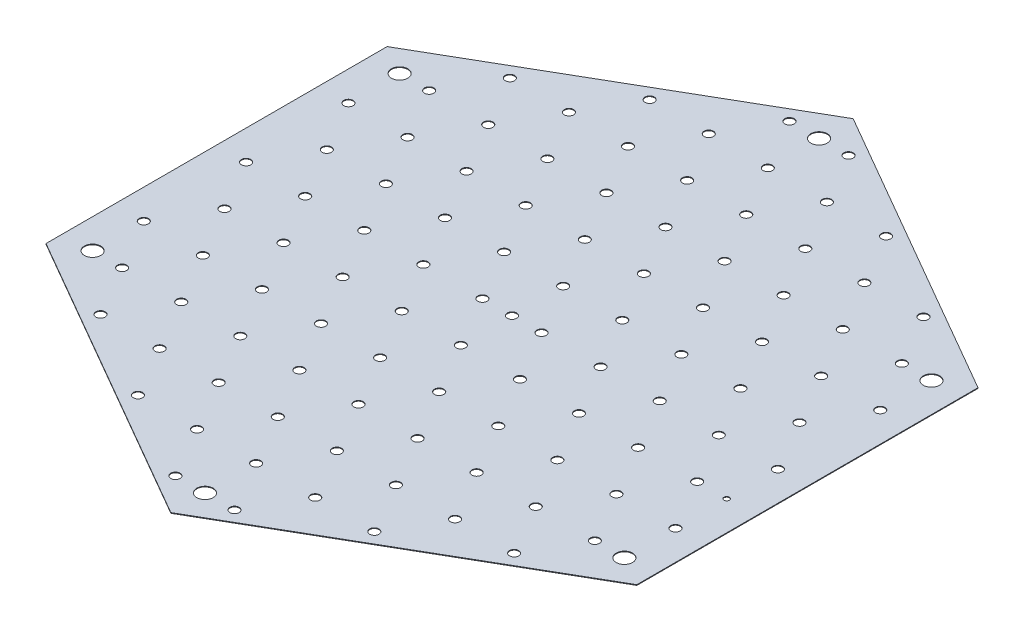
ISO-10303-21;
HEADER;
FILE_DESCRIPTION(('STEP AP214'),'2;1');
FILE_NAME('part.step','',(''),(''),'','','');
FILE_SCHEMA(('AUTOMOTIVE_DESIGN { 1 0 10303 214 1 1 1 1 }'));
ENDSEC;
DATA;
#1=APPLICATION_CONTEXT('core data for automotive mechanical design processes');
#2=APPLICATION_PROTOCOL_DEFINITION('international standard','automotive_design',2000,#1);
#3=PRODUCT_CONTEXT('',#1,'mechanical');
#4=PRODUCT('Part','Part','',(#3));
#5=PRODUCT_RELATED_PRODUCT_CATEGORY('part','',(#4));
#6=PRODUCT_DEFINITION_FORMATION('','',#4);
#7=PRODUCT_DEFINITION_CONTEXT('part definition',#1,'design');
#8=PRODUCT_DEFINITION('design','',#6,#7);
#9=PRODUCT_DEFINITION_SHAPE('','',#8);
#10=(LENGTH_UNIT() NAMED_UNIT(*) SI_UNIT(.MILLI.,.METRE.));
#11=(NAMED_UNIT(*) PLANE_ANGLE_UNIT() SI_UNIT($,.RADIAN.));
#12=(NAMED_UNIT(*) SI_UNIT($,.STERADIAN.) SOLID_ANGLE_UNIT());
#13=UNCERTAINTY_MEASURE_WITH_UNIT(LENGTH_MEASURE(1.E-05),#10,'distance_accuracy_value','');
#14=(GEOMETRIC_REPRESENTATION_CONTEXT(3) GLOBAL_UNCERTAINTY_ASSIGNED_CONTEXT((#13)) GLOBAL_UNIT_ASSIGNED_CONTEXT((#10,
#11,#12)) REPRESENTATION_CONTEXT('',''));
#15=CARTESIAN_POINT('',(0.,0.,0.));
#16=DIRECTION('',(0.,0.,1.));
#17=DIRECTION('',(1.,0.,0.));
#18=AXIS2_PLACEMENT_3D('',#15,#16,#17);
#19=CARTESIAN_POINT('',(54.1265877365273,0.12,-31.25));
#20=DIRECTION('',(-0.5,0.,0.866025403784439));
#21=DIRECTION('',(0.866025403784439,0.,0.5));
#22=AXIS2_PLACEMENT_3D('',#19,#20,#21);
#23=PLANE('',#22);
#24=DIRECTION('',(-0.866025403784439,0.,-0.5));
#25=VECTOR('',#24,1.);
#26=CARTESIAN_POINT('',(54.1265877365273,0.,-31.25));
#27=LINE('',#26,#25);
#28=CARTESIAN_POINT('',(54.1265877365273,0.,-31.25));
#29=VERTEX_POINT('',#28);
#30=CARTESIAN_POINT('',(0.,0.,-62.5));
#31=VERTEX_POINT('',#30);
#32=EDGE_CURVE('E128',#29,#31,#27,.T.);
#33=ORIENTED_EDGE('',*,*,#32,.T.);
#34=DIRECTION('',(0.,-1.,0.));
#35=VECTOR('',#34,1.);
#36=CARTESIAN_POINT('',(0.,0.12,-62.5));
#37=LINE('',#36,#35);
#38=CARTESIAN_POINT('',(0.,0.12,-62.5));
#39=VERTEX_POINT('',#38);
#40=EDGE_CURVE('E13',#39,#31,#37,.T.);
#41=ORIENTED_EDGE('',*,*,#40,.F.);
#42=DIRECTION('',(-0.866025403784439,0.,-0.5));
#43=VECTOR('',#42,1.);
#44=CARTESIAN_POINT('',(54.1265877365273,0.12,-31.25));
#45=LINE('',#44,#43);
#46=CARTESIAN_POINT('',(54.1265877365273,0.12,-31.25));
#47=VERTEX_POINT('',#46);
#48=EDGE_CURVE('E95',#47,#39,#45,.T.);
#49=ORIENTED_EDGE('',*,*,#48,.F.);
#50=DIRECTION('',(0.,-1.,0.));
#51=VECTOR('',#50,1.);
#52=CARTESIAN_POINT('',(54.1265877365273,0.12,-31.25));
#53=LINE('',#52,#51);
#54=EDGE_CURVE('E124',#47,#29,#53,.T.);
#55=ORIENTED_EDGE('',*,*,#54,.T.);
#56=EDGE_LOOP('',(#33,#41,#49,#55));
#57=FACE_BOUND('',#56,.T.);
#58=ADVANCED_FACE('F44',(#57),#23,.F.);
#59=CARTESIAN_POINT('',(0.,0.12,-62.5));
#60=DIRECTION('',(0.5,0.,0.866025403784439));
#61=DIRECTION('',(0.866025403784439,0.,-0.5));
#62=AXIS2_PLACEMENT_3D('',#59,#60,#61);
#63=PLANE('',#62);
#64=DIRECTION('',(0.,-1.,0.));
#65=VECTOR('',#64,1.);
#66=CARTESIAN_POINT('',(-54.1265877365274,0.12,-31.25));
#67=LINE('',#66,#65);
#68=CARTESIAN_POINT('',(-54.1265877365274,0.12,-31.25));
#69=VERTEX_POINT('',#68);
#70=CARTESIAN_POINT('',(-54.1265877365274,0.,-31.25));
#71=VERTEX_POINT('',#70);
#72=EDGE_CURVE('E52',#69,#71,#67,.T.);
#73=ORIENTED_EDGE('',*,*,#72,.F.);
#74=DIRECTION('',(-0.866025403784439,0.,0.5));
#75=VECTOR('',#74,1.);
#76=CARTESIAN_POINT('',(0.,0.12,-62.5));
#77=LINE('',#76,#75);
#78=EDGE_CURVE('E1885',#39,#69,#77,.T.);
#79=ORIENTED_EDGE('',*,*,#78,.F.);
#80=ORIENTED_EDGE('',*,*,#40,.T.);
#81=DIRECTION('',(-0.866025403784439,0.,0.5));
#82=VECTOR('',#81,1.);
#83=CARTESIAN_POINT('',(0.,0.,-62.5));
#84=LINE('',#83,#82);
#85=EDGE_CURVE('E130',#31,#71,#84,.T.);
#86=ORIENTED_EDGE('',*,*,#85,.T.);
#87=EDGE_LOOP('',(#73,#79,#80,#86));
#88=FACE_BOUND('',#87,.T.);
#89=ADVANCED_FACE('F165',(#88),#63,.F.);
#90=CARTESIAN_POINT('',(-54.1265877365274,0.12,-31.25));
#91=DIRECTION('',(1.,0.,0.));
#92=DIRECTION('',(0.,0.,-1.));
#93=AXIS2_PLACEMENT_3D('',#90,#91,#92);
#94=PLANE('',#93);
#95=DIRECTION('',(0.,0.,1.));
#96=VECTOR('',#95,1.);
#97=CARTESIAN_POINT('',(-54.1265877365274,0.,-31.25));
#98=LINE('',#97,#96);
#99=CARTESIAN_POINT('',(-54.1265877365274,0.,31.25));
#100=VERTEX_POINT('',#99);
#101=EDGE_CURVE('E133',#71,#100,#98,.T.);
#102=ORIENTED_EDGE('',*,*,#101,.T.);
#103=DIRECTION('',(0.,-1.,0.));
#104=VECTOR('',#103,1.);
#105=CARTESIAN_POINT('',(-54.1265877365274,0.12,31.25));
#106=LINE('',#105,#104);
#107=CARTESIAN_POINT('',(-54.1265877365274,0.12,31.25));
#108=VERTEX_POINT('',#107);
#109=EDGE_CURVE('E119',#108,#100,#106,.T.);
#110=ORIENTED_EDGE('',*,*,#109,.F.);
#111=DIRECTION('',(0.,0.,1.));
#112=VECTOR('',#111,1.);
#113=CARTESIAN_POINT('',(-54.1265877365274,0.12,-31.25));
#114=LINE('',#113,#112);
#115=EDGE_CURVE('E110',#69,#108,#114,.T.);
#116=ORIENTED_EDGE('',*,*,#115,.F.);
#117=ORIENTED_EDGE('',*,*,#72,.T.);
#118=EDGE_LOOP('',(#102,#110,#116,#117));
#119=FACE_BOUND('',#118,.T.);
#120=ADVANCED_FACE('F144',(#119),#94,.F.);
#121=CARTESIAN_POINT('',(-54.1265877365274,0.12,31.25));
#122=DIRECTION('',(0.5,0.,-0.866025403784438));
#123=DIRECTION('',(-0.866025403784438,0.,-0.5));
#124=AXIS2_PLACEMENT_3D('',#121,#122,#123);
#125=PLANE('',#124);
#126=DIRECTION('',(0.866025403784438,0.,0.5));
#127=VECTOR('',#126,1.);
#128=CARTESIAN_POINT('',(-54.1265877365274,0.,31.25));
#129=LINE('',#128,#127);
#130=CARTESIAN_POINT('',(0.,0.,62.5));
#131=VERTEX_POINT('',#130);
#132=EDGE_CURVE('E118',#100,#131,#129,.T.);
#133=ORIENTED_EDGE('',*,*,#132,.T.);
#134=DIRECTION('',(0.,-1.,0.));
#135=VECTOR('',#134,1.);
#136=CARTESIAN_POINT('',(0.,0.12,62.5));
#137=LINE('',#136,#135);
#138=CARTESIAN_POINT('',(0.,0.12,62.5));
#139=VERTEX_POINT('',#138);
#140=EDGE_CURVE('E115',#139,#131,#137,.T.);
#141=ORIENTED_EDGE('',*,*,#140,.F.);
#142=DIRECTION('',(0.866025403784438,0.,0.5));
#143=VECTOR('',#142,1.);
#144=CARTESIAN_POINT('',(-54.1265877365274,0.12,31.25));
#145=LINE('',#144,#143);
#146=EDGE_CURVE('E103',#108,#139,#145,.T.);
#147=ORIENTED_EDGE('',*,*,#146,.F.);
#148=ORIENTED_EDGE('',*,*,#109,.T.);
#149=EDGE_LOOP('',(#133,#141,#147,#148));
#150=FACE_BOUND('',#149,.T.);
#151=ADVANCED_FACE('F116',(#150),#125,.F.);
#152=CARTESIAN_POINT('',(0.,0.12,62.5));
#153=DIRECTION('',(-0.5,0.,-0.866025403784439));
#154=DIRECTION('',(-0.866025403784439,0.,0.5));
#155=AXIS2_PLACEMENT_3D('',#152,#153,#154);
#156=PLANE('',#155);
#157=DIRECTION('',(0.866025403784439,0.,-0.5));
#158=VECTOR('',#157,1.);
#159=CARTESIAN_POINT('',(0.,0.,62.5));
#160=LINE('',#159,#158);
#161=CARTESIAN_POINT('',(54.1265877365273,0.,31.25));
#162=VERTEX_POINT('',#161);
#163=EDGE_CURVE('E83',#131,#162,#160,.T.);
#164=ORIENTED_EDGE('',*,*,#163,.T.);
#165=DIRECTION('',(0.,-1.,0.));
#166=VECTOR('',#165,1.);
#167=CARTESIAN_POINT('',(54.1265877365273,0.12,31.25));
#168=LINE('',#167,#166);
#169=CARTESIAN_POINT('',(54.1265877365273,0.12,31.25));
#170=VERTEX_POINT('',#169);
#171=EDGE_CURVE('E120',#170,#162,#168,.T.);
#172=ORIENTED_EDGE('',*,*,#171,.F.);
#173=DIRECTION('',(0.866025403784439,0.,-0.5));
#174=VECTOR('',#173,1.);
#175=CARTESIAN_POINT('',(0.,0.12,62.5));
#176=LINE('',#175,#174);
#177=EDGE_CURVE('E108',#139,#170,#176,.T.);
#178=ORIENTED_EDGE('',*,*,#177,.F.);
#179=ORIENTED_EDGE('',*,*,#140,.T.);
#180=EDGE_LOOP('',(#164,#172,#178,#179));
#181=FACE_BOUND('',#180,.T.);
#182=ADVANCED_FACE('F122',(#181),#156,.F.);
#183=CARTESIAN_POINT('',(54.1265877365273,0.12,31.25));
#184=DIRECTION('',(-1.,0.,0.));
#185=DIRECTION('',(0.,0.,1.));
#186=AXIS2_PLACEMENT_3D('',#183,#184,#185);
#187=PLANE('',#186);
#188=ORIENTED_EDGE('',*,*,#54,.F.);
#189=DIRECTION('',(0.,0.,-1.));
#190=VECTOR('',#189,1.);
#191=CARTESIAN_POINT('',(54.1265877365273,0.12,31.25));
#192=LINE('',#191,#190);
#193=EDGE_CURVE('E60',#170,#47,#192,.T.);
#194=ORIENTED_EDGE('',*,*,#193,.F.);
#195=ORIENTED_EDGE('',*,*,#171,.T.);
#196=DIRECTION('',(0.,0.,-1.));
#197=VECTOR('',#196,1.);
#198=CARTESIAN_POINT('',(54.1265877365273,0.,31.25));
#199=LINE('',#198,#197);
#200=EDGE_CURVE('E89',#162,#29,#199,.T.);
#201=ORIENTED_EDGE('',*,*,#200,.T.);
#202=EDGE_LOOP('',(#188,#194,#195,#201));
#203=FACE_BOUND('',#202,.T.);
#204=ADVANCED_FACE('F153',(#203),#187,.F.);
#205=CARTESIAN_POINT('',(0.,0.12,0.));
#206=DIRECTION('',(0.,1.,0.));
#207=DIRECTION('',(0.,0.,1.));
#208=AXIS2_PLACEMENT_3D('',#205,#206,#207);
#209=PLANE('',#208);
#210=CARTESIAN_POINT('',(48.71385,0.12,9.37498480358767));
#211=DIRECTION('',(0.,1.,0.));
#212=DIRECTION('',(0.,0.,1.));
#213=AXIS2_PLACEMENT_3D('',#210,#211,#212);
#214=CIRCLE('',#213,0.499999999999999);
#215=CARTESIAN_POINT('',(48.71385,0.12,9.87498480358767));
#216=VERTEX_POINT('',#215);
#217=EDGE_CURVE('E1263',#216,#216,#214,.T.);
#218=ORIENTED_EDGE('',*,*,#217,.F.);
#219=EDGE_LOOP('',(#218));
#220=FACE_BOUND('',#219,.T.);
#221=CARTESIAN_POINT('',(48.71385,0.12,-18.7499696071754));
#222=DIRECTION('',(0.,1.,0.));
#223=DIRECTION('',(0.,0.,1.));
#224=AXIS2_PLACEMENT_3D('',#221,#222,#223);
#225=CIRCLE('',#224,0.849999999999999);
#226=CARTESIAN_POINT('',(48.71385,0.12,-17.8999696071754));
#227=VERTEX_POINT('',#226);
#228=EDGE_CURVE('E1265',#227,#227,#225,.T.);
#229=ORIENTED_EDGE('',*,*,#228,.F.);
#230=EDGE_LOOP('',(#229));
#231=FACE_BOUND('',#230,.T.);
#232=CARTESIAN_POINT('',(43.3012,0.12,-28.1249544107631));
#233=DIRECTION('',(0.,1.,0.));
#234=DIRECTION('',(0.,0.,1.));
#235=AXIS2_PLACEMENT_3D('',#232,#233,#234);
#236=CIRCLE('',#235,0.85);
#237=CARTESIAN_POINT('',(43.3012,0.12,-27.2749544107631));
#238=VERTEX_POINT('',#237);
#239=EDGE_CURVE('E1271',#238,#238,#236,.T.);
#240=ORIENTED_EDGE('',*,*,#239,.F.);
#241=EDGE_LOOP('',(#240));
#242=FACE_BOUND('',#241,.T.);
#243=CARTESIAN_POINT('',(37.88855,0.12,-37.4999392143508));
#244=DIRECTION('',(0.,1.,0.));
#245=DIRECTION('',(0.,0.,1.));
#246=AXIS2_PLACEMENT_3D('',#243,#244,#245);
#247=CIRCLE('',#246,0.85);
#248=CARTESIAN_POINT('',(37.88855,0.12,-36.6499392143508));
#249=VERTEX_POINT('',#248);
#250=EDGE_CURVE('E1277',#249,#249,#247,.T.);
#251=ORIENTED_EDGE('',*,*,#250,.F.);
#252=EDGE_LOOP('',(#251));
#253=FACE_BOUND('',#252,.T.);
#254=CARTESIAN_POINT('',(-21.6506,0.12,46.8749240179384));
#255=DIRECTION('',(0.,1.,0.));
#256=DIRECTION('',(0.,0.,1.));
#257=AXIS2_PLACEMENT_3D('',#254,#255,#256);
#258=CIRCLE('',#257,0.849999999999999);
#259=CARTESIAN_POINT('',(-21.6506,0.12,47.7249240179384));
#260=VERTEX_POINT('',#259);
#261=EDGE_CURVE('E1283',#260,#260,#258,.T.);
#262=ORIENTED_EDGE('',*,*,#261,.F.);
#263=EDGE_LOOP('',(#262));
#264=FACE_BOUND('',#263,.T.);
#265=CARTESIAN_POINT('',(-5.41265000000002,0.12,56.2499088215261));
#266=DIRECTION('',(0.,1.,0.));
#267=DIRECTION('',(0.,0.,1.));
#268=AXIS2_PLACEMENT_3D('',#265,#266,#267);
#269=CIRCLE('',#268,0.849999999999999);
#270=CARTESIAN_POINT('',(-5.41265000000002,0.12,57.0999088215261));
#271=VERTEX_POINT('',#270);
#272=EDGE_CURVE('E1289',#271,#271,#269,.T.);
#273=ORIENTED_EDGE('',*,*,#272,.F.);
#274=EDGE_LOOP('',(#273));
#275=FACE_BOUND('',#274,.T.);
#276=CARTESIAN_POINT('',(-10.8253,0.12,46.8749240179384));
#277=DIRECTION('',(0.,1.,0.));
#278=DIRECTION('',(0.,0.,1.));
#279=AXIS2_PLACEMENT_3D('',#276,#277,#278);
#280=CIRCLE('',#279,0.849999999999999);
#281=CARTESIAN_POINT('',(-10.8253,0.12,47.7249240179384));
#282=VERTEX_POINT('',#281);
#283=EDGE_CURVE('E1295',#282,#282,#280,.T.);
#284=ORIENTED_EDGE('',*,*,#283,.F.);
#285=EDGE_LOOP('',(#284));
#286=FACE_BOUND('',#285,.T.);
#287=CARTESIAN_POINT('',(-16.23795,0.12,37.4999392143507));
#288=DIRECTION('',(0.,1.,0.));
#289=DIRECTION('',(0.,0.,1.));
#290=AXIS2_PLACEMENT_3D('',#287,#288,#289);
#291=CIRCLE('',#290,0.849999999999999);
#292=CARTESIAN_POINT('',(-16.23795,0.12,38.3499392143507));
#293=VERTEX_POINT('',#292);
#294=EDGE_CURVE('E1301',#293,#293,#291,.T.);
#295=ORIENTED_EDGE('',*,*,#294,.F.);
#296=EDGE_LOOP('',(#295));
#297=FACE_BOUND('',#296,.T.);
#298=CARTESIAN_POINT('',(-48.71385,0.12,-18.7499696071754));
#299=DIRECTION('',(0.,1.,0.));
#300=DIRECTION('',(0.,0.,1.));
#301=AXIS2_PLACEMENT_3D('',#298,#299,#300);
#302=CIRCLE('',#301,0.849999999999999);
#303=CARTESIAN_POINT('',(-48.71385,0.12,-17.8999696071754));
#304=VERTEX_POINT('',#303);
#305=EDGE_CURVE('E1307',#304,#304,#302,.T.);
#306=ORIENTED_EDGE('',*,*,#305,.F.);
#307=EDGE_LOOP('',(#306));
#308=FACE_BOUND('',#307,.T.);
#309=CARTESIAN_POINT('',(5.41264999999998,0.12,56.2499088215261));
#310=DIRECTION('',(0.,1.,0.));
#311=DIRECTION('',(0.,0.,1.));
#312=AXIS2_PLACEMENT_3D('',#309,#310,#311);
#313=CIRCLE('',#312,0.85);
#314=CARTESIAN_POINT('',(5.41264999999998,0.12,57.0999088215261));
#315=VERTEX_POINT('',#314);
#316=EDGE_CURVE('E1313',#315,#315,#313,.T.);
#317=ORIENTED_EDGE('',*,*,#316,.F.);
#318=EDGE_LOOP('',(#317));
#319=FACE_BOUND('',#318,.T.);
#320=CARTESIAN_POINT('',(0.,0.12,46.8749240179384));
#321=DIRECTION('',(0.,1.,0.));
#322=DIRECTION('',(0.,0.,1.));
#323=AXIS2_PLACEMENT_3D('',#320,#321,#322);
#324=CIRCLE('',#323,0.85);
#325=CARTESIAN_POINT('',(0.,0.12,47.7249240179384));
#326=VERTEX_POINT('',#325);
#327=EDGE_CURVE('E1319',#326,#326,#324,.T.);
#328=ORIENTED_EDGE('',*,*,#327,.F.);
#329=EDGE_LOOP('',(#328));
#330=FACE_BOUND('',#329,.T.);
#331=CARTESIAN_POINT('',(-5.41265000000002,0.12,37.4999392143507));
#332=DIRECTION('',(0.,1.,0.));
#333=DIRECTION('',(0.,0.,1.));
#334=AXIS2_PLACEMENT_3D('',#331,#332,#333);
#335=CIRCLE('',#334,0.85);
#336=CARTESIAN_POINT('',(-5.41265000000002,0.12,38.3499392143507));
#337=VERTEX_POINT('',#336);
#338=EDGE_CURVE('E1325',#337,#337,#335,.T.);
#339=ORIENTED_EDGE('',*,*,#338,.F.);
#340=EDGE_LOOP('',(#339));
#341=FACE_BOUND('',#340,.T.);
#342=CARTESIAN_POINT('',(-10.8253,0.12,28.124954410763));
#343=DIRECTION('',(0.,1.,0.));
#344=DIRECTION('',(0.,0.,1.));
#345=AXIS2_PLACEMENT_3D('',#342,#343,#344);
#346=CIRCLE('',#345,0.85);
#347=CARTESIAN_POINT('',(-10.8253,0.12,28.9749544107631));
#348=VERTEX_POINT('',#347);
#349=EDGE_CURVE('E1331',#348,#348,#346,.T.);
#350=ORIENTED_EDGE('',*,*,#349,.F.);
#351=EDGE_LOOP('',(#350));
#352=FACE_BOUND('',#351,.T.);
#353=CARTESIAN_POINT('',(-43.3012,0.12,-28.1249544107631));
#354=DIRECTION('',(0.,1.,0.));
#355=DIRECTION('',(0.,0.,1.));
#356=AXIS2_PLACEMENT_3D('',#353,#354,#355);
#357=CIRCLE('',#356,0.85);
#358=CARTESIAN_POINT('',(-43.3012,0.12,-27.2749544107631));
#359=VERTEX_POINT('',#358);
#360=EDGE_CURVE('E1337',#359,#359,#357,.T.);
#361=ORIENTED_EDGE('',*,*,#360,.F.);
#362=EDGE_LOOP('',(#361));
#363=FACE_BOUND('',#362,.T.);
#364=CARTESIAN_POINT('',(10.8253,0.12,46.8749240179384));
#365=DIRECTION('',(0.,1.,0.));
#366=DIRECTION('',(0.,0.,1.));
#367=AXIS2_PLACEMENT_3D('',#364,#365,#366);
#368=CIRCLE('',#367,0.85);
#369=CARTESIAN_POINT('',(10.8253,0.12,47.7249240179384));
#370=VERTEX_POINT('',#369);
#371=EDGE_CURVE('E1343',#370,#370,#368,.T.);
#372=ORIENTED_EDGE('',*,*,#371,.F.);
#373=EDGE_LOOP('',(#372));
#374=FACE_BOUND('',#373,.T.);
#375=CARTESIAN_POINT('',(5.41264999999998,0.12,37.4999392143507));
#376=DIRECTION('',(0.,1.,0.));
#377=DIRECTION('',(0.,0.,1.));
#378=AXIS2_PLACEMENT_3D('',#375,#376,#377);
#379=CIRCLE('',#378,0.85);
#380=CARTESIAN_POINT('',(5.41264999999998,0.12,38.3499392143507));
#381=VERTEX_POINT('',#380);
#382=EDGE_CURVE('E1349',#381,#381,#379,.T.);
#383=ORIENTED_EDGE('',*,*,#382,.F.);
#384=EDGE_LOOP('',(#383));
#385=FACE_BOUND('',#384,.T.);
#386=CARTESIAN_POINT('',(0.,0.12,28.124954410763));
#387=DIRECTION('',(0.,1.,0.));
#388=DIRECTION('',(0.,0.,1.));
#389=AXIS2_PLACEMENT_3D('',#386,#387,#388);
#390=CIRCLE('',#389,0.85);
#391=CARTESIAN_POINT('',(0.,0.12,28.9749544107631));
#392=VERTEX_POINT('',#391);
#393=EDGE_CURVE('E1355',#392,#392,#390,.T.);
#394=ORIENTED_EDGE('',*,*,#393,.F.);
#395=EDGE_LOOP('',(#394));
#396=FACE_BOUND('',#395,.T.);
#397=CARTESIAN_POINT('',(-5.41265000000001,0.12,18.7499696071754));
#398=DIRECTION('',(0.,1.,0.));
#399=DIRECTION('',(0.,0.,1.));
#400=AXIS2_PLACEMENT_3D('',#397,#398,#399);
#401=CIRCLE('',#400,0.85);
#402=CARTESIAN_POINT('',(-5.41265000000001,0.12,19.5999696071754));
#403=VERTEX_POINT('',#402);
#404=EDGE_CURVE('E1361',#403,#403,#401,.T.);
#405=ORIENTED_EDGE('',*,*,#404,.F.);
#406=EDGE_LOOP('',(#405));
#407=FACE_BOUND('',#406,.T.);
#408=CARTESIAN_POINT('',(-37.88855,0.12,-37.4999392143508));
#409=DIRECTION('',(0.,1.,0.));
#410=DIRECTION('',(0.,0.,1.));
#411=AXIS2_PLACEMENT_3D('',#408,#409,#410);
#412=CIRCLE('',#411,0.85);
#413=CARTESIAN_POINT('',(-37.88855,0.12,-36.6499392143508));
#414=VERTEX_POINT('',#413);
#415=EDGE_CURVE('E1367',#414,#414,#412,.T.);
#416=ORIENTED_EDGE('',*,*,#415,.F.);
#417=EDGE_LOOP('',(#416));
#418=FACE_BOUND('',#417,.T.);
#419=CARTESIAN_POINT('',(21.6506,0.12,46.8749240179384));
#420=DIRECTION('',(0.,1.,0.));
#421=DIRECTION('',(0.,0.,1.));
#422=AXIS2_PLACEMENT_3D('',#419,#420,#421);
#423=CIRCLE('',#422,0.85);
#424=CARTESIAN_POINT('',(21.6506,0.12,47.7249240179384));
#425=VERTEX_POINT('',#424);
#426=EDGE_CURVE('E1373',#425,#425,#423,.T.);
#427=ORIENTED_EDGE('',*,*,#426,.F.);
#428=EDGE_LOOP('',(#427));
#429=FACE_BOUND('',#428,.T.);
#430=CARTESIAN_POINT('',(16.23795,0.12,37.4999392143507));
#431=DIRECTION('',(0.,1.,0.));
#432=DIRECTION('',(0.,0.,1.));
#433=AXIS2_PLACEMENT_3D('',#430,#431,#432);
#434=CIRCLE('',#433,0.85);
#435=CARTESIAN_POINT('',(16.23795,0.12,38.3499392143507));
#436=VERTEX_POINT('',#435);
#437=EDGE_CURVE('E1379',#436,#436,#434,.T.);
#438=ORIENTED_EDGE('',*,*,#437,.F.);
#439=EDGE_LOOP('',(#438));
#440=FACE_BOUND('',#439,.T.);
#441=CARTESIAN_POINT('',(10.8253,0.12,28.124954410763));
#442=DIRECTION('',(0.,1.,0.));
#443=DIRECTION('',(0.,0.,1.));
#444=AXIS2_PLACEMENT_3D('',#441,#442,#443);
#445=CIRCLE('',#444,0.85);
#446=CARTESIAN_POINT('',(10.8253,0.12,28.9749544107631));
#447=VERTEX_POINT('',#446);
#448=EDGE_CURVE('E1385',#447,#447,#445,.T.);
#449=ORIENTED_EDGE('',*,*,#448,.F.);
#450=EDGE_LOOP('',(#449));
#451=FACE_BOUND('',#450,.T.);
#452=CARTESIAN_POINT('',(5.41264999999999,0.12,18.7499696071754));
#453=DIRECTION('',(0.,1.,0.));
#454=DIRECTION('',(0.,0.,1.));
#455=AXIS2_PLACEMENT_3D('',#452,#453,#454);
#456=CIRCLE('',#455,0.85);
#457=CARTESIAN_POINT('',(5.41264999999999,0.12,19.5999696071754));
#458=VERTEX_POINT('',#457);
#459=EDGE_CURVE('E1391',#458,#458,#456,.T.);
#460=ORIENTED_EDGE('',*,*,#459,.F.);
#461=EDGE_LOOP('',(#460));
#462=FACE_BOUND('',#461,.T.);
#463=CARTESIAN_POINT('',(0.,0.12,9.37498480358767));
#464=DIRECTION('',(0.,1.,0.));
#465=DIRECTION('',(0.,0.,1.));
#466=AXIS2_PLACEMENT_3D('',#463,#464,#465);
#467=CIRCLE('',#466,0.85);
#468=CARTESIAN_POINT('',(0.,0.12,10.2249848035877));
#469=VERTEX_POINT('',#468);
#470=EDGE_CURVE('E1397',#469,#469,#467,.T.);
#471=ORIENTED_EDGE('',*,*,#470,.F.);
#472=EDGE_LOOP('',(#471));
#473=FACE_BOUND('',#472,.T.);
#474=CARTESIAN_POINT('',(-27.06325,0.12,-37.4999392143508));
#475=DIRECTION('',(0.,1.,0.));
#476=DIRECTION('',(0.,0.,1.));
#477=AXIS2_PLACEMENT_3D('',#474,#475,#476);
#478=CIRCLE('',#477,0.849999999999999);
#479=CARTESIAN_POINT('',(-27.06325,0.12,-36.6499392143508));
#480=VERTEX_POINT('',#479);
#481=EDGE_CURVE('E1403',#480,#480,#478,.T.);
#482=ORIENTED_EDGE('',*,*,#481,.F.);
#483=EDGE_LOOP('',(#482));
#484=FACE_BOUND('',#483,.T.);
#485=CARTESIAN_POINT('',(-32.4759,0.12,-28.1249544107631));
#486=DIRECTION('',(0.,1.,0.));
#487=DIRECTION('',(0.,0.,1.));
#488=AXIS2_PLACEMENT_3D('',#485,#486,#487);
#489=CIRCLE('',#488,0.849999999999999);
#490=CARTESIAN_POINT('',(-32.4759,0.12,-27.2749544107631));
#491=VERTEX_POINT('',#490);
#492=EDGE_CURVE('E1409',#491,#491,#489,.T.);
#493=ORIENTED_EDGE('',*,*,#492,.F.);
#494=EDGE_LOOP('',(#493));
#495=FACE_BOUND('',#494,.T.);
#496=CARTESIAN_POINT('',(-37.88855,0.12,-18.7499696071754));
#497=DIRECTION('',(0.,1.,0.));
#498=DIRECTION('',(0.,0.,1.));
#499=AXIS2_PLACEMENT_3D('',#496,#497,#498);
#500=CIRCLE('',#499,0.849999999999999);
#501=CARTESIAN_POINT('',(-37.88855,0.12,-17.8999696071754));
#502=VERTEX_POINT('',#501);
#503=EDGE_CURVE('E1415',#502,#502,#500,.T.);
#504=ORIENTED_EDGE('',*,*,#503,.F.);
#505=EDGE_LOOP('',(#504));
#506=FACE_BOUND('',#505,.T.);
#507=CARTESIAN_POINT('',(-43.3012,0.12,-9.3749848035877));
#508=DIRECTION('',(0.,1.,0.));
#509=DIRECTION('',(0.,0.,1.));
#510=AXIS2_PLACEMENT_3D('',#507,#508,#509);
#511=CIRCLE('',#510,0.849999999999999);
#512=CARTESIAN_POINT('',(-43.3012,0.12,-8.5249848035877));
#513=VERTEX_POINT('',#512);
#514=EDGE_CURVE('E1421',#513,#513,#511,.T.);
#515=ORIENTED_EDGE('',*,*,#514,.F.);
#516=EDGE_LOOP('',(#515));
#517=FACE_BOUND('',#516,.T.);
#518=CARTESIAN_POINT('',(-21.6506,0.12,-28.1249544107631));
#519=DIRECTION('',(0.,1.,0.));
#520=DIRECTION('',(0.,0.,1.));
#521=AXIS2_PLACEMENT_3D('',#518,#519,#520);
#522=CIRCLE('',#521,0.849999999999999);
#523=CARTESIAN_POINT('',(-21.6506,0.12,-27.2749544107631));
#524=VERTEX_POINT('',#523);
#525=EDGE_CURVE('E1427',#524,#524,#522,.T.);
#526=ORIENTED_EDGE('',*,*,#525,.F.);
#527=EDGE_LOOP('',(#526));
#528=FACE_BOUND('',#527,.T.);
#529=CARTESIAN_POINT('',(-27.06325,0.12,-18.7499696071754));
#530=DIRECTION('',(0.,1.,0.));
#531=DIRECTION('',(0.,0.,1.));
#532=AXIS2_PLACEMENT_3D('',#529,#530,#531);
#533=CIRCLE('',#532,0.849999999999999);
#534=CARTESIAN_POINT('',(-27.06325,0.12,-17.8999696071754));
#535=VERTEX_POINT('',#534);
#536=EDGE_CURVE('E1433',#535,#535,#533,.T.);
#537=ORIENTED_EDGE('',*,*,#536,.F.);
#538=EDGE_LOOP('',(#537));
#539=FACE_BOUND('',#538,.T.);
#540=CARTESIAN_POINT('',(-32.4759,0.12,-9.3749848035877));
#541=DIRECTION('',(0.,1.,0.));
#542=DIRECTION('',(0.,0.,1.));
#543=AXIS2_PLACEMENT_3D('',#540,#541,#542);
#544=CIRCLE('',#543,0.849999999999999);
#545=CARTESIAN_POINT('',(-32.4759,0.12,-8.5249848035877));
#546=VERTEX_POINT('',#545);
#547=EDGE_CURVE('E1439',#546,#546,#544,.T.);
#548=ORIENTED_EDGE('',*,*,#547,.F.);
#549=EDGE_LOOP('',(#548));
#550=FACE_BOUND('',#549,.T.);
#551=CARTESIAN_POINT('',(-48.71385,0.12,18.7499696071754));
#552=DIRECTION('',(0.,1.,0.));
#553=DIRECTION('',(0.,0.,1.));
#554=AXIS2_PLACEMENT_3D('',#551,#552,#553);
#555=CIRCLE('',#554,0.849999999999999);
#556=CARTESIAN_POINT('',(-48.71385,0.12,19.5999696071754));
#557=VERTEX_POINT('',#556);
#558=EDGE_CURVE('E1445',#557,#557,#555,.T.);
#559=ORIENTED_EDGE('',*,*,#558,.F.);
#560=EDGE_LOOP('',(#559));
#561=FACE_BOUND('',#560,.T.);
#562=CARTESIAN_POINT('',(-43.3012,0.12,9.37498480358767));
#563=DIRECTION('',(0.,1.,0.));
#564=DIRECTION('',(0.,0.,1.));
#565=AXIS2_PLACEMENT_3D('',#562,#563,#564);
#566=CIRCLE('',#565,0.849999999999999);
#567=CARTESIAN_POINT('',(-43.3012,0.12,10.2249848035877));
#568=VERTEX_POINT('',#567);
#569=EDGE_CURVE('E1451',#568,#568,#566,.T.);
#570=ORIENTED_EDGE('',*,*,#569,.F.);
#571=EDGE_LOOP('',(#570));
#572=FACE_BOUND('',#571,.T.);
#573=CARTESIAN_POINT('',(-43.3012,0.12,28.124954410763));
#574=DIRECTION('',(0.,1.,0.));
#575=DIRECTION('',(0.,0.,1.));
#576=AXIS2_PLACEMENT_3D('',#573,#574,#575);
#577=CIRCLE('',#576,0.85);
#578=CARTESIAN_POINT('',(-43.3012,0.12,28.9749544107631));
#579=VERTEX_POINT('',#578);
#580=EDGE_CURVE('E1457',#579,#579,#577,.T.);
#581=ORIENTED_EDGE('',*,*,#580,.F.);
#582=EDGE_LOOP('',(#581));
#583=FACE_BOUND('',#582,.T.);
#584=CARTESIAN_POINT('',(-37.88855,0.12,18.7499696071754));
#585=DIRECTION('',(0.,1.,0.));
#586=DIRECTION('',(0.,0.,1.));
#587=AXIS2_PLACEMENT_3D('',#584,#585,#586);
#588=CIRCLE('',#587,0.85);
#589=CARTESIAN_POINT('',(-37.88855,0.12,19.5999696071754));
#590=VERTEX_POINT('',#589);
#591=EDGE_CURVE('E1463',#590,#590,#588,.T.);
#592=ORIENTED_EDGE('',*,*,#591,.F.);
#593=EDGE_LOOP('',(#592));
#594=FACE_BOUND('',#593,.T.);
#595=CARTESIAN_POINT('',(-32.4759,0.12,9.37498480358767));
#596=DIRECTION('',(0.,1.,0.));
#597=DIRECTION('',(0.,0.,1.));
#598=AXIS2_PLACEMENT_3D('',#595,#596,#597);
#599=CIRCLE('',#598,0.85);
#600=CARTESIAN_POINT('',(-32.4759,0.12,10.2249848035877));
#601=VERTEX_POINT('',#600);
#602=EDGE_CURVE('E1469',#601,#601,#599,.T.);
#603=ORIENTED_EDGE('',*,*,#602,.F.);
#604=EDGE_LOOP('',(#603));
#605=FACE_BOUND('',#604,.T.);
#606=CARTESIAN_POINT('',(-16.23795,0.12,-18.7499696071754));
#607=DIRECTION('',(0.,1.,0.));
#608=DIRECTION('',(0.,0.,1.));
#609=AXIS2_PLACEMENT_3D('',#606,#607,#608);
#610=CIRCLE('',#609,0.85);
#611=CARTESIAN_POINT('',(-16.23795,0.12,-17.8999696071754));
#612=VERTEX_POINT('',#611);
#613=EDGE_CURVE('E1475',#612,#612,#610,.T.);
#614=ORIENTED_EDGE('',*,*,#613,.F.);
#615=EDGE_LOOP('',(#614));
#616=FACE_BOUND('',#615,.T.);
#617=CARTESIAN_POINT('',(-21.6506,0.12,-9.3749848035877));
#618=DIRECTION('',(0.,1.,0.));
#619=DIRECTION('',(0.,0.,1.));
#620=AXIS2_PLACEMENT_3D('',#617,#618,#619);
#621=CIRCLE('',#620,0.85);
#622=CARTESIAN_POINT('',(-21.6506,0.12,-8.5249848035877));
#623=VERTEX_POINT('',#622);
#624=EDGE_CURVE('E1481',#623,#623,#621,.T.);
#625=ORIENTED_EDGE('',*,*,#624,.F.);
#626=EDGE_LOOP('',(#625));
#627=FACE_BOUND('',#626,.T.);
#628=CARTESIAN_POINT('',(-37.88855,0.12,37.4999392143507));
#629=DIRECTION('',(0.,1.,0.));
#630=DIRECTION('',(0.,0.,1.));
#631=AXIS2_PLACEMENT_3D('',#628,#629,#630);
#632=CIRCLE('',#631,0.85);
#633=CARTESIAN_POINT('',(-37.88855,0.12,38.3499392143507));
#634=VERTEX_POINT('',#633);
#635=EDGE_CURVE('E1487',#634,#634,#632,.T.);
#636=ORIENTED_EDGE('',*,*,#635,.F.);
#637=EDGE_LOOP('',(#636));
#638=FACE_BOUND('',#637,.T.);
#639=CARTESIAN_POINT('',(-32.4759,0.12,28.124954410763));
#640=DIRECTION('',(0.,1.,0.));
#641=DIRECTION('',(0.,0.,1.));
#642=AXIS2_PLACEMENT_3D('',#639,#640,#641);
#643=CIRCLE('',#642,0.85);
#644=CARTESIAN_POINT('',(-32.4759,0.12,28.9749544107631));
#645=VERTEX_POINT('',#644);
#646=EDGE_CURVE('E1493',#645,#645,#643,.T.);
#647=ORIENTED_EDGE('',*,*,#646,.F.);
#648=EDGE_LOOP('',(#647));
#649=FACE_BOUND('',#648,.T.);
#650=CARTESIAN_POINT('',(-27.06325,0.12,18.7499696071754));
#651=DIRECTION('',(0.,1.,0.));
#652=DIRECTION('',(0.,0.,1.));
#653=AXIS2_PLACEMENT_3D('',#650,#651,#652);
#654=CIRCLE('',#653,0.85);
#655=CARTESIAN_POINT('',(-27.06325,0.12,19.5999696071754));
#656=VERTEX_POINT('',#655);
#657=EDGE_CURVE('E1499',#656,#656,#654,.T.);
#658=ORIENTED_EDGE('',*,*,#657,.F.);
#659=EDGE_LOOP('',(#658));
#660=FACE_BOUND('',#659,.T.);
#661=CARTESIAN_POINT('',(-21.6506,0.12,9.37498480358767));
#662=DIRECTION('',(0.,1.,0.));
#663=DIRECTION('',(0.,0.,1.));
#664=AXIS2_PLACEMENT_3D('',#661,#662,#663);
#665=CIRCLE('',#664,0.85);
#666=CARTESIAN_POINT('',(-21.6506,0.12,10.2249848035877));
#667=VERTEX_POINT('',#666);
#668=EDGE_CURVE('E1505',#667,#667,#665,.T.);
#669=ORIENTED_EDGE('',*,*,#668,.F.);
#670=EDGE_LOOP('',(#669));
#671=FACE_BOUND('',#670,.T.);
#672=CARTESIAN_POINT('',(-10.8253,0.12,-9.3749848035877));
#673=DIRECTION('',(0.,1.,0.));
#674=DIRECTION('',(0.,0.,1.));
#675=AXIS2_PLACEMENT_3D('',#672,#673,#674);
#676=CIRCLE('',#675,0.85);
#677=CARTESIAN_POINT('',(-10.8253,0.12,-8.5249848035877));
#678=VERTEX_POINT('',#677);
#679=EDGE_CURVE('E1511',#678,#678,#676,.T.);
#680=ORIENTED_EDGE('',*,*,#679,.F.);
#681=EDGE_LOOP('',(#680));
#682=FACE_BOUND('',#681,.T.);
#683=CARTESIAN_POINT('',(-27.06325,0.12,37.4999392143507));
#684=DIRECTION('',(0.,1.,0.));
#685=DIRECTION('',(0.,0.,1.));
#686=AXIS2_PLACEMENT_3D('',#683,#684,#685);
#687=CIRCLE('',#686,0.85);
#688=CARTESIAN_POINT('',(-27.06325,0.12,38.3499392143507));
#689=VERTEX_POINT('',#688);
#690=EDGE_CURVE('E1517',#689,#689,#687,.T.);
#691=ORIENTED_EDGE('',*,*,#690,.F.);
#692=EDGE_LOOP('',(#691));
#693=FACE_BOUND('',#692,.T.);
#694=CARTESIAN_POINT('',(-21.6506,0.12,28.124954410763));
#695=DIRECTION('',(0.,1.,0.));
#696=DIRECTION('',(0.,0.,1.));
#697=AXIS2_PLACEMENT_3D('',#694,#695,#696);
#698=CIRCLE('',#697,0.85);
#699=CARTESIAN_POINT('',(-21.6506,0.12,28.9749544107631));
#700=VERTEX_POINT('',#699);
#701=EDGE_CURVE('E1523',#700,#700,#698,.T.);
#702=ORIENTED_EDGE('',*,*,#701,.F.);
#703=EDGE_LOOP('',(#702));
#704=FACE_BOUND('',#703,.T.);
#705=CARTESIAN_POINT('',(-16.23795,0.12,18.7499696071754));
#706=DIRECTION('',(0.,1.,0.));
#707=DIRECTION('',(0.,0.,1.));
#708=AXIS2_PLACEMENT_3D('',#705,#706,#707);
#709=CIRCLE('',#708,0.85);
#710=CARTESIAN_POINT('',(-16.23795,0.12,19.5999696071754));
#711=VERTEX_POINT('',#710);
#712=EDGE_CURVE('E1529',#711,#711,#709,.T.);
#713=ORIENTED_EDGE('',*,*,#712,.F.);
#714=EDGE_LOOP('',(#713));
#715=FACE_BOUND('',#714,.T.);
#716=CARTESIAN_POINT('',(-10.8253,0.12,9.37498480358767));
#717=DIRECTION('',(0.,1.,0.));
#718=DIRECTION('',(0.,0.,1.));
#719=AXIS2_PLACEMENT_3D('',#716,#717,#718);
#720=CIRCLE('',#719,0.85);
#721=CARTESIAN_POINT('',(-10.8253,0.12,10.2249848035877));
#722=VERTEX_POINT('',#721);
#723=EDGE_CURVE('E1535',#722,#722,#720,.T.);
#724=ORIENTED_EDGE('',*,*,#723,.F.);
#725=EDGE_LOOP('',(#724));
#726=FACE_BOUND('',#725,.T.);
#727=CARTESIAN_POINT('',(21.6506,0.12,-46.8749240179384));
#728=DIRECTION('',(0.,1.,0.));
#729=DIRECTION('',(0.,0.,1.));
#730=AXIS2_PLACEMENT_3D('',#727,#728,#729);
#731=CIRCLE('',#730,0.849999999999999);
#732=CARTESIAN_POINT('',(21.6506,0.12,-46.0249240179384));
#733=VERTEX_POINT('',#732);
#734=EDGE_CURVE('E1541',#733,#733,#731,.T.);
#735=ORIENTED_EDGE('',*,*,#734,.F.);
#736=EDGE_LOOP('',(#735));
#737=FACE_BOUND('',#736,.T.);
#738=CARTESIAN_POINT('',(27.06325,0.12,-37.4999392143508));
#739=DIRECTION('',(0.,1.,0.));
#740=DIRECTION('',(0.,0.,1.));
#741=AXIS2_PLACEMENT_3D('',#738,#739,#740);
#742=CIRCLE('',#741,0.849999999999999);
#743=CARTESIAN_POINT('',(27.06325,0.12,-36.6499392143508));
#744=VERTEX_POINT('',#743);
#745=EDGE_CURVE('E1547',#744,#744,#742,.T.);
#746=ORIENTED_EDGE('',*,*,#745,.F.);
#747=EDGE_LOOP('',(#746));
#748=FACE_BOUND('',#747,.T.);
#749=CARTESIAN_POINT('',(32.4759,0.12,-28.1249544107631));
#750=DIRECTION('',(0.,1.,0.));
#751=DIRECTION('',(0.,0.,1.));
#752=AXIS2_PLACEMENT_3D('',#749,#750,#751);
#753=CIRCLE('',#752,0.849999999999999);
#754=CARTESIAN_POINT('',(32.4759,0.12,-27.2749544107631));
#755=VERTEX_POINT('',#754);
#756=EDGE_CURVE('E1553',#755,#755,#753,.T.);
#757=ORIENTED_EDGE('',*,*,#756,.F.);
#758=EDGE_LOOP('',(#757));
#759=FACE_BOUND('',#758,.T.);
#760=CARTESIAN_POINT('',(37.88855,0.12,-18.7499696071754));
#761=DIRECTION('',(0.,1.,0.));
#762=DIRECTION('',(0.,0.,1.));
#763=AXIS2_PLACEMENT_3D('',#760,#761,#762);
#764=CIRCLE('',#763,0.849999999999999);
#765=CARTESIAN_POINT('',(37.88855,0.12,-17.8999696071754));
#766=VERTEX_POINT('',#765);
#767=EDGE_CURVE('E1559',#766,#766,#764,.T.);
#768=ORIENTED_EDGE('',*,*,#767,.F.);
#769=EDGE_LOOP('',(#768));
#770=FACE_BOUND('',#769,.T.);
#771=CARTESIAN_POINT('',(43.3012,0.12,-9.3749848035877));
#772=DIRECTION('',(0.,1.,0.));
#773=DIRECTION('',(0.,0.,1.));
#774=AXIS2_PLACEMENT_3D('',#771,#772,#773);
#775=CIRCLE('',#774,0.849999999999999);
#776=CARTESIAN_POINT('',(43.3012,0.12,-8.5249848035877));
#777=VERTEX_POINT('',#776);
#778=EDGE_CURVE('E1565',#777,#777,#775,.T.);
#779=ORIENTED_EDGE('',*,*,#778,.F.);
#780=EDGE_LOOP('',(#779));
#781=FACE_BOUND('',#780,.T.);
#782=CARTESIAN_POINT('',(48.71385,0.12,18.7499696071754));
#783=DIRECTION('',(0.,1.,0.));
#784=DIRECTION('',(0.,0.,1.));
#785=AXIS2_PLACEMENT_3D('',#782,#783,#784);
#786=CIRCLE('',#785,0.849999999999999);
#787=CARTESIAN_POINT('',(48.71385,0.12,19.5999696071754));
#788=VERTEX_POINT('',#787);
#789=EDGE_CURVE('E1571',#788,#788,#786,.T.);
#790=ORIENTED_EDGE('',*,*,#789,.F.);
#791=EDGE_LOOP('',(#790));
#792=FACE_BOUND('',#791,.T.);
#793=CARTESIAN_POINT('',(43.3012,0.12,9.37498480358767));
#794=DIRECTION('',(0.,1.,0.));
#795=DIRECTION('',(0.,0.,1.));
#796=AXIS2_PLACEMENT_3D('',#793,#794,#795);
#797=CIRCLE('',#796,0.849999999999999);
#798=CARTESIAN_POINT('',(43.3012,0.12,10.2249848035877));
#799=VERTEX_POINT('',#798);
#800=EDGE_CURVE('E1577',#799,#799,#797,.T.);
#801=ORIENTED_EDGE('',*,*,#800,.F.);
#802=EDGE_LOOP('',(#801));
#803=FACE_BOUND('',#802,.T.);
#804=CARTESIAN_POINT('',(5.41265000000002,0.12,-56.2499088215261));
#805=DIRECTION('',(0.,1.,0.));
#806=DIRECTION('',(0.,0.,1.));
#807=AXIS2_PLACEMENT_3D('',#804,#805,#806);
#808=CIRCLE('',#807,0.849999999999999);
#809=CARTESIAN_POINT('',(5.41265000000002,0.12,-55.3999088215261));
#810=VERTEX_POINT('',#809);
#811=EDGE_CURVE('E1583',#810,#810,#808,.T.);
#812=ORIENTED_EDGE('',*,*,#811,.F.);
#813=EDGE_LOOP('',(#812));
#814=FACE_BOUND('',#813,.T.);
#815=CARTESIAN_POINT('',(10.8253,0.12,-46.8749240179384));
#816=DIRECTION('',(0.,1.,0.));
#817=DIRECTION('',(0.,0.,1.));
#818=AXIS2_PLACEMENT_3D('',#815,#816,#817);
#819=CIRCLE('',#818,0.849999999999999);
#820=CARTESIAN_POINT('',(10.8253,0.12,-46.0249240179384));
#821=VERTEX_POINT('',#820);
#822=EDGE_CURVE('E1589',#821,#821,#819,.T.);
#823=ORIENTED_EDGE('',*,*,#822,.F.);
#824=EDGE_LOOP('',(#823));
#825=FACE_BOUND('',#824,.T.);
#826=CARTESIAN_POINT('',(16.23795,0.12,-37.4999392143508));
#827=DIRECTION('',(0.,1.,0.));
#828=DIRECTION('',(0.,0.,1.));
#829=AXIS2_PLACEMENT_3D('',#826,#827,#828);
#830=CIRCLE('',#829,0.849999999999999);
#831=CARTESIAN_POINT('',(16.23795,0.12,-36.6499392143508));
#832=VERTEX_POINT('',#831);
#833=EDGE_CURVE('E1595',#832,#832,#830,.T.);
#834=ORIENTED_EDGE('',*,*,#833,.F.);
#835=EDGE_LOOP('',(#834));
#836=FACE_BOUND('',#835,.T.);
#837=CARTESIAN_POINT('',(21.6506,0.12,-28.1249544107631));
#838=DIRECTION('',(0.,1.,0.));
#839=DIRECTION('',(0.,0.,1.));
#840=AXIS2_PLACEMENT_3D('',#837,#838,#839);
#841=CIRCLE('',#840,0.849999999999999);
#842=CARTESIAN_POINT('',(21.6506,0.12,-27.2749544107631));
#843=VERTEX_POINT('',#842);
#844=EDGE_CURVE('E1601',#843,#843,#841,.T.);
#845=ORIENTED_EDGE('',*,*,#844,.F.);
#846=EDGE_LOOP('',(#845));
#847=FACE_BOUND('',#846,.T.);
#848=CARTESIAN_POINT('',(27.06325,0.12,-18.7499696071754));
#849=DIRECTION('',(0.,1.,0.));
#850=DIRECTION('',(0.,0.,1.));
#851=AXIS2_PLACEMENT_3D('',#848,#849,#850);
#852=CIRCLE('',#851,0.849999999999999);
#853=CARTESIAN_POINT('',(27.06325,0.12,-17.8999696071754));
#854=VERTEX_POINT('',#853);
#855=EDGE_CURVE('E1607',#854,#854,#852,.T.);
#856=ORIENTED_EDGE('',*,*,#855,.F.);
#857=EDGE_LOOP('',(#856));
#858=FACE_BOUND('',#857,.T.);
#859=CARTESIAN_POINT('',(32.4759,0.12,-9.3749848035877));
#860=DIRECTION('',(0.,1.,0.));
#861=DIRECTION('',(0.,0.,1.));
#862=AXIS2_PLACEMENT_3D('',#859,#860,#861);
#863=CIRCLE('',#862,0.849999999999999);
#864=CARTESIAN_POINT('',(32.4759,0.12,-8.5249848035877));
#865=VERTEX_POINT('',#864);
#866=EDGE_CURVE('E1613',#865,#865,#863,.T.);
#867=ORIENTED_EDGE('',*,*,#866,.F.);
#868=EDGE_LOOP('',(#867));
#869=FACE_BOUND('',#868,.T.);
#870=CARTESIAN_POINT('',(43.3012,0.12,28.124954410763));
#871=DIRECTION('',(0.,1.,0.));
#872=DIRECTION('',(0.,0.,1.));
#873=AXIS2_PLACEMENT_3D('',#870,#871,#872);
#874=CIRCLE('',#873,0.85);
#875=CARTESIAN_POINT('',(43.3012,0.12,28.9749544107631));
#876=VERTEX_POINT('',#875);
#877=EDGE_CURVE('E1619',#876,#876,#874,.T.);
#878=ORIENTED_EDGE('',*,*,#877,.F.);
#879=EDGE_LOOP('',(#878));
#880=FACE_BOUND('',#879,.T.);
#881=CARTESIAN_POINT('',(37.88855,0.12,18.7499696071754));
#882=DIRECTION('',(0.,1.,0.));
#883=DIRECTION('',(0.,0.,1.));
#884=AXIS2_PLACEMENT_3D('',#881,#882,#883);
#885=CIRCLE('',#884,0.85);
#886=CARTESIAN_POINT('',(37.88855,0.12,19.5999696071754));
#887=VERTEX_POINT('',#886);
#888=EDGE_CURVE('E1625',#887,#887,#885,.T.);
#889=ORIENTED_EDGE('',*,*,#888,.F.);
#890=EDGE_LOOP('',(#889));
#891=FACE_BOUND('',#890,.T.);
#892=CARTESIAN_POINT('',(32.4759,0.12,9.37498480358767));
#893=DIRECTION('',(0.,1.,0.));
#894=DIRECTION('',(0.,0.,1.));
#895=AXIS2_PLACEMENT_3D('',#892,#893,#894);
#896=CIRCLE('',#895,0.85);
#897=CARTESIAN_POINT('',(32.4759,0.12,10.2249848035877));
#898=VERTEX_POINT('',#897);
#899=EDGE_CURVE('E1631',#898,#898,#896,.T.);
#900=ORIENTED_EDGE('',*,*,#899,.F.);
#901=EDGE_LOOP('',(#900));
#902=FACE_BOUND('',#901,.T.);
#903=CARTESIAN_POINT('',(-5.41264999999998,0.12,-56.2499088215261));
#904=DIRECTION('',(0.,1.,0.));
#905=DIRECTION('',(0.,0.,1.));
#906=AXIS2_PLACEMENT_3D('',#903,#904,#905);
#907=CIRCLE('',#906,0.85);
#908=CARTESIAN_POINT('',(-5.41264999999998,0.12,-55.3999088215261));
#909=VERTEX_POINT('',#908);
#910=EDGE_CURVE('E1637',#909,#909,#907,.T.);
#911=ORIENTED_EDGE('',*,*,#910,.F.);
#912=EDGE_LOOP('',(#911));
#913=FACE_BOUND('',#912,.T.);
#914=CARTESIAN_POINT('',(0.,0.12,-46.8749240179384));
#915=DIRECTION('',(0.,1.,0.));
#916=DIRECTION('',(0.,0.,1.));
#917=AXIS2_PLACEMENT_3D('',#914,#915,#916);
#918=CIRCLE('',#917,0.85);
#919=CARTESIAN_POINT('',(0.,0.12,-46.0249240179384));
#920=VERTEX_POINT('',#919);
#921=EDGE_CURVE('E1643',#920,#920,#918,.T.);
#922=ORIENTED_EDGE('',*,*,#921,.F.);
#923=EDGE_LOOP('',(#922));
#924=FACE_BOUND('',#923,.T.);
#925=CARTESIAN_POINT('',(5.41265000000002,0.12,-37.4999392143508));
#926=DIRECTION('',(0.,1.,0.));
#927=DIRECTION('',(0.,0.,1.));
#928=AXIS2_PLACEMENT_3D('',#925,#926,#927);
#929=CIRCLE('',#928,0.85);
#930=CARTESIAN_POINT('',(5.41265000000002,0.12,-36.6499392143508));
#931=VERTEX_POINT('',#930);
#932=EDGE_CURVE('E1649',#931,#931,#929,.T.);
#933=ORIENTED_EDGE('',*,*,#932,.F.);
#934=EDGE_LOOP('',(#933));
#935=FACE_BOUND('',#934,.T.);
#936=CARTESIAN_POINT('',(10.8253,0.12,-28.1249544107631));
#937=DIRECTION('',(0.,1.,0.));
#938=DIRECTION('',(0.,0.,1.));
#939=AXIS2_PLACEMENT_3D('',#936,#937,#938);
#940=CIRCLE('',#939,0.85);
#941=CARTESIAN_POINT('',(10.8253,0.12,-27.2749544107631));
#942=VERTEX_POINT('',#941);
#943=EDGE_CURVE('E1655',#942,#942,#940,.T.);
#944=ORIENTED_EDGE('',*,*,#943,.F.);
#945=EDGE_LOOP('',(#944));
#946=FACE_BOUND('',#945,.T.);
#947=CARTESIAN_POINT('',(16.23795,0.12,-18.7499696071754));
#948=DIRECTION('',(0.,1.,0.));
#949=DIRECTION('',(0.,0.,1.));
#950=AXIS2_PLACEMENT_3D('',#947,#948,#949);
#951=CIRCLE('',#950,0.85);
#952=CARTESIAN_POINT('',(16.23795,0.12,-17.8999696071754));
#953=VERTEX_POINT('',#952);
#954=EDGE_CURVE('E1661',#953,#953,#951,.T.);
#955=ORIENTED_EDGE('',*,*,#954,.F.);
#956=EDGE_LOOP('',(#955));
#957=FACE_BOUND('',#956,.T.);
#958=CARTESIAN_POINT('',(21.6506,0.12,-9.3749848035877));
#959=DIRECTION('',(0.,1.,0.));
#960=DIRECTION('',(0.,0.,1.));
#961=AXIS2_PLACEMENT_3D('',#958,#959,#960);
#962=CIRCLE('',#961,0.85);
#963=CARTESIAN_POINT('',(21.6506,0.12,-8.5249848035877));
#964=VERTEX_POINT('',#963);
#965=EDGE_CURVE('E1667',#964,#964,#962,.T.);
#966=ORIENTED_EDGE('',*,*,#965,.F.);
#967=EDGE_LOOP('',(#966));
#968=FACE_BOUND('',#967,.T.);
#969=CARTESIAN_POINT('',(-10.8253,0.12,-46.8749240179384));
#970=DIRECTION('',(0.,1.,0.));
#971=DIRECTION('',(0.,0.,1.));
#972=AXIS2_PLACEMENT_3D('',#969,#970,#971);
#973=CIRCLE('',#972,0.85);
#974=CARTESIAN_POINT('',(-10.8253,0.12,-46.0249240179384));
#975=VERTEX_POINT('',#974);
#976=EDGE_CURVE('E1673',#975,#975,#973,.T.);
#977=ORIENTED_EDGE('',*,*,#976,.F.);
#978=EDGE_LOOP('',(#977));
#979=FACE_BOUND('',#978,.T.);
#980=CARTESIAN_POINT('',(-5.41264999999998,0.12,-37.4999392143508));
#981=DIRECTION('',(0.,1.,0.));
#982=DIRECTION('',(0.,0.,1.));
#983=AXIS2_PLACEMENT_3D('',#980,#981,#982);
#984=CIRCLE('',#983,0.85);
#985=CARTESIAN_POINT('',(-5.41264999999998,0.12,-36.6499392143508));
#986=VERTEX_POINT('',#985);
#987=EDGE_CURVE('E1679',#986,#986,#984,.T.);
#988=ORIENTED_EDGE('',*,*,#987,.F.);
#989=EDGE_LOOP('',(#988));
#990=FACE_BOUND('',#989,.T.);
#991=CARTESIAN_POINT('',(0.,0.12,-28.1249544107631));
#992=DIRECTION('',(0.,1.,0.));
#993=DIRECTION('',(0.,0.,1.));
#994=AXIS2_PLACEMENT_3D('',#991,#992,#993);
#995=CIRCLE('',#994,0.85);
#996=CARTESIAN_POINT('',(0.,0.12,-27.2749544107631));
#997=VERTEX_POINT('',#996);
#998=EDGE_CURVE('E1685',#997,#997,#995,.T.);
#999=ORIENTED_EDGE('',*,*,#998,.F.);
#1000=EDGE_LOOP('',(#999));
#1001=FACE_BOUND('',#1000,.T.);
#1002=CARTESIAN_POINT('',(5.41265000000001,0.12,-18.7499696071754));
#1003=DIRECTION('',(0.,1.,0.));
#1004=DIRECTION('',(0.,0.,1.));
#1005=AXIS2_PLACEMENT_3D('',#1002,#1003,#1004);
#1006=CIRCLE('',#1005,0.85);
#1007=CARTESIAN_POINT('',(5.41265000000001,0.12,-17.8999696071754));
#1008=VERTEX_POINT('',#1007);
#1009=EDGE_CURVE('E1691',#1008,#1008,#1006,.T.);
#1010=ORIENTED_EDGE('',*,*,#1009,.F.);
#1011=EDGE_LOOP('',(#1010));
#1012=FACE_BOUND('',#1011,.T.);
#1013=CARTESIAN_POINT('',(10.8253,0.12,-9.3749848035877));
#1014=DIRECTION('',(0.,1.,0.));
#1015=DIRECTION('',(0.,0.,1.));
#1016=AXIS2_PLACEMENT_3D('',#1013,#1014,#1015);
#1017=CIRCLE('',#1016,0.85);
#1018=CARTESIAN_POINT('',(10.8253,0.12,-8.5249848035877));
#1019=VERTEX_POINT('',#1018);
#1020=EDGE_CURVE('E1697',#1019,#1019,#1017,.T.);
#1021=ORIENTED_EDGE('',*,*,#1020,.F.);
#1022=EDGE_LOOP('',(#1021));
#1023=FACE_BOUND('',#1022,.T.);
#1024=CARTESIAN_POINT('',(37.88855,0.12,37.4999392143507));
#1025=DIRECTION('',(0.,1.,0.));
#1026=DIRECTION('',(0.,0.,1.));
#1027=AXIS2_PLACEMENT_3D('',#1024,#1025,#1026);
#1028=CIRCLE('',#1027,0.85);
#1029=CARTESIAN_POINT('',(37.88855,0.12,38.3499392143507));
#1030=VERTEX_POINT('',#1029);
#1031=EDGE_CURVE('E1703',#1030,#1030,#1028,.T.);
#1032=ORIENTED_EDGE('',*,*,#1031,.F.);
#1033=EDGE_LOOP('',(#1032));
#1034=FACE_BOUND('',#1033,.T.);
#1035=CARTESIAN_POINT('',(32.4759,0.12,28.124954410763));
#1036=DIRECTION('',(0.,1.,0.));
#1037=DIRECTION('',(0.,0.,1.));
#1038=AXIS2_PLACEMENT_3D('',#1035,#1036,#1037);
#1039=CIRCLE('',#1038,0.85);
#1040=CARTESIAN_POINT('',(32.4759,0.12,28.9749544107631));
#1041=VERTEX_POINT('',#1040);
#1042=EDGE_CURVE('E1709',#1041,#1041,#1039,.T.);
#1043=ORIENTED_EDGE('',*,*,#1042,.F.);
#1044=EDGE_LOOP('',(#1043));
#1045=FACE_BOUND('',#1044,.T.);
#1046=CARTESIAN_POINT('',(27.06325,0.12,18.7499696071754));
#1047=DIRECTION('',(0.,1.,0.));
#1048=DIRECTION('',(0.,0.,1.));
#1049=AXIS2_PLACEMENT_3D('',#1046,#1047,#1048);
#1050=CIRCLE('',#1049,0.85);
#1051=CARTESIAN_POINT('',(27.06325,0.12,19.5999696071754));
#1052=VERTEX_POINT('',#1051);
#1053=EDGE_CURVE('E1715',#1052,#1052,#1050,.T.);
#1054=ORIENTED_EDGE('',*,*,#1053,.F.);
#1055=EDGE_LOOP('',(#1054));
#1056=FACE_BOUND('',#1055,.T.);
#1057=CARTESIAN_POINT('',(21.6506,0.12,9.37498480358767));
#1058=DIRECTION('',(0.,1.,0.));
#1059=DIRECTION('',(0.,0.,1.));
#1060=AXIS2_PLACEMENT_3D('',#1057,#1058,#1059);
#1061=CIRCLE('',#1060,0.85);
#1062=CARTESIAN_POINT('',(21.6506,0.12,10.2249848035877));
#1063=VERTEX_POINT('',#1062);
#1064=EDGE_CURVE('E1721',#1063,#1063,#1061,.T.);
#1065=ORIENTED_EDGE('',*,*,#1064,.F.);
#1066=EDGE_LOOP('',(#1065));
#1067=FACE_BOUND('',#1066,.T.);
#1068=CARTESIAN_POINT('',(27.06325,0.12,37.4999392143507));
#1069=DIRECTION('',(0.,1.,0.));
#1070=DIRECTION('',(0.,0.,1.));
#1071=AXIS2_PLACEMENT_3D('',#1068,#1069,#1070);
#1072=CIRCLE('',#1071,0.85);
#1073=CARTESIAN_POINT('',(27.06325,0.12,38.3499392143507));
#1074=VERTEX_POINT('',#1073);
#1075=EDGE_CURVE('E1727',#1074,#1074,#1072,.T.);
#1076=ORIENTED_EDGE('',*,*,#1075,.F.);
#1077=EDGE_LOOP('',(#1076));
#1078=FACE_BOUND('',#1077,.T.);
#1079=CARTESIAN_POINT('',(21.6506,0.12,28.124954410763));
#1080=DIRECTION('',(0.,1.,0.));
#1081=DIRECTION('',(0.,0.,1.));
#1082=AXIS2_PLACEMENT_3D('',#1079,#1080,#1081);
#1083=CIRCLE('',#1082,0.85);
#1084=CARTESIAN_POINT('',(21.6506,0.12,28.9749544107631));
#1085=VERTEX_POINT('',#1084);
#1086=EDGE_CURVE('E1733',#1085,#1085,#1083,.T.);
#1087=ORIENTED_EDGE('',*,*,#1086,.F.);
#1088=EDGE_LOOP('',(#1087));
#1089=FACE_BOUND('',#1088,.T.);
#1090=CARTESIAN_POINT('',(16.23795,0.12,18.7499696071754));
#1091=DIRECTION('',(0.,1.,0.));
#1092=DIRECTION('',(0.,0.,1.));
#1093=AXIS2_PLACEMENT_3D('',#1090,#1091,#1092);
#1094=CIRCLE('',#1093,0.85);
#1095=CARTESIAN_POINT('',(16.23795,0.12,19.5999696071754));
#1096=VERTEX_POINT('',#1095);
#1097=EDGE_CURVE('E1739',#1096,#1096,#1094,.T.);
#1098=ORIENTED_EDGE('',*,*,#1097,.F.);
#1099=EDGE_LOOP('',(#1098));
#1100=FACE_BOUND('',#1099,.T.);
#1101=CARTESIAN_POINT('',(10.8253,0.12,9.37498480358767));
#1102=DIRECTION('',(0.,1.,0.));
#1103=DIRECTION('',(0.,0.,1.));
#1104=AXIS2_PLACEMENT_3D('',#1101,#1102,#1103);
#1105=CIRCLE('',#1104,0.85);
#1106=CARTESIAN_POINT('',(10.8253,0.12,10.2249848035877));
#1107=VERTEX_POINT('',#1106);
#1108=EDGE_CURVE('E1745',#1107,#1107,#1105,.T.);
#1109=ORIENTED_EDGE('',*,*,#1108,.F.);
#1110=EDGE_LOOP('',(#1109));
#1111=FACE_BOUND('',#1110,.T.);
#1112=CARTESIAN_POINT('',(-21.6506,0.12,-46.8749240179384));
#1113=DIRECTION('',(0.,1.,0.));
#1114=DIRECTION('',(0.,0.,1.));
#1115=AXIS2_PLACEMENT_3D('',#1112,#1113,#1114);
#1116=CIRCLE('',#1115,0.85);
#1117=CARTESIAN_POINT('',(-21.6506,0.12,-46.0249240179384));
#1118=VERTEX_POINT('',#1117);
#1119=EDGE_CURVE('E1751',#1118,#1118,#1116,.T.);
#1120=ORIENTED_EDGE('',*,*,#1119,.F.);
#1121=EDGE_LOOP('',(#1120));
#1122=FACE_BOUND('',#1121,.T.);
#1123=CARTESIAN_POINT('',(-16.23795,0.12,-37.4999392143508));
#1124=DIRECTION('',(0.,1.,0.));
#1125=DIRECTION('',(0.,0.,1.));
#1126=AXIS2_PLACEMENT_3D('',#1123,#1124,#1125);
#1127=CIRCLE('',#1126,0.85);
#1128=CARTESIAN_POINT('',(-16.23795,0.12,-36.6499392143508));
#1129=VERTEX_POINT('',#1128);
#1130=EDGE_CURVE('E1757',#1129,#1129,#1127,.T.);
#1131=ORIENTED_EDGE('',*,*,#1130,.F.);
#1132=EDGE_LOOP('',(#1131));
#1133=FACE_BOUND('',#1132,.T.);
#1134=CARTESIAN_POINT('',(-10.8253,0.12,-28.1249544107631));
#1135=DIRECTION('',(0.,1.,0.));
#1136=DIRECTION('',(0.,0.,1.));
#1137=AXIS2_PLACEMENT_3D('',#1134,#1135,#1136);
#1138=CIRCLE('',#1137,0.85);
#1139=CARTESIAN_POINT('',(-10.8253,0.12,-27.2749544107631));
#1140=VERTEX_POINT('',#1139);
#1141=EDGE_CURVE('E1763',#1140,#1140,#1138,.T.);
#1142=ORIENTED_EDGE('',*,*,#1141,.F.);
#1143=EDGE_LOOP('',(#1142));
#1144=FACE_BOUND('',#1143,.T.);
#1145=CARTESIAN_POINT('',(-5.41264999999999,0.12,-18.7499696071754));
#1146=DIRECTION('',(0.,1.,0.));
#1147=DIRECTION('',(0.,0.,1.));
#1148=AXIS2_PLACEMENT_3D('',#1145,#1146,#1147);
#1149=CIRCLE('',#1148,0.85);
#1150=CARTESIAN_POINT('',(-5.41264999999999,0.12,-17.8999696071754));
#1151=VERTEX_POINT('',#1150);
#1152=EDGE_CURVE('E1769',#1151,#1151,#1149,.T.);
#1153=ORIENTED_EDGE('',*,*,#1152,.F.);
#1154=EDGE_LOOP('',(#1153));
#1155=FACE_BOUND('',#1154,.T.);
#1156=CARTESIAN_POINT('',(0.,0.12,-9.3749848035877));
#1157=DIRECTION('',(0.,1.,0.));
#1158=DIRECTION('',(0.,0.,1.));
#1159=AXIS2_PLACEMENT_3D('',#1156,#1157,#1158);
#1160=CIRCLE('',#1159,0.85);
#1161=CARTESIAN_POINT('',(0.,0.12,-8.5249848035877));
#1162=VERTEX_POINT('',#1161);
#1163=EDGE_CURVE('E1775',#1162,#1162,#1160,.T.);
#1164=ORIENTED_EDGE('',*,*,#1163,.F.);
#1165=EDGE_LOOP('',(#1164));
#1166=FACE_BOUND('',#1165,.T.);
#1167=CARTESIAN_POINT('',(-48.71385,0.12,0.));
#1168=DIRECTION('',(0.,1.,0.));
#1169=DIRECTION('',(0.,0.,1.));
#1170=AXIS2_PLACEMENT_3D('',#1167,#1168,#1169);
#1171=CIRCLE('',#1170,0.849999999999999);
#1172=CARTESIAN_POINT('',(-48.71385,0.12,0.849999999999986));
#1173=VERTEX_POINT('',#1172);
#1174=EDGE_CURVE('E1781',#1173,#1173,#1171,.T.);
#1175=ORIENTED_EDGE('',*,*,#1174,.F.);
#1176=EDGE_LOOP('',(#1175));
#1177=FACE_BOUND('',#1176,.T.);
#1178=CARTESIAN_POINT('',(-37.88855,0.12,0.));
#1179=DIRECTION('',(0.,1.,0.));
#1180=DIRECTION('',(0.,0.,1.));
#1181=AXIS2_PLACEMENT_3D('',#1178,#1179,#1180);
#1182=CIRCLE('',#1181,0.849999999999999);
#1183=CARTESIAN_POINT('',(-37.88855,0.12,0.849999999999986));
#1184=VERTEX_POINT('',#1183);
#1185=EDGE_CURVE('E1787',#1184,#1184,#1182,.T.);
#1186=ORIENTED_EDGE('',*,*,#1185,.F.);
#1187=EDGE_LOOP('',(#1186));
#1188=FACE_BOUND('',#1187,.T.);
#1189=CARTESIAN_POINT('',(-27.06325,0.12,0.));
#1190=DIRECTION('',(0.,1.,0.));
#1191=DIRECTION('',(0.,0.,1.));
#1192=AXIS2_PLACEMENT_3D('',#1189,#1190,#1191);
#1193=CIRCLE('',#1192,0.85);
#1194=CARTESIAN_POINT('',(-27.06325,0.12,0.849999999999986));
#1195=VERTEX_POINT('',#1194);
#1196=EDGE_CURVE('E1793',#1195,#1195,#1193,.T.);
#1197=ORIENTED_EDGE('',*,*,#1196,.F.);
#1198=EDGE_LOOP('',(#1197));
#1199=FACE_BOUND('',#1198,.T.);
#1200=CARTESIAN_POINT('',(-16.23795,0.12,0.));
#1201=DIRECTION('',(0.,1.,0.));
#1202=DIRECTION('',(0.,0.,1.));
#1203=AXIS2_PLACEMENT_3D('',#1200,#1201,#1202);
#1204=CIRCLE('',#1203,0.85);
#1205=CARTESIAN_POINT('',(-16.23795,0.12,0.849999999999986));
#1206=VERTEX_POINT('',#1205);
#1207=EDGE_CURVE('E1799',#1206,#1206,#1204,.T.);
#1208=ORIENTED_EDGE('',*,*,#1207,.F.);
#1209=EDGE_LOOP('',(#1208));
#1210=FACE_BOUND('',#1209,.T.);
#1211=CARTESIAN_POINT('',(-5.41265,0.12,0.));
#1212=DIRECTION('',(0.,1.,0.));
#1213=DIRECTION('',(0.,0.,1.));
#1214=AXIS2_PLACEMENT_3D('',#1211,#1212,#1213);
#1215=CIRCLE('',#1214,0.85);
#1216=CARTESIAN_POINT('',(-5.41265,0.12,0.849999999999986));
#1217=VERTEX_POINT('',#1216);
#1218=EDGE_CURVE('E1805',#1217,#1217,#1215,.T.);
#1219=ORIENTED_EDGE('',*,*,#1218,.F.);
#1220=EDGE_LOOP('',(#1219));
#1221=FACE_BOUND('',#1220,.T.);
#1222=CARTESIAN_POINT('',(48.71385,0.12,0.));
#1223=DIRECTION('',(0.,1.,0.));
#1224=DIRECTION('',(0.,0.,1.));
#1225=AXIS2_PLACEMENT_3D('',#1222,#1223,#1224);
#1226=CIRCLE('',#1225,0.849999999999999);
#1227=CARTESIAN_POINT('',(48.71385,0.12,0.849999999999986));
#1228=VERTEX_POINT('',#1227);
#1229=EDGE_CURVE('E1811',#1228,#1228,#1226,.T.);
#1230=ORIENTED_EDGE('',*,*,#1229,.F.);
#1231=EDGE_LOOP('',(#1230));
#1232=FACE_BOUND('',#1231,.T.);
#1233=CARTESIAN_POINT('',(37.88855,0.12,0.));
#1234=DIRECTION('',(0.,1.,0.));
#1235=DIRECTION('',(0.,0.,1.));
#1236=AXIS2_PLACEMENT_3D('',#1233,#1234,#1235);
#1237=CIRCLE('',#1236,0.849999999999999);
#1238=CARTESIAN_POINT('',(37.88855,0.12,0.849999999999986));
#1239=VERTEX_POINT('',#1238);
#1240=EDGE_CURVE('E1817',#1239,#1239,#1237,.T.);
#1241=ORIENTED_EDGE('',*,*,#1240,.F.);
#1242=EDGE_LOOP('',(#1241));
#1243=FACE_BOUND('',#1242,.T.);
#1244=CARTESIAN_POINT('',(27.06325,0.12,0.));
#1245=DIRECTION('',(0.,1.,0.));
#1246=DIRECTION('',(0.,0.,1.));
#1247=AXIS2_PLACEMENT_3D('',#1244,#1245,#1246);
#1248=CIRCLE('',#1247,0.85);
#1249=CARTESIAN_POINT('',(27.06325,0.12,0.849999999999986));
#1250=VERTEX_POINT('',#1249);
#1251=EDGE_CURVE('E1823',#1250,#1250,#1248,.T.);
#1252=ORIENTED_EDGE('',*,*,#1251,.F.);
#1253=EDGE_LOOP('',(#1252));
#1254=FACE_BOUND('',#1253,.T.);
#1255=CARTESIAN_POINT('',(16.23795,0.12,0.));
#1256=DIRECTION('',(0.,1.,0.));
#1257=DIRECTION('',(0.,0.,1.));
#1258=AXIS2_PLACEMENT_3D('',#1255,#1256,#1257);
#1259=CIRCLE('',#1258,0.85);
#1260=CARTESIAN_POINT('',(16.23795,0.12,0.849999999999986));
#1261=VERTEX_POINT('',#1260);
#1262=EDGE_CURVE('E1829',#1261,#1261,#1259,.T.);
#1263=ORIENTED_EDGE('',*,*,#1262,.F.);
#1264=EDGE_LOOP('',(#1263));
#1265=FACE_BOUND('',#1264,.T.);
#1266=CARTESIAN_POINT('',(5.41265,0.12,0.));
#1267=DIRECTION('',(0.,1.,0.));
#1268=DIRECTION('',(0.,0.,1.));
#1269=AXIS2_PLACEMENT_3D('',#1266,#1267,#1268);
#1270=CIRCLE('',#1269,0.85);
#1271=CARTESIAN_POINT('',(5.41265,0.12,0.849999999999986));
#1272=VERTEX_POINT('',#1271);
#1273=EDGE_CURVE('E1835',#1272,#1272,#1270,.T.);
#1274=ORIENTED_EDGE('',*,*,#1273,.F.);
#1275=EDGE_LOOP('',(#1274));
#1276=FACE_BOUND('',#1275,.T.);
#1277=CARTESIAN_POINT('',(48.7165877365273,0.12,-28.1265350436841));
#1278=DIRECTION('',(0.,1.,0.));
#1279=DIRECTION('',(0.,0.,1.));
#1280=AXIS2_PLACEMENT_3D('',#1277,#1278,#1279);
#1281=CIRCLE('',#1280,1.5);
#1282=CARTESIAN_POINT('',(48.7165877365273,0.12,-26.6265350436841));
#1283=VERTEX_POINT('',#1282);
#1284=EDGE_CURVE('E1841',#1283,#1283,#1281,.T.);
#1285=ORIENTED_EDGE('',*,*,#1284,.F.);
#1286=EDGE_LOOP('',(#1285));
#1287=FACE_BOUND('',#1286,.T.);
#1288=CARTESIAN_POINT('',(48.7165877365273,0.12,28.1265350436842));
#1289=DIRECTION('',(0.,1.,0.));
#1290=DIRECTION('',(0.,0.,1.));
#1291=AXIS2_PLACEMENT_3D('',#1288,#1289,#1290);
#1292=CIRCLE('',#1291,1.5);
#1293=CARTESIAN_POINT('',(48.7165877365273,0.12,29.6265350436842));
#1294=VERTEX_POINT('',#1293);
#1295=EDGE_CURVE('E1847',#1294,#1294,#1292,.T.);
#1296=ORIENTED_EDGE('',*,*,#1295,.F.);
#1297=EDGE_LOOP('',(#1296));
#1298=FACE_BOUND('',#1297,.T.);
#1299=CARTESIAN_POINT('',(0.,0.12,56.2530700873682));
#1300=DIRECTION('',(0.,1.,0.));
#1301=DIRECTION('',(0.,0.,1.));
#1302=AXIS2_PLACEMENT_3D('',#1299,#1300,#1301);
#1303=CIRCLE('',#1302,1.5);
#1304=CARTESIAN_POINT('',(0.,0.12,57.7530700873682));
#1305=VERTEX_POINT('',#1304);
#1306=EDGE_CURVE('E1853',#1305,#1305,#1303,.T.);
#1307=ORIENTED_EDGE('',*,*,#1306,.F.);
#1308=EDGE_LOOP('',(#1307));
#1309=FACE_BOUND('',#1308,.T.);
#1310=CARTESIAN_POINT('',(-48.7165877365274,0.12,28.1265350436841));
#1311=DIRECTION('',(0.,1.,0.));
#1312=DIRECTION('',(0.,0.,1.));
#1313=AXIS2_PLACEMENT_3D('',#1310,#1311,#1312);
#1314=CIRCLE('',#1313,1.5);
#1315=CARTESIAN_POINT('',(-48.7165877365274,0.12,29.6265350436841));
#1316=VERTEX_POINT('',#1315);
#1317=EDGE_CURVE('E1859',#1316,#1316,#1314,.T.);
#1318=ORIENTED_EDGE('',*,*,#1317,.F.);
#1319=EDGE_LOOP('',(#1318));
#1320=FACE_BOUND('',#1319,.T.);
#1321=CARTESIAN_POINT('',(-48.7139289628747,0.12,-28.125));
#1322=DIRECTION('',(0.,1.,0.));
#1323=DIRECTION('',(0.,0.,1.));
#1324=AXIS2_PLACEMENT_3D('',#1321,#1322,#1323);
#1325=CIRCLE('',#1324,1.5);
#1326=CARTESIAN_POINT('',(-48.7139289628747,0.12,-26.625));
#1327=VERTEX_POINT('',#1326);
#1328=EDGE_CURVE('E1865',#1327,#1327,#1325,.T.);
#1329=ORIENTED_EDGE('',*,*,#1328,.F.);
#1330=EDGE_LOOP('',(#1329));
#1331=FACE_BOUND('',#1330,.T.);
#1332=CARTESIAN_POINT('',(0.,0.12,-56.2530700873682));
#1333=DIRECTION('',(0.,1.,0.));
#1334=DIRECTION('',(0.,0.,1.));
#1335=AXIS2_PLACEMENT_3D('',#1332,#1333,#1334);
#1336=CIRCLE('',#1335,1.5);
#1337=CARTESIAN_POINT('',(0.,0.12,-54.7530700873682));
#1338=VERTEX_POINT('',#1337);
#1339=EDGE_CURVE('E1871',#1338,#1338,#1336,.T.);
#1340=ORIENTED_EDGE('',*,*,#1339,.F.);
#1341=EDGE_LOOP('',(#1340));
#1342=FACE_BOUND('',#1341,.T.);
#1343=ORIENTED_EDGE('',*,*,#115,.T.);
#1344=ORIENTED_EDGE('',*,*,#146,.T.);
#1345=ORIENTED_EDGE('',*,*,#177,.T.);
#1346=ORIENTED_EDGE('',*,*,#193,.T.);
#1347=ORIENTED_EDGE('',*,*,#48,.T.);
#1348=ORIENTED_EDGE('',*,*,#78,.T.);
#1349=EDGE_LOOP('',(#1343,#1344,#1345,#1346,#1347,#1348));
#1350=FACE_BOUND('',#1349,.T.);
#1351=CARTESIAN_POINT('',(0.,0.12,0.));
#1352=DIRECTION('',(0.,1.,0.));
#1353=DIRECTION('',(0.,0.,1.));
#1354=AXIS2_PLACEMENT_3D('',#1351,#1352,#1353);
#1355=CIRCLE('',#1354,0.85);
#1356=CARTESIAN_POINT('',(0.,0.12,0.85));
#1357=VERTEX_POINT('',#1356);
#1358=EDGE_CURVE('E1877',#1357,#1357,#1355,.T.);
#1359=ORIENTED_EDGE('',*,*,#1358,.F.);
#1360=EDGE_LOOP('',(#1359));
#1361=FACE_BOUND('',#1360,.T.);
#1362=ADVANCED_FACE('F105',(#220,#231,#242,#253,#264,#275,#286,#297,#308,#319,#330,#341,#352,
#363,#374,#385,#396,#407,#418,#429,#440,#451,#462,#473,#484,#495,#506,#517,#528,#539,#550,#561,
#572,#583,#594,#605,#616,#627,#638,#649,#660,#671,#682,#693,#704,#715,#726,#737,#748,#759,#770,
#781,#792,#803,#814,#825,#836,#847,#858,#869,#880,#891,#902,#913,#924,#935,#946,#957,#968,#979,
#990,#1001,#1012,#1023,#1034,#1045,#1056,#1067,#1078,#1089,#1100,#1111,#1122,#1133,#1144,#1155,
#1166,#1177,#1188,#1199,#1210,#1221,#1232,#1243,#1254,#1265,#1276,#1287,#1298,#1309,#1320,#1331,
#1342,#1350,#1361),#209,.T.);
#1363=CARTESIAN_POINT('',(0.,0.,0.));
#1364=DIRECTION('',(0.,1.,0.));
#1365=DIRECTION('',(0.,0.,1.));
#1366=AXIS2_PLACEMENT_3D('',#1363,#1364,#1365);
#1367=PLANE('',#1366);
#1368=CARTESIAN_POINT('',(48.71385,0.,9.37498480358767));
#1369=DIRECTION('',(0.,1.,0.));
#1370=DIRECTION('',(0.,0.,1.));
#1371=AXIS2_PLACEMENT_3D('',#1368,#1369,#1370);
#1372=CIRCLE('',#1371,0.499999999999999);
#1373=CARTESIAN_POINT('',(48.71385,0.,9.87498480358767));
#1374=VERTEX_POINT('',#1373);
#1375=EDGE_CURVE('E1260',#1374,#1374,#1372,.T.);
#1376=ORIENTED_EDGE('',*,*,#1375,.T.);
#1377=EDGE_LOOP('',(#1376));
#1378=FACE_BOUND('',#1377,.T.);
#1379=CARTESIAN_POINT('',(48.71385,0.,-18.7499696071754));
#1380=DIRECTION('',(0.,1.,0.));
#1381=DIRECTION('',(0.,0.,1.));
#1382=AXIS2_PLACEMENT_3D('',#1379,#1380,#1381);
#1383=CIRCLE('',#1382,0.849999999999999);
#1384=CARTESIAN_POINT('',(48.71385,0.,-17.8999696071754));
#1385=VERTEX_POINT('',#1384);
#1386=EDGE_CURVE('E1268',#1385,#1385,#1383,.T.);
#1387=ORIENTED_EDGE('',*,*,#1386,.T.);
#1388=EDGE_LOOP('',(#1387));
#1389=FACE_BOUND('',#1388,.T.);
#1390=CARTESIAN_POINT('',(43.3012,0.,-28.1249544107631));
#1391=DIRECTION('',(0.,1.,0.));
#1392=DIRECTION('',(0.,0.,1.));
#1393=AXIS2_PLACEMENT_3D('',#1390,#1391,#1392);
#1394=CIRCLE('',#1393,0.85);
#1395=CARTESIAN_POINT('',(43.3012,0.,-27.2749544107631));
#1396=VERTEX_POINT('',#1395);
#1397=EDGE_CURVE('E1274',#1396,#1396,#1394,.T.);
#1398=ORIENTED_EDGE('',*,*,#1397,.T.);
#1399=EDGE_LOOP('',(#1398));
#1400=FACE_BOUND('',#1399,.T.);
#1401=CARTESIAN_POINT('',(37.88855,0.,-37.4999392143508));
#1402=DIRECTION('',(0.,1.,0.));
#1403=DIRECTION('',(0.,0.,1.));
#1404=AXIS2_PLACEMENT_3D('',#1401,#1402,#1403);
#1405=CIRCLE('',#1404,0.85);
#1406=CARTESIAN_POINT('',(37.88855,0.,-36.6499392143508));
#1407=VERTEX_POINT('',#1406);
#1408=EDGE_CURVE('E1280',#1407,#1407,#1405,.T.);
#1409=ORIENTED_EDGE('',*,*,#1408,.T.);
#1410=EDGE_LOOP('',(#1409));
#1411=FACE_BOUND('',#1410,.T.);
#1412=CARTESIAN_POINT('',(-21.6506,0.,46.8749240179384));
#1413=DIRECTION('',(0.,1.,0.));
#1414=DIRECTION('',(0.,0.,1.));
#1415=AXIS2_PLACEMENT_3D('',#1412,#1413,#1414);
#1416=CIRCLE('',#1415,0.849999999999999);
#1417=CARTESIAN_POINT('',(-21.6506,0.,47.7249240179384));
#1418=VERTEX_POINT('',#1417);
#1419=EDGE_CURVE('E1286',#1418,#1418,#1416,.T.);
#1420=ORIENTED_EDGE('',*,*,#1419,.T.);
#1421=EDGE_LOOP('',(#1420));
#1422=FACE_BOUND('',#1421,.T.);
#1423=CARTESIAN_POINT('',(-5.41265000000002,0.,56.2499088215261));
#1424=DIRECTION('',(0.,1.,0.));
#1425=DIRECTION('',(0.,0.,1.));
#1426=AXIS2_PLACEMENT_3D('',#1423,#1424,#1425);
#1427=CIRCLE('',#1426,0.849999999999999);
#1428=CARTESIAN_POINT('',(-5.41265000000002,0.,57.0999088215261));
#1429=VERTEX_POINT('',#1428);
#1430=EDGE_CURVE('E1292',#1429,#1429,#1427,.T.);
#1431=ORIENTED_EDGE('',*,*,#1430,.T.);
#1432=EDGE_LOOP('',(#1431));
#1433=FACE_BOUND('',#1432,.T.);
#1434=CARTESIAN_POINT('',(-10.8253,0.,46.8749240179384));
#1435=DIRECTION('',(0.,1.,0.));
#1436=DIRECTION('',(0.,0.,1.));
#1437=AXIS2_PLACEMENT_3D('',#1434,#1435,#1436);
#1438=CIRCLE('',#1437,0.849999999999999);
#1439=CARTESIAN_POINT('',(-10.8253,0.,47.7249240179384));
#1440=VERTEX_POINT('',#1439);
#1441=EDGE_CURVE('E1298',#1440,#1440,#1438,.T.);
#1442=ORIENTED_EDGE('',*,*,#1441,.T.);
#1443=EDGE_LOOP('',(#1442));
#1444=FACE_BOUND('',#1443,.T.);
#1445=CARTESIAN_POINT('',(-16.23795,0.,37.4999392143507));
#1446=DIRECTION('',(0.,1.,0.));
#1447=DIRECTION('',(0.,0.,1.));
#1448=AXIS2_PLACEMENT_3D('',#1445,#1446,#1447);
#1449=CIRCLE('',#1448,0.849999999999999);
#1450=CARTESIAN_POINT('',(-16.23795,0.,38.3499392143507));
#1451=VERTEX_POINT('',#1450);
#1452=EDGE_CURVE('E1304',#1451,#1451,#1449,.T.);
#1453=ORIENTED_EDGE('',*,*,#1452,.T.);
#1454=EDGE_LOOP('',(#1453));
#1455=FACE_BOUND('',#1454,.T.);
#1456=CARTESIAN_POINT('',(-48.71385,0.,-18.7499696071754));
#1457=DIRECTION('',(0.,1.,0.));
#1458=DIRECTION('',(0.,0.,1.));
#1459=AXIS2_PLACEMENT_3D('',#1456,#1457,#1458);
#1460=CIRCLE('',#1459,0.849999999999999);
#1461=CARTESIAN_POINT('',(-48.71385,0.,-17.8999696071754));
#1462=VERTEX_POINT('',#1461);
#1463=EDGE_CURVE('E1310',#1462,#1462,#1460,.T.);
#1464=ORIENTED_EDGE('',*,*,#1463,.T.);
#1465=EDGE_LOOP('',(#1464));
#1466=FACE_BOUND('',#1465,.T.);
#1467=CARTESIAN_POINT('',(5.41264999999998,0.,56.2499088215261));
#1468=DIRECTION('',(0.,1.,0.));
#1469=DIRECTION('',(0.,0.,1.));
#1470=AXIS2_PLACEMENT_3D('',#1467,#1468,#1469);
#1471=CIRCLE('',#1470,0.85);
#1472=CARTESIAN_POINT('',(5.41264999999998,0.,57.0999088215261));
#1473=VERTEX_POINT('',#1472);
#1474=EDGE_CURVE('E1316',#1473,#1473,#1471,.T.);
#1475=ORIENTED_EDGE('',*,*,#1474,.T.);
#1476=EDGE_LOOP('',(#1475));
#1477=FACE_BOUND('',#1476,.T.);
#1478=CARTESIAN_POINT('',(0.,0.,46.8749240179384));
#1479=DIRECTION('',(0.,1.,0.));
#1480=DIRECTION('',(0.,0.,1.));
#1481=AXIS2_PLACEMENT_3D('',#1478,#1479,#1480);
#1482=CIRCLE('',#1481,0.85);
#1483=CARTESIAN_POINT('',(0.,0.,47.7249240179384));
#1484=VERTEX_POINT('',#1483);
#1485=EDGE_CURVE('E1322',#1484,#1484,#1482,.T.);
#1486=ORIENTED_EDGE('',*,*,#1485,.T.);
#1487=EDGE_LOOP('',(#1486));
#1488=FACE_BOUND('',#1487,.T.);
#1489=CARTESIAN_POINT('',(-5.41265000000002,0.,37.4999392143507));
#1490=DIRECTION('',(0.,1.,0.));
#1491=DIRECTION('',(0.,0.,1.));
#1492=AXIS2_PLACEMENT_3D('',#1489,#1490,#1491);
#1493=CIRCLE('',#1492,0.85);
#1494=CARTESIAN_POINT('',(-5.41265000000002,0.,38.3499392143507));
#1495=VERTEX_POINT('',#1494);
#1496=EDGE_CURVE('E1328',#1495,#1495,#1493,.T.);
#1497=ORIENTED_EDGE('',*,*,#1496,.T.);
#1498=EDGE_LOOP('',(#1497));
#1499=FACE_BOUND('',#1498,.T.);
#1500=CARTESIAN_POINT('',(-10.8253,0.,28.124954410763));
#1501=DIRECTION('',(0.,1.,0.));
#1502=DIRECTION('',(0.,0.,1.));
#1503=AXIS2_PLACEMENT_3D('',#1500,#1501,#1502);
#1504=CIRCLE('',#1503,0.85);
#1505=CARTESIAN_POINT('',(-10.8253,0.,28.9749544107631));
#1506=VERTEX_POINT('',#1505);
#1507=EDGE_CURVE('E1334',#1506,#1506,#1504,.T.);
#1508=ORIENTED_EDGE('',*,*,#1507,.T.);
#1509=EDGE_LOOP('',(#1508));
#1510=FACE_BOUND('',#1509,.T.);
#1511=CARTESIAN_POINT('',(-43.3012,0.,-28.1249544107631));
#1512=DIRECTION('',(0.,1.,0.));
#1513=DIRECTION('',(0.,0.,1.));
#1514=AXIS2_PLACEMENT_3D('',#1511,#1512,#1513);
#1515=CIRCLE('',#1514,0.85);
#1516=CARTESIAN_POINT('',(-43.3012,0.,-27.2749544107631));
#1517=VERTEX_POINT('',#1516);
#1518=EDGE_CURVE('E1340',#1517,#1517,#1515,.T.);
#1519=ORIENTED_EDGE('',*,*,#1518,.T.);
#1520=EDGE_LOOP('',(#1519));
#1521=FACE_BOUND('',#1520,.T.);
#1522=CARTESIAN_POINT('',(10.8253,0.,46.8749240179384));
#1523=DIRECTION('',(0.,1.,0.));
#1524=DIRECTION('',(0.,0.,1.));
#1525=AXIS2_PLACEMENT_3D('',#1522,#1523,#1524);
#1526=CIRCLE('',#1525,0.85);
#1527=CARTESIAN_POINT('',(10.8253,0.,47.7249240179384));
#1528=VERTEX_POINT('',#1527);
#1529=EDGE_CURVE('E1346',#1528,#1528,#1526,.T.);
#1530=ORIENTED_EDGE('',*,*,#1529,.T.);
#1531=EDGE_LOOP('',(#1530));
#1532=FACE_BOUND('',#1531,.T.);
#1533=CARTESIAN_POINT('',(5.41264999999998,0.,37.4999392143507));
#1534=DIRECTION('',(0.,1.,0.));
#1535=DIRECTION('',(0.,0.,1.));
#1536=AXIS2_PLACEMENT_3D('',#1533,#1534,#1535);
#1537=CIRCLE('',#1536,0.85);
#1538=CARTESIAN_POINT('',(5.41264999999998,0.,38.3499392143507));
#1539=VERTEX_POINT('',#1538);
#1540=EDGE_CURVE('E1352',#1539,#1539,#1537,.T.);
#1541=ORIENTED_EDGE('',*,*,#1540,.T.);
#1542=EDGE_LOOP('',(#1541));
#1543=FACE_BOUND('',#1542,.T.);
#1544=CARTESIAN_POINT('',(0.,0.,28.124954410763));
#1545=DIRECTION('',(0.,1.,0.));
#1546=DIRECTION('',(0.,0.,1.));
#1547=AXIS2_PLACEMENT_3D('',#1544,#1545,#1546);
#1548=CIRCLE('',#1547,0.85);
#1549=CARTESIAN_POINT('',(0.,0.,28.9749544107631));
#1550=VERTEX_POINT('',#1549);
#1551=EDGE_CURVE('E1358',#1550,#1550,#1548,.T.);
#1552=ORIENTED_EDGE('',*,*,#1551,.T.);
#1553=EDGE_LOOP('',(#1552));
#1554=FACE_BOUND('',#1553,.T.);
#1555=CARTESIAN_POINT('',(-5.41265000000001,0.,18.7499696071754));
#1556=DIRECTION('',(0.,1.,0.));
#1557=DIRECTION('',(0.,0.,1.));
#1558=AXIS2_PLACEMENT_3D('',#1555,#1556,#1557);
#1559=CIRCLE('',#1558,0.85);
#1560=CARTESIAN_POINT('',(-5.41265000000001,0.,19.5999696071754));
#1561=VERTEX_POINT('',#1560);
#1562=EDGE_CURVE('E1364',#1561,#1561,#1559,.T.);
#1563=ORIENTED_EDGE('',*,*,#1562,.T.);
#1564=EDGE_LOOP('',(#1563));
#1565=FACE_BOUND('',#1564,.T.);
#1566=CARTESIAN_POINT('',(-37.88855,0.,-37.4999392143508));
#1567=DIRECTION('',(0.,1.,0.));
#1568=DIRECTION('',(0.,0.,1.));
#1569=AXIS2_PLACEMENT_3D('',#1566,#1567,#1568);
#1570=CIRCLE('',#1569,0.85);
#1571=CARTESIAN_POINT('',(-37.88855,0.,-36.6499392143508));
#1572=VERTEX_POINT('',#1571);
#1573=EDGE_CURVE('E1370',#1572,#1572,#1570,.T.);
#1574=ORIENTED_EDGE('',*,*,#1573,.T.);
#1575=EDGE_LOOP('',(#1574));
#1576=FACE_BOUND('',#1575,.T.);
#1577=CARTESIAN_POINT('',(21.6506,0.,46.8749240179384));
#1578=DIRECTION('',(0.,1.,0.));
#1579=DIRECTION('',(0.,0.,1.));
#1580=AXIS2_PLACEMENT_3D('',#1577,#1578,#1579);
#1581=CIRCLE('',#1580,0.85);
#1582=CARTESIAN_POINT('',(21.6506,0.,47.7249240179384));
#1583=VERTEX_POINT('',#1582);
#1584=EDGE_CURVE('E1376',#1583,#1583,#1581,.T.);
#1585=ORIENTED_EDGE('',*,*,#1584,.T.);
#1586=EDGE_LOOP('',(#1585));
#1587=FACE_BOUND('',#1586,.T.);
#1588=CARTESIAN_POINT('',(16.23795,0.,37.4999392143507));
#1589=DIRECTION('',(0.,1.,0.));
#1590=DIRECTION('',(0.,0.,1.));
#1591=AXIS2_PLACEMENT_3D('',#1588,#1589,#1590);
#1592=CIRCLE('',#1591,0.85);
#1593=CARTESIAN_POINT('',(16.23795,0.,38.3499392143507));
#1594=VERTEX_POINT('',#1593);
#1595=EDGE_CURVE('E1382',#1594,#1594,#1592,.T.);
#1596=ORIENTED_EDGE('',*,*,#1595,.T.);
#1597=EDGE_LOOP('',(#1596));
#1598=FACE_BOUND('',#1597,.T.);
#1599=CARTESIAN_POINT('',(10.8253,0.,28.124954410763));
#1600=DIRECTION('',(0.,1.,0.));
#1601=DIRECTION('',(0.,0.,1.));
#1602=AXIS2_PLACEMENT_3D('',#1599,#1600,#1601);
#1603=CIRCLE('',#1602,0.85);
#1604=CARTESIAN_POINT('',(10.8253,0.,28.9749544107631));
#1605=VERTEX_POINT('',#1604);
#1606=EDGE_CURVE('E1388',#1605,#1605,#1603,.T.);
#1607=ORIENTED_EDGE('',*,*,#1606,.T.);
#1608=EDGE_LOOP('',(#1607));
#1609=FACE_BOUND('',#1608,.T.);
#1610=CARTESIAN_POINT('',(5.41264999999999,0.,18.7499696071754));
#1611=DIRECTION('',(0.,1.,0.));
#1612=DIRECTION('',(0.,0.,1.));
#1613=AXIS2_PLACEMENT_3D('',#1610,#1611,#1612);
#1614=CIRCLE('',#1613,0.85);
#1615=CARTESIAN_POINT('',(5.41264999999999,0.,19.5999696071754));
#1616=VERTEX_POINT('',#1615);
#1617=EDGE_CURVE('E1394',#1616,#1616,#1614,.T.);
#1618=ORIENTED_EDGE('',*,*,#1617,.T.);
#1619=EDGE_LOOP('',(#1618));
#1620=FACE_BOUND('',#1619,.T.);
#1621=CARTESIAN_POINT('',(0.,0.,9.37498480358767));
#1622=DIRECTION('',(0.,1.,0.));
#1623=DIRECTION('',(0.,0.,1.));
#1624=AXIS2_PLACEMENT_3D('',#1621,#1622,#1623);
#1625=CIRCLE('',#1624,0.85);
#1626=CARTESIAN_POINT('',(0.,0.,10.2249848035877));
#1627=VERTEX_POINT('',#1626);
#1628=EDGE_CURVE('E1400',#1627,#1627,#1625,.T.);
#1629=ORIENTED_EDGE('',*,*,#1628,.T.);
#1630=EDGE_LOOP('',(#1629));
#1631=FACE_BOUND('',#1630,.T.);
#1632=CARTESIAN_POINT('',(-27.06325,0.,-37.4999392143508));
#1633=DIRECTION('',(0.,1.,0.));
#1634=DIRECTION('',(0.,0.,1.));
#1635=AXIS2_PLACEMENT_3D('',#1632,#1633,#1634);
#1636=CIRCLE('',#1635,0.849999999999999);
#1637=CARTESIAN_POINT('',(-27.06325,0.,-36.6499392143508));
#1638=VERTEX_POINT('',#1637);
#1639=EDGE_CURVE('E1406',#1638,#1638,#1636,.T.);
#1640=ORIENTED_EDGE('',*,*,#1639,.T.);
#1641=EDGE_LOOP('',(#1640));
#1642=FACE_BOUND('',#1641,.T.);
#1643=CARTESIAN_POINT('',(-32.4759,0.,-28.1249544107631));
#1644=DIRECTION('',(0.,1.,0.));
#1645=DIRECTION('',(0.,0.,1.));
#1646=AXIS2_PLACEMENT_3D('',#1643,#1644,#1645);
#1647=CIRCLE('',#1646,0.849999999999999);
#1648=CARTESIAN_POINT('',(-32.4759,0.,-27.2749544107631));
#1649=VERTEX_POINT('',#1648);
#1650=EDGE_CURVE('E1412',#1649,#1649,#1647,.T.);
#1651=ORIENTED_EDGE('',*,*,#1650,.T.);
#1652=EDGE_LOOP('',(#1651));
#1653=FACE_BOUND('',#1652,.T.);
#1654=CARTESIAN_POINT('',(-37.88855,0.,-18.7499696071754));
#1655=DIRECTION('',(0.,1.,0.));
#1656=DIRECTION('',(0.,0.,1.));
#1657=AXIS2_PLACEMENT_3D('',#1654,#1655,#1656);
#1658=CIRCLE('',#1657,0.849999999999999);
#1659=CARTESIAN_POINT('',(-37.88855,0.,-17.8999696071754));
#1660=VERTEX_POINT('',#1659);
#1661=EDGE_CURVE('E1418',#1660,#1660,#1658,.T.);
#1662=ORIENTED_EDGE('',*,*,#1661,.T.);
#1663=EDGE_LOOP('',(#1662));
#1664=FACE_BOUND('',#1663,.T.);
#1665=CARTESIAN_POINT('',(-43.3012,0.,-9.3749848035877));
#1666=DIRECTION('',(0.,1.,0.));
#1667=DIRECTION('',(0.,0.,1.));
#1668=AXIS2_PLACEMENT_3D('',#1665,#1666,#1667);
#1669=CIRCLE('',#1668,0.849999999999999);
#1670=CARTESIAN_POINT('',(-43.3012,0.,-8.5249848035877));
#1671=VERTEX_POINT('',#1670);
#1672=EDGE_CURVE('E1424',#1671,#1671,#1669,.T.);
#1673=ORIENTED_EDGE('',*,*,#1672,.T.);
#1674=EDGE_LOOP('',(#1673));
#1675=FACE_BOUND('',#1674,.T.);
#1676=CARTESIAN_POINT('',(-21.6506,0.,-28.1249544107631));
#1677=DIRECTION('',(0.,1.,0.));
#1678=DIRECTION('',(0.,0.,1.));
#1679=AXIS2_PLACEMENT_3D('',#1676,#1677,#1678);
#1680=CIRCLE('',#1679,0.849999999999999);
#1681=CARTESIAN_POINT('',(-21.6506,0.,-27.2749544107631));
#1682=VERTEX_POINT('',#1681);
#1683=EDGE_CURVE('E1430',#1682,#1682,#1680,.T.);
#1684=ORIENTED_EDGE('',*,*,#1683,.T.);
#1685=EDGE_LOOP('',(#1684));
#1686=FACE_BOUND('',#1685,.T.);
#1687=CARTESIAN_POINT('',(-27.06325,0.,-18.7499696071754));
#1688=DIRECTION('',(0.,1.,0.));
#1689=DIRECTION('',(0.,0.,1.));
#1690=AXIS2_PLACEMENT_3D('',#1687,#1688,#1689);
#1691=CIRCLE('',#1690,0.849999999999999);
#1692=CARTESIAN_POINT('',(-27.06325,0.,-17.8999696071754));
#1693=VERTEX_POINT('',#1692);
#1694=EDGE_CURVE('E1436',#1693,#1693,#1691,.T.);
#1695=ORIENTED_EDGE('',*,*,#1694,.T.);
#1696=EDGE_LOOP('',(#1695));
#1697=FACE_BOUND('',#1696,.T.);
#1698=CARTESIAN_POINT('',(-32.4759,0.,-9.3749848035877));
#1699=DIRECTION('',(0.,1.,0.));
#1700=DIRECTION('',(0.,0.,1.));
#1701=AXIS2_PLACEMENT_3D('',#1698,#1699,#1700);
#1702=CIRCLE('',#1701,0.849999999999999);
#1703=CARTESIAN_POINT('',(-32.4759,0.,-8.5249848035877));
#1704=VERTEX_POINT('',#1703);
#1705=EDGE_CURVE('E1442',#1704,#1704,#1702,.T.);
#1706=ORIENTED_EDGE('',*,*,#1705,.T.);
#1707=EDGE_LOOP('',(#1706));
#1708=FACE_BOUND('',#1707,.T.);
#1709=CARTESIAN_POINT('',(-48.71385,0.,18.7499696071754));
#1710=DIRECTION('',(0.,1.,0.));
#1711=DIRECTION('',(0.,0.,1.));
#1712=AXIS2_PLACEMENT_3D('',#1709,#1710,#1711);
#1713=CIRCLE('',#1712,0.849999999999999);
#1714=CARTESIAN_POINT('',(-48.71385,0.,19.5999696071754));
#1715=VERTEX_POINT('',#1714);
#1716=EDGE_CURVE('E1448',#1715,#1715,#1713,.T.);
#1717=ORIENTED_EDGE('',*,*,#1716,.T.);
#1718=EDGE_LOOP('',(#1717));
#1719=FACE_BOUND('',#1718,.T.);
#1720=CARTESIAN_POINT('',(-43.3012,0.,9.37498480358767));
#1721=DIRECTION('',(0.,1.,0.));
#1722=DIRECTION('',(0.,0.,1.));
#1723=AXIS2_PLACEMENT_3D('',#1720,#1721,#1722);
#1724=CIRCLE('',#1723,0.849999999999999);
#1725=CARTESIAN_POINT('',(-43.3012,0.,10.2249848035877));
#1726=VERTEX_POINT('',#1725);
#1727=EDGE_CURVE('E1454',#1726,#1726,#1724,.T.);
#1728=ORIENTED_EDGE('',*,*,#1727,.T.);
#1729=EDGE_LOOP('',(#1728));
#1730=FACE_BOUND('',#1729,.T.);
#1731=CARTESIAN_POINT('',(-43.3012,0.,28.124954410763));
#1732=DIRECTION('',(0.,1.,0.));
#1733=DIRECTION('',(0.,0.,1.));
#1734=AXIS2_PLACEMENT_3D('',#1731,#1732,#1733);
#1735=CIRCLE('',#1734,0.85);
#1736=CARTESIAN_POINT('',(-43.3012,0.,28.9749544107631));
#1737=VERTEX_POINT('',#1736);
#1738=EDGE_CURVE('E1460',#1737,#1737,#1735,.T.);
#1739=ORIENTED_EDGE('',*,*,#1738,.T.);
#1740=EDGE_LOOP('',(#1739));
#1741=FACE_BOUND('',#1740,.T.);
#1742=CARTESIAN_POINT('',(-37.88855,0.,18.7499696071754));
#1743=DIRECTION('',(0.,1.,0.));
#1744=DIRECTION('',(0.,0.,1.));
#1745=AXIS2_PLACEMENT_3D('',#1742,#1743,#1744);
#1746=CIRCLE('',#1745,0.85);
#1747=CARTESIAN_POINT('',(-37.88855,0.,19.5999696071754));
#1748=VERTEX_POINT('',#1747);
#1749=EDGE_CURVE('E1466',#1748,#1748,#1746,.T.);
#1750=ORIENTED_EDGE('',*,*,#1749,.T.);
#1751=EDGE_LOOP('',(#1750));
#1752=FACE_BOUND('',#1751,.T.);
#1753=CARTESIAN_POINT('',(-32.4759,0.,9.37498480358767));
#1754=DIRECTION('',(0.,1.,0.));
#1755=DIRECTION('',(0.,0.,1.));
#1756=AXIS2_PLACEMENT_3D('',#1753,#1754,#1755);
#1757=CIRCLE('',#1756,0.85);
#1758=CARTESIAN_POINT('',(-32.4759,0.,10.2249848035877));
#1759=VERTEX_POINT('',#1758);
#1760=EDGE_CURVE('E1472',#1759,#1759,#1757,.T.);
#1761=ORIENTED_EDGE('',*,*,#1760,.T.);
#1762=EDGE_LOOP('',(#1761));
#1763=FACE_BOUND('',#1762,.T.);
#1764=CARTESIAN_POINT('',(-16.23795,0.,-18.7499696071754));
#1765=DIRECTION('',(0.,1.,0.));
#1766=DIRECTION('',(0.,0.,1.));
#1767=AXIS2_PLACEMENT_3D('',#1764,#1765,#1766);
#1768=CIRCLE('',#1767,0.85);
#1769=CARTESIAN_POINT('',(-16.23795,0.,-17.8999696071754));
#1770=VERTEX_POINT('',#1769);
#1771=EDGE_CURVE('E1478',#1770,#1770,#1768,.T.);
#1772=ORIENTED_EDGE('',*,*,#1771,.T.);
#1773=EDGE_LOOP('',(#1772));
#1774=FACE_BOUND('',#1773,.T.);
#1775=CARTESIAN_POINT('',(-21.6506,0.,-9.3749848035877));
#1776=DIRECTION('',(0.,1.,0.));
#1777=DIRECTION('',(0.,0.,1.));
#1778=AXIS2_PLACEMENT_3D('',#1775,#1776,#1777);
#1779=CIRCLE('',#1778,0.85);
#1780=CARTESIAN_POINT('',(-21.6506,0.,-8.5249848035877));
#1781=VERTEX_POINT('',#1780);
#1782=EDGE_CURVE('E1484',#1781,#1781,#1779,.T.);
#1783=ORIENTED_EDGE('',*,*,#1782,.T.);
#1784=EDGE_LOOP('',(#1783));
#1785=FACE_BOUND('',#1784,.T.);
#1786=CARTESIAN_POINT('',(-37.88855,0.,37.4999392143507));
#1787=DIRECTION('',(0.,1.,0.));
#1788=DIRECTION('',(0.,0.,1.));
#1789=AXIS2_PLACEMENT_3D('',#1786,#1787,#1788);
#1790=CIRCLE('',#1789,0.85);
#1791=CARTESIAN_POINT('',(-37.88855,0.,38.3499392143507));
#1792=VERTEX_POINT('',#1791);
#1793=EDGE_CURVE('E1490',#1792,#1792,#1790,.T.);
#1794=ORIENTED_EDGE('',*,*,#1793,.T.);
#1795=EDGE_LOOP('',(#1794));
#1796=FACE_BOUND('',#1795,.T.);
#1797=CARTESIAN_POINT('',(-32.4759,0.,28.124954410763));
#1798=DIRECTION('',(0.,1.,0.));
#1799=DIRECTION('',(0.,0.,1.));
#1800=AXIS2_PLACEMENT_3D('',#1797,#1798,#1799);
#1801=CIRCLE('',#1800,0.85);
#1802=CARTESIAN_POINT('',(-32.4759,0.,28.9749544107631));
#1803=VERTEX_POINT('',#1802);
#1804=EDGE_CURVE('E1496',#1803,#1803,#1801,.T.);
#1805=ORIENTED_EDGE('',*,*,#1804,.T.);
#1806=EDGE_LOOP('',(#1805));
#1807=FACE_BOUND('',#1806,.T.);
#1808=CARTESIAN_POINT('',(-27.06325,0.,18.7499696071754));
#1809=DIRECTION('',(0.,1.,0.));
#1810=DIRECTION('',(0.,0.,1.));
#1811=AXIS2_PLACEMENT_3D('',#1808,#1809,#1810);
#1812=CIRCLE('',#1811,0.85);
#1813=CARTESIAN_POINT('',(-27.06325,0.,19.5999696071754));
#1814=VERTEX_POINT('',#1813);
#1815=EDGE_CURVE('E1502',#1814,#1814,#1812,.T.);
#1816=ORIENTED_EDGE('',*,*,#1815,.T.);
#1817=EDGE_LOOP('',(#1816));
#1818=FACE_BOUND('',#1817,.T.);
#1819=CARTESIAN_POINT('',(-21.6506,0.,9.37498480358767));
#1820=DIRECTION('',(0.,1.,0.));
#1821=DIRECTION('',(0.,0.,1.));
#1822=AXIS2_PLACEMENT_3D('',#1819,#1820,#1821);
#1823=CIRCLE('',#1822,0.85);
#1824=CARTESIAN_POINT('',(-21.6506,0.,10.2249848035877));
#1825=VERTEX_POINT('',#1824);
#1826=EDGE_CURVE('E1508',#1825,#1825,#1823,.T.);
#1827=ORIENTED_EDGE('',*,*,#1826,.T.);
#1828=EDGE_LOOP('',(#1827));
#1829=FACE_BOUND('',#1828,.T.);
#1830=CARTESIAN_POINT('',(-10.8253,0.,-9.3749848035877));
#1831=DIRECTION('',(0.,1.,0.));
#1832=DIRECTION('',(0.,0.,1.));
#1833=AXIS2_PLACEMENT_3D('',#1830,#1831,#1832);
#1834=CIRCLE('',#1833,0.85);
#1835=CARTESIAN_POINT('',(-10.8253,0.,-8.5249848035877));
#1836=VERTEX_POINT('',#1835);
#1837=EDGE_CURVE('E1514',#1836,#1836,#1834,.T.);
#1838=ORIENTED_EDGE('',*,*,#1837,.T.);
#1839=EDGE_LOOP('',(#1838));
#1840=FACE_BOUND('',#1839,.T.);
#1841=CARTESIAN_POINT('',(-27.06325,0.,37.4999392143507));
#1842=DIRECTION('',(0.,1.,0.));
#1843=DIRECTION('',(0.,0.,1.));
#1844=AXIS2_PLACEMENT_3D('',#1841,#1842,#1843);
#1845=CIRCLE('',#1844,0.85);
#1846=CARTESIAN_POINT('',(-27.06325,0.,38.3499392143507));
#1847=VERTEX_POINT('',#1846);
#1848=EDGE_CURVE('E1520',#1847,#1847,#1845,.T.);
#1849=ORIENTED_EDGE('',*,*,#1848,.T.);
#1850=EDGE_LOOP('',(#1849));
#1851=FACE_BOUND('',#1850,.T.);
#1852=CARTESIAN_POINT('',(-21.6506,0.,28.124954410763));
#1853=DIRECTION('',(0.,1.,0.));
#1854=DIRECTION('',(0.,0.,1.));
#1855=AXIS2_PLACEMENT_3D('',#1852,#1853,#1854);
#1856=CIRCLE('',#1855,0.85);
#1857=CARTESIAN_POINT('',(-21.6506,0.,28.9749544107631));
#1858=VERTEX_POINT('',#1857);
#1859=EDGE_CURVE('E1526',#1858,#1858,#1856,.T.);
#1860=ORIENTED_EDGE('',*,*,#1859,.T.);
#1861=EDGE_LOOP('',(#1860));
#1862=FACE_BOUND('',#1861,.T.);
#1863=CARTESIAN_POINT('',(-16.23795,0.,18.7499696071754));
#1864=DIRECTION('',(0.,1.,0.));
#1865=DIRECTION('',(0.,0.,1.));
#1866=AXIS2_PLACEMENT_3D('',#1863,#1864,#1865);
#1867=CIRCLE('',#1866,0.85);
#1868=CARTESIAN_POINT('',(-16.23795,0.,19.5999696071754));
#1869=VERTEX_POINT('',#1868);
#1870=EDGE_CURVE('E1532',#1869,#1869,#1867,.T.);
#1871=ORIENTED_EDGE('',*,*,#1870,.T.);
#1872=EDGE_LOOP('',(#1871));
#1873=FACE_BOUND('',#1872,.T.);
#1874=CARTESIAN_POINT('',(-10.8253,0.,9.37498480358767));
#1875=DIRECTION('',(0.,1.,0.));
#1876=DIRECTION('',(0.,0.,1.));
#1877=AXIS2_PLACEMENT_3D('',#1874,#1875,#1876);
#1878=CIRCLE('',#1877,0.85);
#1879=CARTESIAN_POINT('',(-10.8253,0.,10.2249848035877));
#1880=VERTEX_POINT('',#1879);
#1881=EDGE_CURVE('E1538',#1880,#1880,#1878,.T.);
#1882=ORIENTED_EDGE('',*,*,#1881,.T.);
#1883=EDGE_LOOP('',(#1882));
#1884=FACE_BOUND('',#1883,.T.);
#1885=CARTESIAN_POINT('',(21.6506,0.,-46.8749240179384));
#1886=DIRECTION('',(0.,1.,0.));
#1887=DIRECTION('',(0.,0.,1.));
#1888=AXIS2_PLACEMENT_3D('',#1885,#1886,#1887);
#1889=CIRCLE('',#1888,0.849999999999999);
#1890=CARTESIAN_POINT('',(21.6506,0.,-46.0249240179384));
#1891=VERTEX_POINT('',#1890);
#1892=EDGE_CURVE('E1544',#1891,#1891,#1889,.T.);
#1893=ORIENTED_EDGE('',*,*,#1892,.T.);
#1894=EDGE_LOOP('',(#1893));
#1895=FACE_BOUND('',#1894,.T.);
#1896=CARTESIAN_POINT('',(27.06325,0.,-37.4999392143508));
#1897=DIRECTION('',(0.,1.,0.));
#1898=DIRECTION('',(0.,0.,1.));
#1899=AXIS2_PLACEMENT_3D('',#1896,#1897,#1898);
#1900=CIRCLE('',#1899,0.849999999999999);
#1901=CARTESIAN_POINT('',(27.06325,0.,-36.6499392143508));
#1902=VERTEX_POINT('',#1901);
#1903=EDGE_CURVE('E1550',#1902,#1902,#1900,.T.);
#1904=ORIENTED_EDGE('',*,*,#1903,.T.);
#1905=EDGE_LOOP('',(#1904));
#1906=FACE_BOUND('',#1905,.T.);
#1907=CARTESIAN_POINT('',(32.4759,0.,-28.1249544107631));
#1908=DIRECTION('',(0.,1.,0.));
#1909=DIRECTION('',(0.,0.,1.));
#1910=AXIS2_PLACEMENT_3D('',#1907,#1908,#1909);
#1911=CIRCLE('',#1910,0.849999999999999);
#1912=CARTESIAN_POINT('',(32.4759,0.,-27.2749544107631));
#1913=VERTEX_POINT('',#1912);
#1914=EDGE_CURVE('E1556',#1913,#1913,#1911,.T.);
#1915=ORIENTED_EDGE('',*,*,#1914,.T.);
#1916=EDGE_LOOP('',(#1915));
#1917=FACE_BOUND('',#1916,.T.);
#1918=CARTESIAN_POINT('',(37.88855,0.,-18.7499696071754));
#1919=DIRECTION('',(0.,1.,0.));
#1920=DIRECTION('',(0.,0.,1.));
#1921=AXIS2_PLACEMENT_3D('',#1918,#1919,#1920);
#1922=CIRCLE('',#1921,0.849999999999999);
#1923=CARTESIAN_POINT('',(37.88855,0.,-17.8999696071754));
#1924=VERTEX_POINT('',#1923);
#1925=EDGE_CURVE('E1562',#1924,#1924,#1922,.T.);
#1926=ORIENTED_EDGE('',*,*,#1925,.T.);
#1927=EDGE_LOOP('',(#1926));
#1928=FACE_BOUND('',#1927,.T.);
#1929=CARTESIAN_POINT('',(43.3012,0.,-9.3749848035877));
#1930=DIRECTION('',(0.,1.,0.));
#1931=DIRECTION('',(0.,0.,1.));
#1932=AXIS2_PLACEMENT_3D('',#1929,#1930,#1931);
#1933=CIRCLE('',#1932,0.849999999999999);
#1934=CARTESIAN_POINT('',(43.3012,0.,-8.5249848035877));
#1935=VERTEX_POINT('',#1934);
#1936=EDGE_CURVE('E1568',#1935,#1935,#1933,.T.);
#1937=ORIENTED_EDGE('',*,*,#1936,.T.);
#1938=EDGE_LOOP('',(#1937));
#1939=FACE_BOUND('',#1938,.T.);
#1940=CARTESIAN_POINT('',(48.71385,0.,18.7499696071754));
#1941=DIRECTION('',(0.,1.,0.));
#1942=DIRECTION('',(0.,0.,1.));
#1943=AXIS2_PLACEMENT_3D('',#1940,#1941,#1942);
#1944=CIRCLE('',#1943,0.849999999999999);
#1945=CARTESIAN_POINT('',(48.71385,0.,19.5999696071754));
#1946=VERTEX_POINT('',#1945);
#1947=EDGE_CURVE('E1574',#1946,#1946,#1944,.T.);
#1948=ORIENTED_EDGE('',*,*,#1947,.T.);
#1949=EDGE_LOOP('',(#1948));
#1950=FACE_BOUND('',#1949,.T.);
#1951=CARTESIAN_POINT('',(43.3012,0.,9.37498480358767));
#1952=DIRECTION('',(0.,1.,0.));
#1953=DIRECTION('',(0.,0.,1.));
#1954=AXIS2_PLACEMENT_3D('',#1951,#1952,#1953);
#1955=CIRCLE('',#1954,0.849999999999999);
#1956=CARTESIAN_POINT('',(43.3012,0.,10.2249848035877));
#1957=VERTEX_POINT('',#1956);
#1958=EDGE_CURVE('E1580',#1957,#1957,#1955,.T.);
#1959=ORIENTED_EDGE('',*,*,#1958,.T.);
#1960=EDGE_LOOP('',(#1959));
#1961=FACE_BOUND('',#1960,.T.);
#1962=CARTESIAN_POINT('',(5.41265000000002,0.,-56.2499088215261));
#1963=DIRECTION('',(0.,1.,0.));
#1964=DIRECTION('',(0.,0.,1.));
#1965=AXIS2_PLACEMENT_3D('',#1962,#1963,#1964);
#1966=CIRCLE('',#1965,0.849999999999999);
#1967=CARTESIAN_POINT('',(5.41265000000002,0.,-55.3999088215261));
#1968=VERTEX_POINT('',#1967);
#1969=EDGE_CURVE('E1586',#1968,#1968,#1966,.T.);
#1970=ORIENTED_EDGE('',*,*,#1969,.T.);
#1971=EDGE_LOOP('',(#1970));
#1972=FACE_BOUND('',#1971,.T.);
#1973=CARTESIAN_POINT('',(10.8253,0.,-46.8749240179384));
#1974=DIRECTION('',(0.,1.,0.));
#1975=DIRECTION('',(0.,0.,1.));
#1976=AXIS2_PLACEMENT_3D('',#1973,#1974,#1975);
#1977=CIRCLE('',#1976,0.849999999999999);
#1978=CARTESIAN_POINT('',(10.8253,0.,-46.0249240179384));
#1979=VERTEX_POINT('',#1978);
#1980=EDGE_CURVE('E1592',#1979,#1979,#1977,.T.);
#1981=ORIENTED_EDGE('',*,*,#1980,.T.);
#1982=EDGE_LOOP('',(#1981));
#1983=FACE_BOUND('',#1982,.T.);
#1984=CARTESIAN_POINT('',(16.23795,0.,-37.4999392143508));
#1985=DIRECTION('',(0.,1.,0.));
#1986=DIRECTION('',(0.,0.,1.));
#1987=AXIS2_PLACEMENT_3D('',#1984,#1985,#1986);
#1988=CIRCLE('',#1987,0.849999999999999);
#1989=CARTESIAN_POINT('',(16.23795,0.,-36.6499392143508));
#1990=VERTEX_POINT('',#1989);
#1991=EDGE_CURVE('E1598',#1990,#1990,#1988,.T.);
#1992=ORIENTED_EDGE('',*,*,#1991,.T.);
#1993=EDGE_LOOP('',(#1992));
#1994=FACE_BOUND('',#1993,.T.);
#1995=CARTESIAN_POINT('',(21.6506,0.,-28.1249544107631));
#1996=DIRECTION('',(0.,1.,0.));
#1997=DIRECTION('',(0.,0.,1.));
#1998=AXIS2_PLACEMENT_3D('',#1995,#1996,#1997);
#1999=CIRCLE('',#1998,0.849999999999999);
#2000=CARTESIAN_POINT('',(21.6506,0.,-27.2749544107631));
#2001=VERTEX_POINT('',#2000);
#2002=EDGE_CURVE('E1604',#2001,#2001,#1999,.T.);
#2003=ORIENTED_EDGE('',*,*,#2002,.T.);
#2004=EDGE_LOOP('',(#2003));
#2005=FACE_BOUND('',#2004,.T.);
#2006=CARTESIAN_POINT('',(27.06325,0.,-18.7499696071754));
#2007=DIRECTION('',(0.,1.,0.));
#2008=DIRECTION('',(0.,0.,1.));
#2009=AXIS2_PLACEMENT_3D('',#2006,#2007,#2008);
#2010=CIRCLE('',#2009,0.849999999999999);
#2011=CARTESIAN_POINT('',(27.06325,0.,-17.8999696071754));
#2012=VERTEX_POINT('',#2011);
#2013=EDGE_CURVE('E1610',#2012,#2012,#2010,.T.);
#2014=ORIENTED_EDGE('',*,*,#2013,.T.);
#2015=EDGE_LOOP('',(#2014));
#2016=FACE_BOUND('',#2015,.T.);
#2017=CARTESIAN_POINT('',(32.4759,0.,-9.3749848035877));
#2018=DIRECTION('',(0.,1.,0.));
#2019=DIRECTION('',(0.,0.,1.));
#2020=AXIS2_PLACEMENT_3D('',#2017,#2018,#2019);
#2021=CIRCLE('',#2020,0.849999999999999);
#2022=CARTESIAN_POINT('',(32.4759,0.,-8.5249848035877));
#2023=VERTEX_POINT('',#2022);
#2024=EDGE_CURVE('E1616',#2023,#2023,#2021,.T.);
#2025=ORIENTED_EDGE('',*,*,#2024,.T.);
#2026=EDGE_LOOP('',(#2025));
#2027=FACE_BOUND('',#2026,.T.);
#2028=CARTESIAN_POINT('',(43.3012,0.,28.124954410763));
#2029=DIRECTION('',(0.,1.,0.));
#2030=DIRECTION('',(0.,0.,1.));
#2031=AXIS2_PLACEMENT_3D('',#2028,#2029,#2030);
#2032=CIRCLE('',#2031,0.85);
#2033=CARTESIAN_POINT('',(43.3012,0.,28.9749544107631));
#2034=VERTEX_POINT('',#2033);
#2035=EDGE_CURVE('E1622',#2034,#2034,#2032,.T.);
#2036=ORIENTED_EDGE('',*,*,#2035,.T.);
#2037=EDGE_LOOP('',(#2036));
#2038=FACE_BOUND('',#2037,.T.);
#2039=CARTESIAN_POINT('',(37.88855,0.,18.7499696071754));
#2040=DIRECTION('',(0.,1.,0.));
#2041=DIRECTION('',(0.,0.,1.));
#2042=AXIS2_PLACEMENT_3D('',#2039,#2040,#2041);
#2043=CIRCLE('',#2042,0.85);
#2044=CARTESIAN_POINT('',(37.88855,0.,19.5999696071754));
#2045=VERTEX_POINT('',#2044);
#2046=EDGE_CURVE('E1628',#2045,#2045,#2043,.T.);
#2047=ORIENTED_EDGE('',*,*,#2046,.T.);
#2048=EDGE_LOOP('',(#2047));
#2049=FACE_BOUND('',#2048,.T.);
#2050=CARTESIAN_POINT('',(32.4759,0.,9.37498480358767));
#2051=DIRECTION('',(0.,1.,0.));
#2052=DIRECTION('',(0.,0.,1.));
#2053=AXIS2_PLACEMENT_3D('',#2050,#2051,#2052);
#2054=CIRCLE('',#2053,0.85);
#2055=CARTESIAN_POINT('',(32.4759,0.,10.2249848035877));
#2056=VERTEX_POINT('',#2055);
#2057=EDGE_CURVE('E1634',#2056,#2056,#2054,.T.);
#2058=ORIENTED_EDGE('',*,*,#2057,.T.);
#2059=EDGE_LOOP('',(#2058));
#2060=FACE_BOUND('',#2059,.T.);
#2061=CARTESIAN_POINT('',(-5.41264999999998,0.,-56.2499088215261));
#2062=DIRECTION('',(0.,1.,0.));
#2063=DIRECTION('',(0.,0.,1.));
#2064=AXIS2_PLACEMENT_3D('',#2061,#2062,#2063);
#2065=CIRCLE('',#2064,0.85);
#2066=CARTESIAN_POINT('',(-5.41264999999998,0.,-55.3999088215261));
#2067=VERTEX_POINT('',#2066);
#2068=EDGE_CURVE('E1640',#2067,#2067,#2065,.T.);
#2069=ORIENTED_EDGE('',*,*,#2068,.T.);
#2070=EDGE_LOOP('',(#2069));
#2071=FACE_BOUND('',#2070,.T.);
#2072=CARTESIAN_POINT('',(0.,0.,-46.8749240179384));
#2073=DIRECTION('',(0.,1.,0.));
#2074=DIRECTION('',(0.,0.,1.));
#2075=AXIS2_PLACEMENT_3D('',#2072,#2073,#2074);
#2076=CIRCLE('',#2075,0.85);
#2077=CARTESIAN_POINT('',(0.,0.,-46.0249240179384));
#2078=VERTEX_POINT('',#2077);
#2079=EDGE_CURVE('E1646',#2078,#2078,#2076,.T.);
#2080=ORIENTED_EDGE('',*,*,#2079,.T.);
#2081=EDGE_LOOP('',(#2080));
#2082=FACE_BOUND('',#2081,.T.);
#2083=CARTESIAN_POINT('',(5.41265000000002,0.,-37.4999392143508));
#2084=DIRECTION('',(0.,1.,0.));
#2085=DIRECTION('',(0.,0.,1.));
#2086=AXIS2_PLACEMENT_3D('',#2083,#2084,#2085);
#2087=CIRCLE('',#2086,0.85);
#2088=CARTESIAN_POINT('',(5.41265000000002,0.,-36.6499392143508));
#2089=VERTEX_POINT('',#2088);
#2090=EDGE_CURVE('E1652',#2089,#2089,#2087,.T.);
#2091=ORIENTED_EDGE('',*,*,#2090,.T.);
#2092=EDGE_LOOP('',(#2091));
#2093=FACE_BOUND('',#2092,.T.);
#2094=CARTESIAN_POINT('',(10.8253,0.,-28.1249544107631));
#2095=DIRECTION('',(0.,1.,0.));
#2096=DIRECTION('',(0.,0.,1.));
#2097=AXIS2_PLACEMENT_3D('',#2094,#2095,#2096);
#2098=CIRCLE('',#2097,0.85);
#2099=CARTESIAN_POINT('',(10.8253,0.,-27.2749544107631));
#2100=VERTEX_POINT('',#2099);
#2101=EDGE_CURVE('E1658',#2100,#2100,#2098,.T.);
#2102=ORIENTED_EDGE('',*,*,#2101,.T.);
#2103=EDGE_LOOP('',(#2102));
#2104=FACE_BOUND('',#2103,.T.);
#2105=CARTESIAN_POINT('',(16.23795,0.,-18.7499696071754));
#2106=DIRECTION('',(0.,1.,0.));
#2107=DIRECTION('',(0.,0.,1.));
#2108=AXIS2_PLACEMENT_3D('',#2105,#2106,#2107);
#2109=CIRCLE('',#2108,0.85);
#2110=CARTESIAN_POINT('',(16.23795,0.,-17.8999696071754));
#2111=VERTEX_POINT('',#2110);
#2112=EDGE_CURVE('E1664',#2111,#2111,#2109,.T.);
#2113=ORIENTED_EDGE('',*,*,#2112,.T.);
#2114=EDGE_LOOP('',(#2113));
#2115=FACE_BOUND('',#2114,.T.);
#2116=CARTESIAN_POINT('',(21.6506,0.,-9.3749848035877));
#2117=DIRECTION('',(0.,1.,0.));
#2118=DIRECTION('',(0.,0.,1.));
#2119=AXIS2_PLACEMENT_3D('',#2116,#2117,#2118);
#2120=CIRCLE('',#2119,0.85);
#2121=CARTESIAN_POINT('',(21.6506,0.,-8.5249848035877));
#2122=VERTEX_POINT('',#2121);
#2123=EDGE_CURVE('E1670',#2122,#2122,#2120,.T.);
#2124=ORIENTED_EDGE('',*,*,#2123,.T.);
#2125=EDGE_LOOP('',(#2124));
#2126=FACE_BOUND('',#2125,.T.);
#2127=CARTESIAN_POINT('',(-10.8253,0.,-46.8749240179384));
#2128=DIRECTION('',(0.,1.,0.));
#2129=DIRECTION('',(0.,0.,1.));
#2130=AXIS2_PLACEMENT_3D('',#2127,#2128,#2129);
#2131=CIRCLE('',#2130,0.85);
#2132=CARTESIAN_POINT('',(-10.8253,0.,-46.0249240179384));
#2133=VERTEX_POINT('',#2132);
#2134=EDGE_CURVE('E1676',#2133,#2133,#2131,.T.);
#2135=ORIENTED_EDGE('',*,*,#2134,.T.);
#2136=EDGE_LOOP('',(#2135));
#2137=FACE_BOUND('',#2136,.T.);
#2138=CARTESIAN_POINT('',(-5.41264999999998,0.,-37.4999392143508));
#2139=DIRECTION('',(0.,1.,0.));
#2140=DIRECTION('',(0.,0.,1.));
#2141=AXIS2_PLACEMENT_3D('',#2138,#2139,#2140);
#2142=CIRCLE('',#2141,0.85);
#2143=CARTESIAN_POINT('',(-5.41264999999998,0.,-36.6499392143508));
#2144=VERTEX_POINT('',#2143);
#2145=EDGE_CURVE('E1682',#2144,#2144,#2142,.T.);
#2146=ORIENTED_EDGE('',*,*,#2145,.T.);
#2147=EDGE_LOOP('',(#2146));
#2148=FACE_BOUND('',#2147,.T.);
#2149=CARTESIAN_POINT('',(0.,0.,-28.1249544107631));
#2150=DIRECTION('',(0.,1.,0.));
#2151=DIRECTION('',(0.,0.,1.));
#2152=AXIS2_PLACEMENT_3D('',#2149,#2150,#2151);
#2153=CIRCLE('',#2152,0.85);
#2154=CARTESIAN_POINT('',(0.,0.,-27.2749544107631));
#2155=VERTEX_POINT('',#2154);
#2156=EDGE_CURVE('E1688',#2155,#2155,#2153,.T.);
#2157=ORIENTED_EDGE('',*,*,#2156,.T.);
#2158=EDGE_LOOP('',(#2157));
#2159=FACE_BOUND('',#2158,.T.);
#2160=CARTESIAN_POINT('',(5.41265000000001,0.,-18.7499696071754));
#2161=DIRECTION('',(0.,1.,0.));
#2162=DIRECTION('',(0.,0.,1.));
#2163=AXIS2_PLACEMENT_3D('',#2160,#2161,#2162);
#2164=CIRCLE('',#2163,0.85);
#2165=CARTESIAN_POINT('',(5.41265000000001,0.,-17.8999696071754));
#2166=VERTEX_POINT('',#2165);
#2167=EDGE_CURVE('E1694',#2166,#2166,#2164,.T.);
#2168=ORIENTED_EDGE('',*,*,#2167,.T.);
#2169=EDGE_LOOP('',(#2168));
#2170=FACE_BOUND('',#2169,.T.);
#2171=CARTESIAN_POINT('',(10.8253,0.,-9.3749848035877));
#2172=DIRECTION('',(0.,1.,0.));
#2173=DIRECTION('',(0.,0.,1.));
#2174=AXIS2_PLACEMENT_3D('',#2171,#2172,#2173);
#2175=CIRCLE('',#2174,0.85);
#2176=CARTESIAN_POINT('',(10.8253,0.,-8.5249848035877));
#2177=VERTEX_POINT('',#2176);
#2178=EDGE_CURVE('E1700',#2177,#2177,#2175,.T.);
#2179=ORIENTED_EDGE('',*,*,#2178,.T.);
#2180=EDGE_LOOP('',(#2179));
#2181=FACE_BOUND('',#2180,.T.);
#2182=CARTESIAN_POINT('',(37.88855,0.,37.4999392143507));
#2183=DIRECTION('',(0.,1.,0.));
#2184=DIRECTION('',(0.,0.,1.));
#2185=AXIS2_PLACEMENT_3D('',#2182,#2183,#2184);
#2186=CIRCLE('',#2185,0.85);
#2187=CARTESIAN_POINT('',(37.88855,0.,38.3499392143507));
#2188=VERTEX_POINT('',#2187);
#2189=EDGE_CURVE('E1706',#2188,#2188,#2186,.T.);
#2190=ORIENTED_EDGE('',*,*,#2189,.T.);
#2191=EDGE_LOOP('',(#2190));
#2192=FACE_BOUND('',#2191,.T.);
#2193=CARTESIAN_POINT('',(32.4759,0.,28.124954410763));
#2194=DIRECTION('',(0.,1.,0.));
#2195=DIRECTION('',(0.,0.,1.));
#2196=AXIS2_PLACEMENT_3D('',#2193,#2194,#2195);
#2197=CIRCLE('',#2196,0.85);
#2198=CARTESIAN_POINT('',(32.4759,0.,28.9749544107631));
#2199=VERTEX_POINT('',#2198);
#2200=EDGE_CURVE('E1712',#2199,#2199,#2197,.T.);
#2201=ORIENTED_EDGE('',*,*,#2200,.T.);
#2202=EDGE_LOOP('',(#2201));
#2203=FACE_BOUND('',#2202,.T.);
#2204=CARTESIAN_POINT('',(27.06325,0.,18.7499696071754));
#2205=DIRECTION('',(0.,1.,0.));
#2206=DIRECTION('',(0.,0.,1.));
#2207=AXIS2_PLACEMENT_3D('',#2204,#2205,#2206);
#2208=CIRCLE('',#2207,0.85);
#2209=CARTESIAN_POINT('',(27.06325,0.,19.5999696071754));
#2210=VERTEX_POINT('',#2209);
#2211=EDGE_CURVE('E1718',#2210,#2210,#2208,.T.);
#2212=ORIENTED_EDGE('',*,*,#2211,.T.);
#2213=EDGE_LOOP('',(#2212));
#2214=FACE_BOUND('',#2213,.T.);
#2215=CARTESIAN_POINT('',(21.6506,0.,9.37498480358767));
#2216=DIRECTION('',(0.,1.,0.));
#2217=DIRECTION('',(0.,0.,1.));
#2218=AXIS2_PLACEMENT_3D('',#2215,#2216,#2217);
#2219=CIRCLE('',#2218,0.85);
#2220=CARTESIAN_POINT('',(21.6506,0.,10.2249848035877));
#2221=VERTEX_POINT('',#2220);
#2222=EDGE_CURVE('E1724',#2221,#2221,#2219,.T.);
#2223=ORIENTED_EDGE('',*,*,#2222,.T.);
#2224=EDGE_LOOP('',(#2223));
#2225=FACE_BOUND('',#2224,.T.);
#2226=CARTESIAN_POINT('',(27.06325,0.,37.4999392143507));
#2227=DIRECTION('',(0.,1.,0.));
#2228=DIRECTION('',(0.,0.,1.));
#2229=AXIS2_PLACEMENT_3D('',#2226,#2227,#2228);
#2230=CIRCLE('',#2229,0.85);
#2231=CARTESIAN_POINT('',(27.06325,0.,38.3499392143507));
#2232=VERTEX_POINT('',#2231);
#2233=EDGE_CURVE('E1730',#2232,#2232,#2230,.T.);
#2234=ORIENTED_EDGE('',*,*,#2233,.T.);
#2235=EDGE_LOOP('',(#2234));
#2236=FACE_BOUND('',#2235,.T.);
#2237=CARTESIAN_POINT('',(21.6506,0.,28.124954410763));
#2238=DIRECTION('',(0.,1.,0.));
#2239=DIRECTION('',(0.,0.,1.));
#2240=AXIS2_PLACEMENT_3D('',#2237,#2238,#2239);
#2241=CIRCLE('',#2240,0.85);
#2242=CARTESIAN_POINT('',(21.6506,0.,28.9749544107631));
#2243=VERTEX_POINT('',#2242);
#2244=EDGE_CURVE('E1736',#2243,#2243,#2241,.T.);
#2245=ORIENTED_EDGE('',*,*,#2244,.T.);
#2246=EDGE_LOOP('',(#2245));
#2247=FACE_BOUND('',#2246,.T.);
#2248=CARTESIAN_POINT('',(16.23795,0.,18.7499696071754));
#2249=DIRECTION('',(0.,1.,0.));
#2250=DIRECTION('',(0.,0.,1.));
#2251=AXIS2_PLACEMENT_3D('',#2248,#2249,#2250);
#2252=CIRCLE('',#2251,0.85);
#2253=CARTESIAN_POINT('',(16.23795,0.,19.5999696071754));
#2254=VERTEX_POINT('',#2253);
#2255=EDGE_CURVE('E1742',#2254,#2254,#2252,.T.);
#2256=ORIENTED_EDGE('',*,*,#2255,.T.);
#2257=EDGE_LOOP('',(#2256));
#2258=FACE_BOUND('',#2257,.T.);
#2259=CARTESIAN_POINT('',(10.8253,0.,9.37498480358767));
#2260=DIRECTION('',(0.,1.,0.));
#2261=DIRECTION('',(0.,0.,1.));
#2262=AXIS2_PLACEMENT_3D('',#2259,#2260,#2261);
#2263=CIRCLE('',#2262,0.85);
#2264=CARTESIAN_POINT('',(10.8253,0.,10.2249848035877));
#2265=VERTEX_POINT('',#2264);
#2266=EDGE_CURVE('E1748',#2265,#2265,#2263,.T.);
#2267=ORIENTED_EDGE('',*,*,#2266,.T.);
#2268=EDGE_LOOP('',(#2267));
#2269=FACE_BOUND('',#2268,.T.);
#2270=CARTESIAN_POINT('',(-21.6506,0.,-46.8749240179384));
#2271=DIRECTION('',(0.,1.,0.));
#2272=DIRECTION('',(0.,0.,1.));
#2273=AXIS2_PLACEMENT_3D('',#2270,#2271,#2272);
#2274=CIRCLE('',#2273,0.85);
#2275=CARTESIAN_POINT('',(-21.6506,0.,-46.0249240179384));
#2276=VERTEX_POINT('',#2275);
#2277=EDGE_CURVE('E1754',#2276,#2276,#2274,.T.);
#2278=ORIENTED_EDGE('',*,*,#2277,.T.);
#2279=EDGE_LOOP('',(#2278));
#2280=FACE_BOUND('',#2279,.T.);
#2281=CARTESIAN_POINT('',(-16.23795,0.,-37.4999392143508));
#2282=DIRECTION('',(0.,1.,0.));
#2283=DIRECTION('',(0.,0.,1.));
#2284=AXIS2_PLACEMENT_3D('',#2281,#2282,#2283);
#2285=CIRCLE('',#2284,0.85);
#2286=CARTESIAN_POINT('',(-16.23795,0.,-36.6499392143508));
#2287=VERTEX_POINT('',#2286);
#2288=EDGE_CURVE('E1760',#2287,#2287,#2285,.T.);
#2289=ORIENTED_EDGE('',*,*,#2288,.T.);
#2290=EDGE_LOOP('',(#2289));
#2291=FACE_BOUND('',#2290,.T.);
#2292=CARTESIAN_POINT('',(-10.8253,0.,-28.1249544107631));
#2293=DIRECTION('',(0.,1.,0.));
#2294=DIRECTION('',(0.,0.,1.));
#2295=AXIS2_PLACEMENT_3D('',#2292,#2293,#2294);
#2296=CIRCLE('',#2295,0.85);
#2297=CARTESIAN_POINT('',(-10.8253,0.,-27.2749544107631));
#2298=VERTEX_POINT('',#2297);
#2299=EDGE_CURVE('E1766',#2298,#2298,#2296,.T.);
#2300=ORIENTED_EDGE('',*,*,#2299,.T.);
#2301=EDGE_LOOP('',(#2300));
#2302=FACE_BOUND('',#2301,.T.);
#2303=CARTESIAN_POINT('',(-5.41264999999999,0.,-18.7499696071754));
#2304=DIRECTION('',(0.,1.,0.));
#2305=DIRECTION('',(0.,0.,1.));
#2306=AXIS2_PLACEMENT_3D('',#2303,#2304,#2305);
#2307=CIRCLE('',#2306,0.85);
#2308=CARTESIAN_POINT('',(-5.41264999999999,0.,-17.8999696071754));
#2309=VERTEX_POINT('',#2308);
#2310=EDGE_CURVE('E1772',#2309,#2309,#2307,.T.);
#2311=ORIENTED_EDGE('',*,*,#2310,.T.);
#2312=EDGE_LOOP('',(#2311));
#2313=FACE_BOUND('',#2312,.T.);
#2314=CARTESIAN_POINT('',(0.,0.,-9.3749848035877));
#2315=DIRECTION('',(0.,1.,0.));
#2316=DIRECTION('',(0.,0.,1.));
#2317=AXIS2_PLACEMENT_3D('',#2314,#2315,#2316);
#2318=CIRCLE('',#2317,0.85);
#2319=CARTESIAN_POINT('',(0.,0.,-8.5249848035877));
#2320=VERTEX_POINT('',#2319);
#2321=EDGE_CURVE('E1778',#2320,#2320,#2318,.T.);
#2322=ORIENTED_EDGE('',*,*,#2321,.T.);
#2323=EDGE_LOOP('',(#2322));
#2324=FACE_BOUND('',#2323,.T.);
#2325=CARTESIAN_POINT('',(-48.71385,0.,0.));
#2326=DIRECTION('',(0.,1.,0.));
#2327=DIRECTION('',(0.,0.,1.));
#2328=AXIS2_PLACEMENT_3D('',#2325,#2326,#2327);
#2329=CIRCLE('',#2328,0.849999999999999);
#2330=CARTESIAN_POINT('',(-48.71385,0.,0.849999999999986));
#2331=VERTEX_POINT('',#2330);
#2332=EDGE_CURVE('E1784',#2331,#2331,#2329,.T.);
#2333=ORIENTED_EDGE('',*,*,#2332,.T.);
#2334=EDGE_LOOP('',(#2333));
#2335=FACE_BOUND('',#2334,.T.);
#2336=CARTESIAN_POINT('',(-37.88855,0.,0.));
#2337=DIRECTION('',(0.,1.,0.));
#2338=DIRECTION('',(0.,0.,1.));
#2339=AXIS2_PLACEMENT_3D('',#2336,#2337,#2338);
#2340=CIRCLE('',#2339,0.849999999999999);
#2341=CARTESIAN_POINT('',(-37.88855,0.,0.849999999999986));
#2342=VERTEX_POINT('',#2341);
#2343=EDGE_CURVE('E1790',#2342,#2342,#2340,.T.);
#2344=ORIENTED_EDGE('',*,*,#2343,.T.);
#2345=EDGE_LOOP('',(#2344));
#2346=FACE_BOUND('',#2345,.T.);
#2347=CARTESIAN_POINT('',(-27.06325,0.,0.));
#2348=DIRECTION('',(0.,1.,0.));
#2349=DIRECTION('',(0.,0.,1.));
#2350=AXIS2_PLACEMENT_3D('',#2347,#2348,#2349);
#2351=CIRCLE('',#2350,0.85);
#2352=CARTESIAN_POINT('',(-27.06325,0.,0.849999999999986));
#2353=VERTEX_POINT('',#2352);
#2354=EDGE_CURVE('E1796',#2353,#2353,#2351,.T.);
#2355=ORIENTED_EDGE('',*,*,#2354,.T.);
#2356=EDGE_LOOP('',(#2355));
#2357=FACE_BOUND('',#2356,.T.);
#2358=CARTESIAN_POINT('',(-16.23795,0.,0.));
#2359=DIRECTION('',(0.,1.,0.));
#2360=DIRECTION('',(0.,0.,1.));
#2361=AXIS2_PLACEMENT_3D('',#2358,#2359,#2360);
#2362=CIRCLE('',#2361,0.85);
#2363=CARTESIAN_POINT('',(-16.23795,0.,0.849999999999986));
#2364=VERTEX_POINT('',#2363);
#2365=EDGE_CURVE('E1802',#2364,#2364,#2362,.T.);
#2366=ORIENTED_EDGE('',*,*,#2365,.T.);
#2367=EDGE_LOOP('',(#2366));
#2368=FACE_BOUND('',#2367,.T.);
#2369=CARTESIAN_POINT('',(-5.41265,0.,0.));
#2370=DIRECTION('',(0.,1.,0.));
#2371=DIRECTION('',(0.,0.,1.));
#2372=AXIS2_PLACEMENT_3D('',#2369,#2370,#2371);
#2373=CIRCLE('',#2372,0.85);
#2374=CARTESIAN_POINT('',(-5.41265,0.,0.849999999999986));
#2375=VERTEX_POINT('',#2374);
#2376=EDGE_CURVE('E1808',#2375,#2375,#2373,.T.);
#2377=ORIENTED_EDGE('',*,*,#2376,.T.);
#2378=EDGE_LOOP('',(#2377));
#2379=FACE_BOUND('',#2378,.T.);
#2380=CARTESIAN_POINT('',(48.71385,0.,0.));
#2381=DIRECTION('',(0.,1.,0.));
#2382=DIRECTION('',(0.,0.,1.));
#2383=AXIS2_PLACEMENT_3D('',#2380,#2381,#2382);
#2384=CIRCLE('',#2383,0.849999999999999);
#2385=CARTESIAN_POINT('',(48.71385,0.,0.849999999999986));
#2386=VERTEX_POINT('',#2385);
#2387=EDGE_CURVE('E1814',#2386,#2386,#2384,.T.);
#2388=ORIENTED_EDGE('',*,*,#2387,.T.);
#2389=EDGE_LOOP('',(#2388));
#2390=FACE_BOUND('',#2389,.T.);
#2391=CARTESIAN_POINT('',(37.88855,0.,0.));
#2392=DIRECTION('',(0.,1.,0.));
#2393=DIRECTION('',(0.,0.,1.));
#2394=AXIS2_PLACEMENT_3D('',#2391,#2392,#2393);
#2395=CIRCLE('',#2394,0.849999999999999);
#2396=CARTESIAN_POINT('',(37.88855,0.,0.849999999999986));
#2397=VERTEX_POINT('',#2396);
#2398=EDGE_CURVE('E1820',#2397,#2397,#2395,.T.);
#2399=ORIENTED_EDGE('',*,*,#2398,.T.);
#2400=EDGE_LOOP('',(#2399));
#2401=FACE_BOUND('',#2400,.T.);
#2402=CARTESIAN_POINT('',(27.06325,0.,0.));
#2403=DIRECTION('',(0.,1.,0.));
#2404=DIRECTION('',(0.,0.,1.));
#2405=AXIS2_PLACEMENT_3D('',#2402,#2403,#2404);
#2406=CIRCLE('',#2405,0.85);
#2407=CARTESIAN_POINT('',(27.06325,0.,0.849999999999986));
#2408=VERTEX_POINT('',#2407);
#2409=EDGE_CURVE('E1826',#2408,#2408,#2406,.T.);
#2410=ORIENTED_EDGE('',*,*,#2409,.T.);
#2411=EDGE_LOOP('',(#2410));
#2412=FACE_BOUND('',#2411,.T.);
#2413=CARTESIAN_POINT('',(16.23795,0.,0.));
#2414=DIRECTION('',(0.,1.,0.));
#2415=DIRECTION('',(0.,0.,1.));
#2416=AXIS2_PLACEMENT_3D('',#2413,#2414,#2415);
#2417=CIRCLE('',#2416,0.85);
#2418=CARTESIAN_POINT('',(16.23795,0.,0.849999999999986));
#2419=VERTEX_POINT('',#2418);
#2420=EDGE_CURVE('E1832',#2419,#2419,#2417,.T.);
#2421=ORIENTED_EDGE('',*,*,#2420,.T.);
#2422=EDGE_LOOP('',(#2421));
#2423=FACE_BOUND('',#2422,.T.);
#2424=CARTESIAN_POINT('',(5.41265,0.,0.));
#2425=DIRECTION('',(0.,1.,0.));
#2426=DIRECTION('',(0.,0.,1.));
#2427=AXIS2_PLACEMENT_3D('',#2424,#2425,#2426);
#2428=CIRCLE('',#2427,0.85);
#2429=CARTESIAN_POINT('',(5.41265,0.,0.849999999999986));
#2430=VERTEX_POINT('',#2429);
#2431=EDGE_CURVE('E1838',#2430,#2430,#2428,.T.);
#2432=ORIENTED_EDGE('',*,*,#2431,.T.);
#2433=EDGE_LOOP('',(#2432));
#2434=FACE_BOUND('',#2433,.T.);
#2435=CARTESIAN_POINT('',(48.7165877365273,0.,-28.1265350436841));
#2436=DIRECTION('',(0.,1.,0.));
#2437=DIRECTION('',(0.,0.,1.));
#2438=AXIS2_PLACEMENT_3D('',#2435,#2436,#2437);
#2439=CIRCLE('',#2438,1.5);
#2440=CARTESIAN_POINT('',(48.7165877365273,0.,-26.6265350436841));
#2441=VERTEX_POINT('',#2440);
#2442=EDGE_CURVE('E1844',#2441,#2441,#2439,.T.);
#2443=ORIENTED_EDGE('',*,*,#2442,.T.);
#2444=EDGE_LOOP('',(#2443));
#2445=FACE_BOUND('',#2444,.T.);
#2446=CARTESIAN_POINT('',(48.7165877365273,0.,28.1265350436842));
#2447=DIRECTION('',(0.,1.,0.));
#2448=DIRECTION('',(0.,0.,1.));
#2449=AXIS2_PLACEMENT_3D('',#2446,#2447,#2448);
#2450=CIRCLE('',#2449,1.5);
#2451=CARTESIAN_POINT('',(48.7165877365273,0.,29.6265350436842));
#2452=VERTEX_POINT('',#2451);
#2453=EDGE_CURVE('E1850',#2452,#2452,#2450,.T.);
#2454=ORIENTED_EDGE('',*,*,#2453,.T.);
#2455=EDGE_LOOP('',(#2454));
#2456=FACE_BOUND('',#2455,.T.);
#2457=CARTESIAN_POINT('',(0.,0.,56.2530700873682));
#2458=DIRECTION('',(0.,1.,0.));
#2459=DIRECTION('',(0.,0.,1.));
#2460=AXIS2_PLACEMENT_3D('',#2457,#2458,#2459);
#2461=CIRCLE('',#2460,1.5);
#2462=CARTESIAN_POINT('',(0.,0.,57.7530700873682));
#2463=VERTEX_POINT('',#2462);
#2464=EDGE_CURVE('E1856',#2463,#2463,#2461,.T.);
#2465=ORIENTED_EDGE('',*,*,#2464,.T.);
#2466=EDGE_LOOP('',(#2465));
#2467=FACE_BOUND('',#2466,.T.);
#2468=CARTESIAN_POINT('',(-48.7165877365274,0.,28.1265350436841));
#2469=DIRECTION('',(0.,1.,0.));
#2470=DIRECTION('',(0.,0.,1.));
#2471=AXIS2_PLACEMENT_3D('',#2468,#2469,#2470);
#2472=CIRCLE('',#2471,1.5);
#2473=CARTESIAN_POINT('',(-48.7165877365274,0.,29.6265350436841));
#2474=VERTEX_POINT('',#2473);
#2475=EDGE_CURVE('E1862',#2474,#2474,#2472,.T.);
#2476=ORIENTED_EDGE('',*,*,#2475,.T.);
#2477=EDGE_LOOP('',(#2476));
#2478=FACE_BOUND('',#2477,.T.);
#2479=CARTESIAN_POINT('',(-48.7139289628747,0.,-28.125));
#2480=DIRECTION('',(0.,1.,0.));
#2481=DIRECTION('',(0.,0.,1.));
#2482=AXIS2_PLACEMENT_3D('',#2479,#2480,#2481);
#2483=CIRCLE('',#2482,1.5);
#2484=CARTESIAN_POINT('',(-48.7139289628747,0.,-26.625));
#2485=VERTEX_POINT('',#2484);
#2486=EDGE_CURVE('E1868',#2485,#2485,#2483,.T.);
#2487=ORIENTED_EDGE('',*,*,#2486,.T.);
#2488=EDGE_LOOP('',(#2487));
#2489=FACE_BOUND('',#2488,.T.);
#2490=CARTESIAN_POINT('',(0.,0.,-56.2530700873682));
#2491=DIRECTION('',(0.,1.,0.));
#2492=DIRECTION('',(0.,0.,1.));
#2493=AXIS2_PLACEMENT_3D('',#2490,#2491,#2492);
#2494=CIRCLE('',#2493,1.5);
#2495=CARTESIAN_POINT('',(0.,0.,-54.7530700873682));
#2496=VERTEX_POINT('',#2495);
#2497=EDGE_CURVE('E1874',#2496,#2496,#2494,.T.);
#2498=ORIENTED_EDGE('',*,*,#2497,.T.);
#2499=EDGE_LOOP('',(#2498));
#2500=FACE_BOUND('',#2499,.T.);
#2501=ORIENTED_EDGE('',*,*,#132,.F.);
#2502=ORIENTED_EDGE('',*,*,#101,.F.);
#2503=ORIENTED_EDGE('',*,*,#85,.F.);
#2504=ORIENTED_EDGE('',*,*,#32,.F.);
#2505=ORIENTED_EDGE('',*,*,#200,.F.);
#2506=ORIENTED_EDGE('',*,*,#163,.F.);
#2507=EDGE_LOOP('',(#2501,#2502,#2503,#2504,#2505,#2506));
#2508=FACE_BOUND('',#2507,.T.);
#2509=CARTESIAN_POINT('',(0.,0.,0.));
#2510=DIRECTION('',(0.,1.,0.));
#2511=DIRECTION('',(0.,0.,1.));
#2512=AXIS2_PLACEMENT_3D('',#2509,#2510,#2511);
#2513=CIRCLE('',#2512,0.85);
#2514=CARTESIAN_POINT('',(0.,0.,0.85));
#2515=VERTEX_POINT('',#2514);
#2516=EDGE_CURVE('E131',#2515,#2515,#2513,.T.);
#2517=ORIENTED_EDGE('',*,*,#2516,.T.);
#2518=EDGE_LOOP('',(#2517));
#2519=FACE_BOUND('',#2518,.T.);
#2520=ADVANCED_FACE('F148',(#1378,#1389,#1400,#1411,#1422,#1433,#1444,#1455,#1466,#1477,#1488,
#1499,#1510,#1521,#1532,#1543,#1554,#1565,#1576,#1587,#1598,#1609,#1620,#1631,#1642,#1653,#1664,
#1675,#1686,#1697,#1708,#1719,#1730,#1741,#1752,#1763,#1774,#1785,#1796,#1807,#1818,#1829,#1840,
#1851,#1862,#1873,#1884,#1895,#1906,#1917,#1928,#1939,#1950,#1961,#1972,#1983,#1994,#2005,#2016,
#2027,#2038,#2049,#2060,#2071,#2082,#2093,#2104,#2115,#2126,#2137,#2148,#2159,#2170,#2181,#2192,
#2203,#2214,#2225,#2236,#2247,#2258,#2269,#2280,#2291,#2302,#2313,#2324,#2335,#2346,#2357,#2368,
#2379,#2390,#2401,#2412,#2423,#2434,#2445,#2456,#2467,#2478,#2489,#2500,#2508,#2519),#1367,.F.);
#2521=CARTESIAN_POINT('',(0.,0.,0.));
#2522=DIRECTION('',(0.,1.,0.));
#2523=DIRECTION('',(0.,0.,1.));
#2524=AXIS2_PLACEMENT_3D('',#2521,#2522,#2523);
#2525=CYLINDRICAL_SURFACE('',#2524,0.85);
#2526=ORIENTED_EDGE('',*,*,#2516,.F.);
#2527=EDGE_LOOP('',(#2526));
#2528=FACE_BOUND('',#2527,.T.);
#2529=ORIENTED_EDGE('',*,*,#1358,.T.);
#2530=EDGE_LOOP('',(#2529));
#2531=FACE_BOUND('',#2530,.T.);
#2532=ADVANCED_FACE('F189',(#2528,#2531),#2525,.F.);
#2533=CARTESIAN_POINT('',(0.,0.,-56.2530700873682));
#2534=DIRECTION('',(0.,1.,0.));
#2535=DIRECTION('',(0.,0.,1.));
#2536=AXIS2_PLACEMENT_3D('',#2533,#2534,#2535);
#2537=CYLINDRICAL_SURFACE('',#2536,1.5);
#2538=ORIENTED_EDGE('',*,*,#2497,.F.);
#2539=EDGE_LOOP('',(#2538));
#2540=FACE_BOUND('',#2539,.T.);
#2541=ORIENTED_EDGE('',*,*,#1339,.T.);
#2542=EDGE_LOOP('',(#2541));
#2543=FACE_BOUND('',#2542,.T.);
#2544=ADVANCED_FACE('F193',(#2540,#2543),#2537,.F.);
#2545=CARTESIAN_POINT('',(-48.7139289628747,0.,-28.125));
#2546=DIRECTION('',(0.,1.,0.));
#2547=DIRECTION('',(0.,0.,1.));
#2548=AXIS2_PLACEMENT_3D('',#2545,#2546,#2547);
#2549=CYLINDRICAL_SURFACE('',#2548,1.5);
#2550=ORIENTED_EDGE('',*,*,#2486,.F.);
#2551=EDGE_LOOP('',(#2550));
#2552=FACE_BOUND('',#2551,.T.);
#2553=ORIENTED_EDGE('',*,*,#1328,.T.);
#2554=EDGE_LOOP('',(#2553));
#2555=FACE_BOUND('',#2554,.T.);
#2556=ADVANCED_FACE('F222',(#2552,#2555),#2549,.F.);
#2557=CARTESIAN_POINT('',(-48.7165877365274,0.,28.1265350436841));
#2558=DIRECTION('',(0.,1.,0.));
#2559=DIRECTION('',(0.,0.,1.));
#2560=AXIS2_PLACEMENT_3D('',#2557,#2558,#2559);
#2561=CYLINDRICAL_SURFACE('',#2560,1.5);
#2562=ORIENTED_EDGE('',*,*,#2475,.F.);
#2563=EDGE_LOOP('',(#2562));
#2564=FACE_BOUND('',#2563,.T.);
#2565=ORIENTED_EDGE('',*,*,#1317,.T.);
#2566=EDGE_LOOP('',(#2565));
#2567=FACE_BOUND('',#2566,.T.);
#2568=ADVANCED_FACE('F232',(#2564,#2567),#2561,.F.);
#2569=CARTESIAN_POINT('',(0.,0.,56.2530700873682));
#2570=DIRECTION('',(0.,1.,0.));
#2571=DIRECTION('',(0.,0.,1.));
#2572=AXIS2_PLACEMENT_3D('',#2569,#2570,#2571);
#2573=CYLINDRICAL_SURFACE('',#2572,1.5);
#2574=ORIENTED_EDGE('',*,*,#2464,.F.);
#2575=EDGE_LOOP('',(#2574));
#2576=FACE_BOUND('',#2575,.T.);
#2577=ORIENTED_EDGE('',*,*,#1306,.T.);
#2578=EDGE_LOOP('',(#2577));
#2579=FACE_BOUND('',#2578,.T.);
#2580=ADVANCED_FACE('F242',(#2576,#2579),#2573,.F.);
#2581=CARTESIAN_POINT('',(48.7165877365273,0.,28.1265350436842));
#2582=DIRECTION('',(0.,1.,0.));
#2583=DIRECTION('',(0.,0.,1.));
#2584=AXIS2_PLACEMENT_3D('',#2581,#2582,#2583);
#2585=CYLINDRICAL_SURFACE('',#2584,1.5);
#2586=ORIENTED_EDGE('',*,*,#2453,.F.);
#2587=EDGE_LOOP('',(#2586));
#2588=FACE_BOUND('',#2587,.T.);
#2589=ORIENTED_EDGE('',*,*,#1295,.T.);
#2590=EDGE_LOOP('',(#2589));
#2591=FACE_BOUND('',#2590,.T.);
#2592=ADVANCED_FACE('F252',(#2588,#2591),#2585,.F.);
#2593=CARTESIAN_POINT('',(48.7165877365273,0.,-28.1265350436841));
#2594=DIRECTION('',(0.,1.,0.));
#2595=DIRECTION('',(0.,0.,1.));
#2596=AXIS2_PLACEMENT_3D('',#2593,#2594,#2595);
#2597=CYLINDRICAL_SURFACE('',#2596,1.5);
#2598=ORIENTED_EDGE('',*,*,#2442,.F.);
#2599=EDGE_LOOP('',(#2598));
#2600=FACE_BOUND('',#2599,.T.);
#2601=ORIENTED_EDGE('',*,*,#1284,.T.);
#2602=EDGE_LOOP('',(#2601));
#2603=FACE_BOUND('',#2602,.T.);
#2604=ADVANCED_FACE('F262',(#2600,#2603),#2597,.F.);
#2605=CARTESIAN_POINT('',(5.41265,0.,0.));
#2606=DIRECTION('',(0.,1.,0.));
#2607=DIRECTION('',(0.,0.,1.));
#2608=AXIS2_PLACEMENT_3D('',#2605,#2606,#2607);
#2609=CYLINDRICAL_SURFACE('',#2608,0.85);
#2610=ORIENTED_EDGE('',*,*,#2431,.F.);
#2611=EDGE_LOOP('',(#2610));
#2612=FACE_BOUND('',#2611,.T.);
#2613=ORIENTED_EDGE('',*,*,#1273,.T.);
#2614=EDGE_LOOP('',(#2613));
#2615=FACE_BOUND('',#2614,.T.);
#2616=ADVANCED_FACE('F272',(#2612,#2615),#2609,.F.);
#2617=CARTESIAN_POINT('',(16.23795,0.,0.));
#2618=DIRECTION('',(0.,1.,0.));
#2619=DIRECTION('',(0.,0.,1.));
#2620=AXIS2_PLACEMENT_3D('',#2617,#2618,#2619);
#2621=CYLINDRICAL_SURFACE('',#2620,0.85);
#2622=ORIENTED_EDGE('',*,*,#2420,.F.);
#2623=EDGE_LOOP('',(#2622));
#2624=FACE_BOUND('',#2623,.T.);
#2625=ORIENTED_EDGE('',*,*,#1262,.T.);
#2626=EDGE_LOOP('',(#2625));
#2627=FACE_BOUND('',#2626,.T.);
#2628=ADVANCED_FACE('F282',(#2624,#2627),#2621,.F.);
#2629=CARTESIAN_POINT('',(27.06325,0.,0.));
#2630=DIRECTION('',(0.,1.,0.));
#2631=DIRECTION('',(0.,0.,1.));
#2632=AXIS2_PLACEMENT_3D('',#2629,#2630,#2631);
#2633=CYLINDRICAL_SURFACE('',#2632,0.85);
#2634=ORIENTED_EDGE('',*,*,#2409,.F.);
#2635=EDGE_LOOP('',(#2634));
#2636=FACE_BOUND('',#2635,.T.);
#2637=ORIENTED_EDGE('',*,*,#1251,.T.);
#2638=EDGE_LOOP('',(#2637));
#2639=FACE_BOUND('',#2638,.T.);
#2640=ADVANCED_FACE('F292',(#2636,#2639),#2633,.F.);
#2641=CARTESIAN_POINT('',(37.88855,0.,0.));
#2642=DIRECTION('',(0.,1.,0.));
#2643=DIRECTION('',(0.,0.,1.));
#2644=AXIS2_PLACEMENT_3D('',#2641,#2642,#2643);
#2645=CYLINDRICAL_SURFACE('',#2644,0.849999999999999);
#2646=ORIENTED_EDGE('',*,*,#2398,.F.);
#2647=EDGE_LOOP('',(#2646));
#2648=FACE_BOUND('',#2647,.T.);
#2649=ORIENTED_EDGE('',*,*,#1240,.T.);
#2650=EDGE_LOOP('',(#2649));
#2651=FACE_BOUND('',#2650,.T.);
#2652=ADVANCED_FACE('F302',(#2648,#2651),#2645,.F.);
#2653=CARTESIAN_POINT('',(48.71385,0.,0.));
#2654=DIRECTION('',(0.,1.,0.));
#2655=DIRECTION('',(0.,0.,1.));
#2656=AXIS2_PLACEMENT_3D('',#2653,#2654,#2655);
#2657=CYLINDRICAL_SURFACE('',#2656,0.849999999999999);
#2658=ORIENTED_EDGE('',*,*,#2387,.F.);
#2659=EDGE_LOOP('',(#2658));
#2660=FACE_BOUND('',#2659,.T.);
#2661=ORIENTED_EDGE('',*,*,#1229,.T.);
#2662=EDGE_LOOP('',(#2661));
#2663=FACE_BOUND('',#2662,.T.);
#2664=ADVANCED_FACE('F312',(#2660,#2663),#2657,.F.);
#2665=CARTESIAN_POINT('',(-5.41265,0.,0.));
#2666=DIRECTION('',(0.,1.,0.));
#2667=DIRECTION('',(0.,0.,1.));
#2668=AXIS2_PLACEMENT_3D('',#2665,#2666,#2667);
#2669=CYLINDRICAL_SURFACE('',#2668,0.85);
#2670=ORIENTED_EDGE('',*,*,#2376,.F.);
#2671=EDGE_LOOP('',(#2670));
#2672=FACE_BOUND('',#2671,.T.);
#2673=ORIENTED_EDGE('',*,*,#1218,.T.);
#2674=EDGE_LOOP('',(#2673));
#2675=FACE_BOUND('',#2674,.T.);
#2676=ADVANCED_FACE('F322',(#2672,#2675),#2669,.F.);
#2677=CARTESIAN_POINT('',(-16.23795,0.,0.));
#2678=DIRECTION('',(0.,1.,0.));
#2679=DIRECTION('',(0.,0.,1.));
#2680=AXIS2_PLACEMENT_3D('',#2677,#2678,#2679);
#2681=CYLINDRICAL_SURFACE('',#2680,0.85);
#2682=ORIENTED_EDGE('',*,*,#2365,.F.);
#2683=EDGE_LOOP('',(#2682));
#2684=FACE_BOUND('',#2683,.T.);
#2685=ORIENTED_EDGE('',*,*,#1207,.T.);
#2686=EDGE_LOOP('',(#2685));
#2687=FACE_BOUND('',#2686,.T.);
#2688=ADVANCED_FACE('F332',(#2684,#2687),#2681,.F.);
#2689=CARTESIAN_POINT('',(-27.06325,0.,0.));
#2690=DIRECTION('',(0.,1.,0.));
#2691=DIRECTION('',(0.,0.,1.));
#2692=AXIS2_PLACEMENT_3D('',#2689,#2690,#2691);
#2693=CYLINDRICAL_SURFACE('',#2692,0.85);
#2694=ORIENTED_EDGE('',*,*,#2354,.F.);
#2695=EDGE_LOOP('',(#2694));
#2696=FACE_BOUND('',#2695,.T.);
#2697=ORIENTED_EDGE('',*,*,#1196,.T.);
#2698=EDGE_LOOP('',(#2697));
#2699=FACE_BOUND('',#2698,.T.);
#2700=ADVANCED_FACE('F342',(#2696,#2699),#2693,.F.);
#2701=CARTESIAN_POINT('',(-37.88855,0.,0.));
#2702=DIRECTION('',(0.,1.,0.));
#2703=DIRECTION('',(0.,0.,1.));
#2704=AXIS2_PLACEMENT_3D('',#2701,#2702,#2703);
#2705=CYLINDRICAL_SURFACE('',#2704,0.849999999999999);
#2706=ORIENTED_EDGE('',*,*,#2343,.F.);
#2707=EDGE_LOOP('',(#2706));
#2708=FACE_BOUND('',#2707,.T.);
#2709=ORIENTED_EDGE('',*,*,#1185,.T.);
#2710=EDGE_LOOP('',(#2709));
#2711=FACE_BOUND('',#2710,.T.);
#2712=ADVANCED_FACE('F352',(#2708,#2711),#2705,.F.);
#2713=CARTESIAN_POINT('',(-48.71385,0.,0.));
#2714=DIRECTION('',(0.,1.,0.));
#2715=DIRECTION('',(0.,0.,1.));
#2716=AXIS2_PLACEMENT_3D('',#2713,#2714,#2715);
#2717=CYLINDRICAL_SURFACE('',#2716,0.849999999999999);
#2718=ORIENTED_EDGE('',*,*,#2332,.F.);
#2719=EDGE_LOOP('',(#2718));
#2720=FACE_BOUND('',#2719,.T.);
#2721=ORIENTED_EDGE('',*,*,#1174,.T.);
#2722=EDGE_LOOP('',(#2721));
#2723=FACE_BOUND('',#2722,.T.);
#2724=ADVANCED_FACE('F362',(#2720,#2723),#2717,.F.);
#2725=CARTESIAN_POINT('',(0.,0.,-9.3749848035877));
#2726=DIRECTION('',(0.,1.,0.));
#2727=DIRECTION('',(0.,0.,1.));
#2728=AXIS2_PLACEMENT_3D('',#2725,#2726,#2727);
#2729=CYLINDRICAL_SURFACE('',#2728,0.85);
#2730=ORIENTED_EDGE('',*,*,#2321,.F.);
#2731=EDGE_LOOP('',(#2730));
#2732=FACE_BOUND('',#2731,.T.);
#2733=ORIENTED_EDGE('',*,*,#1163,.T.);
#2734=EDGE_LOOP('',(#2733));
#2735=FACE_BOUND('',#2734,.T.);
#2736=ADVANCED_FACE('F372',(#2732,#2735),#2729,.F.);
#2737=CARTESIAN_POINT('',(-5.41264999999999,0.,-18.7499696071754));
#2738=DIRECTION('',(0.,1.,0.));
#2739=DIRECTION('',(0.,0.,1.));
#2740=AXIS2_PLACEMENT_3D('',#2737,#2738,#2739);
#2741=CYLINDRICAL_SURFACE('',#2740,0.85);
#2742=ORIENTED_EDGE('',*,*,#2310,.F.);
#2743=EDGE_LOOP('',(#2742));
#2744=FACE_BOUND('',#2743,.T.);
#2745=ORIENTED_EDGE('',*,*,#1152,.T.);
#2746=EDGE_LOOP('',(#2745));
#2747=FACE_BOUND('',#2746,.T.);
#2748=ADVANCED_FACE('F382',(#2744,#2747),#2741,.F.);
#2749=CARTESIAN_POINT('',(-10.8253,0.,-28.1249544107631));
#2750=DIRECTION('',(0.,1.,0.));
#2751=DIRECTION('',(0.,0.,1.));
#2752=AXIS2_PLACEMENT_3D('',#2749,#2750,#2751);
#2753=CYLINDRICAL_SURFACE('',#2752,0.85);
#2754=ORIENTED_EDGE('',*,*,#2299,.F.);
#2755=EDGE_LOOP('',(#2754));
#2756=FACE_BOUND('',#2755,.T.);
#2757=ORIENTED_EDGE('',*,*,#1141,.T.);
#2758=EDGE_LOOP('',(#2757));
#2759=FACE_BOUND('',#2758,.T.);
#2760=ADVANCED_FACE('F392',(#2756,#2759),#2753,.F.);
#2761=CARTESIAN_POINT('',(-16.23795,0.,-37.4999392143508));
#2762=DIRECTION('',(0.,1.,0.));
#2763=DIRECTION('',(0.,0.,1.));
#2764=AXIS2_PLACEMENT_3D('',#2761,#2762,#2763);
#2765=CYLINDRICAL_SURFACE('',#2764,0.85);
#2766=ORIENTED_EDGE('',*,*,#2288,.F.);
#2767=EDGE_LOOP('',(#2766));
#2768=FACE_BOUND('',#2767,.T.);
#2769=ORIENTED_EDGE('',*,*,#1130,.T.);
#2770=EDGE_LOOP('',(#2769));
#2771=FACE_BOUND('',#2770,.T.);
#2772=ADVANCED_FACE('F402',(#2768,#2771),#2765,.F.);
#2773=CARTESIAN_POINT('',(-21.6506,0.,-46.8749240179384));
#2774=DIRECTION('',(0.,1.,0.));
#2775=DIRECTION('',(0.,0.,1.));
#2776=AXIS2_PLACEMENT_3D('',#2773,#2774,#2775);
#2777=CYLINDRICAL_SURFACE('',#2776,0.85);
#2778=ORIENTED_EDGE('',*,*,#2277,.F.);
#2779=EDGE_LOOP('',(#2778));
#2780=FACE_BOUND('',#2779,.T.);
#2781=ORIENTED_EDGE('',*,*,#1119,.T.);
#2782=EDGE_LOOP('',(#2781));
#2783=FACE_BOUND('',#2782,.T.);
#2784=ADVANCED_FACE('F412',(#2780,#2783),#2777,.F.);
#2785=CARTESIAN_POINT('',(10.8253,0.,9.37498480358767));
#2786=DIRECTION('',(0.,1.,0.));
#2787=DIRECTION('',(0.,0.,1.));
#2788=AXIS2_PLACEMENT_3D('',#2785,#2786,#2787);
#2789=CYLINDRICAL_SURFACE('',#2788,0.85);
#2790=ORIENTED_EDGE('',*,*,#2266,.F.);
#2791=EDGE_LOOP('',(#2790));
#2792=FACE_BOUND('',#2791,.T.);
#2793=ORIENTED_EDGE('',*,*,#1108,.T.);
#2794=EDGE_LOOP('',(#2793));
#2795=FACE_BOUND('',#2794,.T.);
#2796=ADVANCED_FACE('F422',(#2792,#2795),#2789,.F.);
#2797=CARTESIAN_POINT('',(16.23795,0.,18.7499696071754));
#2798=DIRECTION('',(0.,1.,0.));
#2799=DIRECTION('',(0.,0.,1.));
#2800=AXIS2_PLACEMENT_3D('',#2797,#2798,#2799);
#2801=CYLINDRICAL_SURFACE('',#2800,0.85);
#2802=ORIENTED_EDGE('',*,*,#2255,.F.);
#2803=EDGE_LOOP('',(#2802));
#2804=FACE_BOUND('',#2803,.T.);
#2805=ORIENTED_EDGE('',*,*,#1097,.T.);
#2806=EDGE_LOOP('',(#2805));
#2807=FACE_BOUND('',#2806,.T.);
#2808=ADVANCED_FACE('F432',(#2804,#2807),#2801,.F.);
#2809=CARTESIAN_POINT('',(21.6506,0.,28.124954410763));
#2810=DIRECTION('',(0.,1.,0.));
#2811=DIRECTION('',(0.,0.,1.));
#2812=AXIS2_PLACEMENT_3D('',#2809,#2810,#2811);
#2813=CYLINDRICAL_SURFACE('',#2812,0.85);
#2814=ORIENTED_EDGE('',*,*,#2244,.F.);
#2815=EDGE_LOOP('',(#2814));
#2816=FACE_BOUND('',#2815,.T.);
#2817=ORIENTED_EDGE('',*,*,#1086,.T.);
#2818=EDGE_LOOP('',(#2817));
#2819=FACE_BOUND('',#2818,.T.);
#2820=ADVANCED_FACE('F442',(#2816,#2819),#2813,.F.);
#2821=CARTESIAN_POINT('',(27.06325,0.,37.4999392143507));
#2822=DIRECTION('',(0.,1.,0.));
#2823=DIRECTION('',(0.,0.,1.));
#2824=AXIS2_PLACEMENT_3D('',#2821,#2822,#2823);
#2825=CYLINDRICAL_SURFACE('',#2824,0.85);
#2826=ORIENTED_EDGE('',*,*,#2233,.F.);
#2827=EDGE_LOOP('',(#2826));
#2828=FACE_BOUND('',#2827,.T.);
#2829=ORIENTED_EDGE('',*,*,#1075,.T.);
#2830=EDGE_LOOP('',(#2829));
#2831=FACE_BOUND('',#2830,.T.);
#2832=ADVANCED_FACE('F452',(#2828,#2831),#2825,.F.);
#2833=CARTESIAN_POINT('',(21.6506,0.,9.37498480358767));
#2834=DIRECTION('',(0.,1.,0.));
#2835=DIRECTION('',(0.,0.,1.));
#2836=AXIS2_PLACEMENT_3D('',#2833,#2834,#2835);
#2837=CYLINDRICAL_SURFACE('',#2836,0.85);
#2838=ORIENTED_EDGE('',*,*,#2222,.F.);
#2839=EDGE_LOOP('',(#2838));
#2840=FACE_BOUND('',#2839,.T.);
#2841=ORIENTED_EDGE('',*,*,#1064,.T.);
#2842=EDGE_LOOP('',(#2841));
#2843=FACE_BOUND('',#2842,.T.);
#2844=ADVANCED_FACE('F462',(#2840,#2843),#2837,.F.);
#2845=CARTESIAN_POINT('',(27.06325,0.,18.7499696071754));
#2846=DIRECTION('',(0.,1.,0.));
#2847=DIRECTION('',(0.,0.,1.));
#2848=AXIS2_PLACEMENT_3D('',#2845,#2846,#2847);
#2849=CYLINDRICAL_SURFACE('',#2848,0.85);
#2850=ORIENTED_EDGE('',*,*,#2211,.F.);
#2851=EDGE_LOOP('',(#2850));
#2852=FACE_BOUND('',#2851,.T.);
#2853=ORIENTED_EDGE('',*,*,#1053,.T.);
#2854=EDGE_LOOP('',(#2853));
#2855=FACE_BOUND('',#2854,.T.);
#2856=ADVANCED_FACE('F472',(#2852,#2855),#2849,.F.);
#2857=CARTESIAN_POINT('',(32.4759,0.,28.124954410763));
#2858=DIRECTION('',(0.,1.,0.));
#2859=DIRECTION('',(0.,0.,1.));
#2860=AXIS2_PLACEMENT_3D('',#2857,#2858,#2859);
#2861=CYLINDRICAL_SURFACE('',#2860,0.85);
#2862=ORIENTED_EDGE('',*,*,#2200,.F.);
#2863=EDGE_LOOP('',(#2862));
#2864=FACE_BOUND('',#2863,.T.);
#2865=ORIENTED_EDGE('',*,*,#1042,.T.);
#2866=EDGE_LOOP('',(#2865));
#2867=FACE_BOUND('',#2866,.T.);
#2868=ADVANCED_FACE('F482',(#2864,#2867),#2861,.F.);
#2869=CARTESIAN_POINT('',(37.88855,0.,37.4999392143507));
#2870=DIRECTION('',(0.,1.,0.));
#2871=DIRECTION('',(0.,0.,1.));
#2872=AXIS2_PLACEMENT_3D('',#2869,#2870,#2871);
#2873=CYLINDRICAL_SURFACE('',#2872,0.85);
#2874=ORIENTED_EDGE('',*,*,#2189,.F.);
#2875=EDGE_LOOP('',(#2874));
#2876=FACE_BOUND('',#2875,.T.);
#2877=ORIENTED_EDGE('',*,*,#1031,.T.);
#2878=EDGE_LOOP('',(#2877));
#2879=FACE_BOUND('',#2878,.T.);
#2880=ADVANCED_FACE('F492',(#2876,#2879),#2873,.F.);
#2881=CARTESIAN_POINT('',(10.8253,0.,-9.3749848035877));
#2882=DIRECTION('',(0.,1.,0.));
#2883=DIRECTION('',(0.,0.,1.));
#2884=AXIS2_PLACEMENT_3D('',#2881,#2882,#2883);
#2885=CYLINDRICAL_SURFACE('',#2884,0.85);
#2886=ORIENTED_EDGE('',*,*,#2178,.F.);
#2887=EDGE_LOOP('',(#2886));
#2888=FACE_BOUND('',#2887,.T.);
#2889=ORIENTED_EDGE('',*,*,#1020,.T.);
#2890=EDGE_LOOP('',(#2889));
#2891=FACE_BOUND('',#2890,.T.);
#2892=ADVANCED_FACE('F502',(#2888,#2891),#2885,.F.);
#2893=CARTESIAN_POINT('',(5.41265000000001,0.,-18.7499696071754));
#2894=DIRECTION('',(0.,1.,0.));
#2895=DIRECTION('',(0.,0.,1.));
#2896=AXIS2_PLACEMENT_3D('',#2893,#2894,#2895);
#2897=CYLINDRICAL_SURFACE('',#2896,0.85);
#2898=ORIENTED_EDGE('',*,*,#2167,.F.);
#2899=EDGE_LOOP('',(#2898));
#2900=FACE_BOUND('',#2899,.T.);
#2901=ORIENTED_EDGE('',*,*,#1009,.T.);
#2902=EDGE_LOOP('',(#2901));
#2903=FACE_BOUND('',#2902,.T.);
#2904=ADVANCED_FACE('F512',(#2900,#2903),#2897,.F.);
#2905=CARTESIAN_POINT('',(0.,0.,-28.1249544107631));
#2906=DIRECTION('',(0.,1.,0.));
#2907=DIRECTION('',(0.,0.,1.));
#2908=AXIS2_PLACEMENT_3D('',#2905,#2906,#2907);
#2909=CYLINDRICAL_SURFACE('',#2908,0.85);
#2910=ORIENTED_EDGE('',*,*,#2156,.F.);
#2911=EDGE_LOOP('',(#2910));
#2912=FACE_BOUND('',#2911,.T.);
#2913=ORIENTED_EDGE('',*,*,#998,.T.);
#2914=EDGE_LOOP('',(#2913));
#2915=FACE_BOUND('',#2914,.T.);
#2916=ADVANCED_FACE('F522',(#2912,#2915),#2909,.F.);
#2917=CARTESIAN_POINT('',(-5.41264999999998,0.,-37.4999392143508));
#2918=DIRECTION('',(0.,1.,0.));
#2919=DIRECTION('',(0.,0.,1.));
#2920=AXIS2_PLACEMENT_3D('',#2917,#2918,#2919);
#2921=CYLINDRICAL_SURFACE('',#2920,0.85);
#2922=ORIENTED_EDGE('',*,*,#2145,.F.);
#2923=EDGE_LOOP('',(#2922));
#2924=FACE_BOUND('',#2923,.T.);
#2925=ORIENTED_EDGE('',*,*,#987,.T.);
#2926=EDGE_LOOP('',(#2925));
#2927=FACE_BOUND('',#2926,.T.);
#2928=ADVANCED_FACE('F532',(#2924,#2927),#2921,.F.);
#2929=CARTESIAN_POINT('',(-10.8253,0.,-46.8749240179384));
#2930=DIRECTION('',(0.,1.,0.));
#2931=DIRECTION('',(0.,0.,1.));
#2932=AXIS2_PLACEMENT_3D('',#2929,#2930,#2931);
#2933=CYLINDRICAL_SURFACE('',#2932,0.85);
#2934=ORIENTED_EDGE('',*,*,#2134,.F.);
#2935=EDGE_LOOP('',(#2934));
#2936=FACE_BOUND('',#2935,.T.);
#2937=ORIENTED_EDGE('',*,*,#976,.T.);
#2938=EDGE_LOOP('',(#2937));
#2939=FACE_BOUND('',#2938,.T.);
#2940=ADVANCED_FACE('F542',(#2936,#2939),#2933,.F.);
#2941=CARTESIAN_POINT('',(21.6506,0.,-9.3749848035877));
#2942=DIRECTION('',(0.,1.,0.));
#2943=DIRECTION('',(0.,0.,1.));
#2944=AXIS2_PLACEMENT_3D('',#2941,#2942,#2943);
#2945=CYLINDRICAL_SURFACE('',#2944,0.85);
#2946=ORIENTED_EDGE('',*,*,#2123,.F.);
#2947=EDGE_LOOP('',(#2946));
#2948=FACE_BOUND('',#2947,.T.);
#2949=ORIENTED_EDGE('',*,*,#965,.T.);
#2950=EDGE_LOOP('',(#2949));
#2951=FACE_BOUND('',#2950,.T.);
#2952=ADVANCED_FACE('F552',(#2948,#2951),#2945,.F.);
#2953=CARTESIAN_POINT('',(16.23795,0.,-18.7499696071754));
#2954=DIRECTION('',(0.,1.,0.));
#2955=DIRECTION('',(0.,0.,1.));
#2956=AXIS2_PLACEMENT_3D('',#2953,#2954,#2955);
#2957=CYLINDRICAL_SURFACE('',#2956,0.85);
#2958=ORIENTED_EDGE('',*,*,#2112,.F.);
#2959=EDGE_LOOP('',(#2958));
#2960=FACE_BOUND('',#2959,.T.);
#2961=ORIENTED_EDGE('',*,*,#954,.T.);
#2962=EDGE_LOOP('',(#2961));
#2963=FACE_BOUND('',#2962,.T.);
#2964=ADVANCED_FACE('F562',(#2960,#2963),#2957,.F.);
#2965=CARTESIAN_POINT('',(10.8253,0.,-28.1249544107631));
#2966=DIRECTION('',(0.,1.,0.));
#2967=DIRECTION('',(0.,0.,1.));
#2968=AXIS2_PLACEMENT_3D('',#2965,#2966,#2967);
#2969=CYLINDRICAL_SURFACE('',#2968,0.85);
#2970=ORIENTED_EDGE('',*,*,#2101,.F.);
#2971=EDGE_LOOP('',(#2970));
#2972=FACE_BOUND('',#2971,.T.);
#2973=ORIENTED_EDGE('',*,*,#943,.T.);
#2974=EDGE_LOOP('',(#2973));
#2975=FACE_BOUND('',#2974,.T.);
#2976=ADVANCED_FACE('F572',(#2972,#2975),#2969,.F.);
#2977=CARTESIAN_POINT('',(5.41265000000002,0.,-37.4999392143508));
#2978=DIRECTION('',(0.,1.,0.));
#2979=DIRECTION('',(0.,0.,1.));
#2980=AXIS2_PLACEMENT_3D('',#2977,#2978,#2979);
#2981=CYLINDRICAL_SURFACE('',#2980,0.85);
#2982=ORIENTED_EDGE('',*,*,#2090,.F.);
#2983=EDGE_LOOP('',(#2982));
#2984=FACE_BOUND('',#2983,.T.);
#2985=ORIENTED_EDGE('',*,*,#932,.T.);
#2986=EDGE_LOOP('',(#2985));
#2987=FACE_BOUND('',#2986,.T.);
#2988=ADVANCED_FACE('F582',(#2984,#2987),#2981,.F.);
#2989=CARTESIAN_POINT('',(0.,0.,-46.8749240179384));
#2990=DIRECTION('',(0.,1.,0.));
#2991=DIRECTION('',(0.,0.,1.));
#2992=AXIS2_PLACEMENT_3D('',#2989,#2990,#2991);
#2993=CYLINDRICAL_SURFACE('',#2992,0.85);
#2994=ORIENTED_EDGE('',*,*,#2079,.F.);
#2995=EDGE_LOOP('',(#2994));
#2996=FACE_BOUND('',#2995,.T.);
#2997=ORIENTED_EDGE('',*,*,#921,.T.);
#2998=EDGE_LOOP('',(#2997));
#2999=FACE_BOUND('',#2998,.T.);
#3000=ADVANCED_FACE('F592',(#2996,#2999),#2993,.F.);
#3001=CARTESIAN_POINT('',(-5.41264999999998,0.,-56.2499088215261));
#3002=DIRECTION('',(0.,1.,0.));
#3003=DIRECTION('',(0.,0.,1.));
#3004=AXIS2_PLACEMENT_3D('',#3001,#3002,#3003);
#3005=CYLINDRICAL_SURFACE('',#3004,0.85);
#3006=ORIENTED_EDGE('',*,*,#2068,.F.);
#3007=EDGE_LOOP('',(#3006));
#3008=FACE_BOUND('',#3007,.T.);
#3009=ORIENTED_EDGE('',*,*,#910,.T.);
#3010=EDGE_LOOP('',(#3009));
#3011=FACE_BOUND('',#3010,.T.);
#3012=ADVANCED_FACE('F602',(#3008,#3011),#3005,.F.);
#3013=CARTESIAN_POINT('',(32.4759,0.,9.37498480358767));
#3014=DIRECTION('',(0.,1.,0.));
#3015=DIRECTION('',(0.,0.,1.));
#3016=AXIS2_PLACEMENT_3D('',#3013,#3014,#3015);
#3017=CYLINDRICAL_SURFACE('',#3016,0.85);
#3018=ORIENTED_EDGE('',*,*,#2057,.F.);
#3019=EDGE_LOOP('',(#3018));
#3020=FACE_BOUND('',#3019,.T.);
#3021=ORIENTED_EDGE('',*,*,#899,.T.);
#3022=EDGE_LOOP('',(#3021));
#3023=FACE_BOUND('',#3022,.T.);
#3024=ADVANCED_FACE('F612',(#3020,#3023),#3017,.F.);
#3025=CARTESIAN_POINT('',(37.88855,0.,18.7499696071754));
#3026=DIRECTION('',(0.,1.,0.));
#3027=DIRECTION('',(0.,0.,1.));
#3028=AXIS2_PLACEMENT_3D('',#3025,#3026,#3027);
#3029=CYLINDRICAL_SURFACE('',#3028,0.85);
#3030=ORIENTED_EDGE('',*,*,#2046,.F.);
#3031=EDGE_LOOP('',(#3030));
#3032=FACE_BOUND('',#3031,.T.);
#3033=ORIENTED_EDGE('',*,*,#888,.T.);
#3034=EDGE_LOOP('',(#3033));
#3035=FACE_BOUND('',#3034,.T.);
#3036=ADVANCED_FACE('F622',(#3032,#3035),#3029,.F.);
#3037=CARTESIAN_POINT('',(43.3012,0.,28.124954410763));
#3038=DIRECTION('',(0.,1.,0.));
#3039=DIRECTION('',(0.,0.,1.));
#3040=AXIS2_PLACEMENT_3D('',#3037,#3038,#3039);
#3041=CYLINDRICAL_SURFACE('',#3040,0.85);
#3042=ORIENTED_EDGE('',*,*,#2035,.F.);
#3043=EDGE_LOOP('',(#3042));
#3044=FACE_BOUND('',#3043,.T.);
#3045=ORIENTED_EDGE('',*,*,#877,.T.);
#3046=EDGE_LOOP('',(#3045));
#3047=FACE_BOUND('',#3046,.T.);
#3048=ADVANCED_FACE('F632',(#3044,#3047),#3041,.F.);
#3049=CARTESIAN_POINT('',(32.4759,0.,-9.3749848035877));
#3050=DIRECTION('',(0.,1.,0.));
#3051=DIRECTION('',(0.,0.,1.));
#3052=AXIS2_PLACEMENT_3D('',#3049,#3050,#3051);
#3053=CYLINDRICAL_SURFACE('',#3052,0.849999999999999);
#3054=ORIENTED_EDGE('',*,*,#2024,.F.);
#3055=EDGE_LOOP('',(#3054));
#3056=FACE_BOUND('',#3055,.T.);
#3057=ORIENTED_EDGE('',*,*,#866,.T.);
#3058=EDGE_LOOP('',(#3057));
#3059=FACE_BOUND('',#3058,.T.);
#3060=ADVANCED_FACE('F642',(#3056,#3059),#3053,.F.);
#3061=CARTESIAN_POINT('',(27.06325,0.,-18.7499696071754));
#3062=DIRECTION('',(0.,1.,0.));
#3063=DIRECTION('',(0.,0.,1.));
#3064=AXIS2_PLACEMENT_3D('',#3061,#3062,#3063);
#3065=CYLINDRICAL_SURFACE('',#3064,0.849999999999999);
#3066=ORIENTED_EDGE('',*,*,#2013,.F.);
#3067=EDGE_LOOP('',(#3066));
#3068=FACE_BOUND('',#3067,.T.);
#3069=ORIENTED_EDGE('',*,*,#855,.T.);
#3070=EDGE_LOOP('',(#3069));
#3071=FACE_BOUND('',#3070,.T.);
#3072=ADVANCED_FACE('F652',(#3068,#3071),#3065,.F.);
#3073=CARTESIAN_POINT('',(21.6506,0.,-28.1249544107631));
#3074=DIRECTION('',(0.,1.,0.));
#3075=DIRECTION('',(0.,0.,1.));
#3076=AXIS2_PLACEMENT_3D('',#3073,#3074,#3075);
#3077=CYLINDRICAL_SURFACE('',#3076,0.849999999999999);
#3078=ORIENTED_EDGE('',*,*,#2002,.F.);
#3079=EDGE_LOOP('',(#3078));
#3080=FACE_BOUND('',#3079,.T.);
#3081=ORIENTED_EDGE('',*,*,#844,.T.);
#3082=EDGE_LOOP('',(#3081));
#3083=FACE_BOUND('',#3082,.T.);
#3084=ADVANCED_FACE('F662',(#3080,#3083),#3077,.F.);
#3085=CARTESIAN_POINT('',(16.23795,0.,-37.4999392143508));
#3086=DIRECTION('',(0.,1.,0.));
#3087=DIRECTION('',(0.,0.,1.));
#3088=AXIS2_PLACEMENT_3D('',#3085,#3086,#3087);
#3089=CYLINDRICAL_SURFACE('',#3088,0.849999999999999);
#3090=ORIENTED_EDGE('',*,*,#1991,.F.);
#3091=EDGE_LOOP('',(#3090));
#3092=FACE_BOUND('',#3091,.T.);
#3093=ORIENTED_EDGE('',*,*,#833,.T.);
#3094=EDGE_LOOP('',(#3093));
#3095=FACE_BOUND('',#3094,.T.);
#3096=ADVANCED_FACE('F672',(#3092,#3095),#3089,.F.);
#3097=CARTESIAN_POINT('',(10.8253,0.,-46.8749240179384));
#3098=DIRECTION('',(0.,1.,0.));
#3099=DIRECTION('',(0.,0.,1.));
#3100=AXIS2_PLACEMENT_3D('',#3097,#3098,#3099);
#3101=CYLINDRICAL_SURFACE('',#3100,0.849999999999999);
#3102=ORIENTED_EDGE('',*,*,#1980,.F.);
#3103=EDGE_LOOP('',(#3102));
#3104=FACE_BOUND('',#3103,.T.);
#3105=ORIENTED_EDGE('',*,*,#822,.T.);
#3106=EDGE_LOOP('',(#3105));
#3107=FACE_BOUND('',#3106,.T.);
#3108=ADVANCED_FACE('F682',(#3104,#3107),#3101,.F.);
#3109=CARTESIAN_POINT('',(5.41265000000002,0.,-56.2499088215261));
#3110=DIRECTION('',(0.,1.,0.));
#3111=DIRECTION('',(0.,0.,1.));
#3112=AXIS2_PLACEMENT_3D('',#3109,#3110,#3111);
#3113=CYLINDRICAL_SURFACE('',#3112,0.849999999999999);
#3114=ORIENTED_EDGE('',*,*,#1969,.F.);
#3115=EDGE_LOOP('',(#3114));
#3116=FACE_BOUND('',#3115,.T.);
#3117=ORIENTED_EDGE('',*,*,#811,.T.);
#3118=EDGE_LOOP('',(#3117));
#3119=FACE_BOUND('',#3118,.T.);
#3120=ADVANCED_FACE('F692',(#3116,#3119),#3113,.F.);
#3121=CARTESIAN_POINT('',(43.3012,0.,9.37498480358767));
#3122=DIRECTION('',(0.,1.,0.));
#3123=DIRECTION('',(0.,0.,1.));
#3124=AXIS2_PLACEMENT_3D('',#3121,#3122,#3123);
#3125=CYLINDRICAL_SURFACE('',#3124,0.849999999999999);
#3126=ORIENTED_EDGE('',*,*,#1958,.F.);
#3127=EDGE_LOOP('',(#3126));
#3128=FACE_BOUND('',#3127,.T.);
#3129=ORIENTED_EDGE('',*,*,#800,.T.);
#3130=EDGE_LOOP('',(#3129));
#3131=FACE_BOUND('',#3130,.T.);
#3132=ADVANCED_FACE('F702',(#3128,#3131),#3125,.F.);
#3133=CARTESIAN_POINT('',(48.71385,0.,18.7499696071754));
#3134=DIRECTION('',(0.,1.,0.));
#3135=DIRECTION('',(0.,0.,1.));
#3136=AXIS2_PLACEMENT_3D('',#3133,#3134,#3135);
#3137=CYLINDRICAL_SURFACE('',#3136,0.849999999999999);
#3138=ORIENTED_EDGE('',*,*,#1947,.F.);
#3139=EDGE_LOOP('',(#3138));
#3140=FACE_BOUND('',#3139,.T.);
#3141=ORIENTED_EDGE('',*,*,#789,.T.);
#3142=EDGE_LOOP('',(#3141));
#3143=FACE_BOUND('',#3142,.T.);
#3144=ADVANCED_FACE('F712',(#3140,#3143),#3137,.F.);
#3145=CARTESIAN_POINT('',(43.3012,0.,-9.3749848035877));
#3146=DIRECTION('',(0.,1.,0.));
#3147=DIRECTION('',(0.,0.,1.));
#3148=AXIS2_PLACEMENT_3D('',#3145,#3146,#3147);
#3149=CYLINDRICAL_SURFACE('',#3148,0.849999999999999);
#3150=ORIENTED_EDGE('',*,*,#1936,.F.);
#3151=EDGE_LOOP('',(#3150));
#3152=FACE_BOUND('',#3151,.T.);
#3153=ORIENTED_EDGE('',*,*,#778,.T.);
#3154=EDGE_LOOP('',(#3153));
#3155=FACE_BOUND('',#3154,.T.);
#3156=ADVANCED_FACE('F722',(#3152,#3155),#3149,.F.);
#3157=CARTESIAN_POINT('',(37.88855,0.,-18.7499696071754));
#3158=DIRECTION('',(0.,1.,0.));
#3159=DIRECTION('',(0.,0.,1.));
#3160=AXIS2_PLACEMENT_3D('',#3157,#3158,#3159);
#3161=CYLINDRICAL_SURFACE('',#3160,0.849999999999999);
#3162=ORIENTED_EDGE('',*,*,#1925,.F.);
#3163=EDGE_LOOP('',(#3162));
#3164=FACE_BOUND('',#3163,.T.);
#3165=ORIENTED_EDGE('',*,*,#767,.T.);
#3166=EDGE_LOOP('',(#3165));
#3167=FACE_BOUND('',#3166,.T.);
#3168=ADVANCED_FACE('F732',(#3164,#3167),#3161,.F.);
#3169=CARTESIAN_POINT('',(32.4759,0.,-28.1249544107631));
#3170=DIRECTION('',(0.,1.,0.));
#3171=DIRECTION('',(0.,0.,1.));
#3172=AXIS2_PLACEMENT_3D('',#3169,#3170,#3171);
#3173=CYLINDRICAL_SURFACE('',#3172,0.849999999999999);
#3174=ORIENTED_EDGE('',*,*,#1914,.F.);
#3175=EDGE_LOOP('',(#3174));
#3176=FACE_BOUND('',#3175,.T.);
#3177=ORIENTED_EDGE('',*,*,#756,.T.);
#3178=EDGE_LOOP('',(#3177));
#3179=FACE_BOUND('',#3178,.T.);
#3180=ADVANCED_FACE('F742',(#3176,#3179),#3173,.F.);
#3181=CARTESIAN_POINT('',(27.06325,0.,-37.4999392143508));
#3182=DIRECTION('',(0.,1.,0.));
#3183=DIRECTION('',(0.,0.,1.));
#3184=AXIS2_PLACEMENT_3D('',#3181,#3182,#3183);
#3185=CYLINDRICAL_SURFACE('',#3184,0.849999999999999);
#3186=ORIENTED_EDGE('',*,*,#1903,.F.);
#3187=EDGE_LOOP('',(#3186));
#3188=FACE_BOUND('',#3187,.T.);
#3189=ORIENTED_EDGE('',*,*,#745,.T.);
#3190=EDGE_LOOP('',(#3189));
#3191=FACE_BOUND('',#3190,.T.);
#3192=ADVANCED_FACE('F752',(#3188,#3191),#3185,.F.);
#3193=CARTESIAN_POINT('',(21.6506,0.,-46.8749240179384));
#3194=DIRECTION('',(0.,1.,0.));
#3195=DIRECTION('',(0.,0.,1.));
#3196=AXIS2_PLACEMENT_3D('',#3193,#3194,#3195);
#3197=CYLINDRICAL_SURFACE('',#3196,0.849999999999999);
#3198=ORIENTED_EDGE('',*,*,#1892,.F.);
#3199=EDGE_LOOP('',(#3198));
#3200=FACE_BOUND('',#3199,.T.);
#3201=ORIENTED_EDGE('',*,*,#734,.T.);
#3202=EDGE_LOOP('',(#3201));
#3203=FACE_BOUND('',#3202,.T.);
#3204=ADVANCED_FACE('F762',(#3200,#3203),#3197,.F.);
#3205=CARTESIAN_POINT('',(-10.8253,0.,9.37498480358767));
#3206=DIRECTION('',(0.,1.,0.));
#3207=DIRECTION('',(0.,0.,1.));
#3208=AXIS2_PLACEMENT_3D('',#3205,#3206,#3207);
#3209=CYLINDRICAL_SURFACE('',#3208,0.85);
#3210=ORIENTED_EDGE('',*,*,#1881,.F.);
#3211=EDGE_LOOP('',(#3210));
#3212=FACE_BOUND('',#3211,.T.);
#3213=ORIENTED_EDGE('',*,*,#723,.T.);
#3214=EDGE_LOOP('',(#3213));
#3215=FACE_BOUND('',#3214,.T.);
#3216=ADVANCED_FACE('F772',(#3212,#3215),#3209,.F.);
#3217=CARTESIAN_POINT('',(-16.23795,0.,18.7499696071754));
#3218=DIRECTION('',(0.,1.,0.));
#3219=DIRECTION('',(0.,0.,1.));
#3220=AXIS2_PLACEMENT_3D('',#3217,#3218,#3219);
#3221=CYLINDRICAL_SURFACE('',#3220,0.85);
#3222=ORIENTED_EDGE('',*,*,#1870,.F.);
#3223=EDGE_LOOP('',(#3222));
#3224=FACE_BOUND('',#3223,.T.);
#3225=ORIENTED_EDGE('',*,*,#712,.T.);
#3226=EDGE_LOOP('',(#3225));
#3227=FACE_BOUND('',#3226,.T.);
#3228=ADVANCED_FACE('F782',(#3224,#3227),#3221,.F.);
#3229=CARTESIAN_POINT('',(-21.6506,0.,28.124954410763));
#3230=DIRECTION('',(0.,1.,0.));
#3231=DIRECTION('',(0.,0.,1.));
#3232=AXIS2_PLACEMENT_3D('',#3229,#3230,#3231);
#3233=CYLINDRICAL_SURFACE('',#3232,0.85);
#3234=ORIENTED_EDGE('',*,*,#1859,.F.);
#3235=EDGE_LOOP('',(#3234));
#3236=FACE_BOUND('',#3235,.T.);
#3237=ORIENTED_EDGE('',*,*,#701,.T.);
#3238=EDGE_LOOP('',(#3237));
#3239=FACE_BOUND('',#3238,.T.);
#3240=ADVANCED_FACE('F792',(#3236,#3239),#3233,.F.);
#3241=CARTESIAN_POINT('',(-27.06325,0.,37.4999392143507));
#3242=DIRECTION('',(0.,1.,0.));
#3243=DIRECTION('',(0.,0.,1.));
#3244=AXIS2_PLACEMENT_3D('',#3241,#3242,#3243);
#3245=CYLINDRICAL_SURFACE('',#3244,0.85);
#3246=ORIENTED_EDGE('',*,*,#1848,.F.);
#3247=EDGE_LOOP('',(#3246));
#3248=FACE_BOUND('',#3247,.T.);
#3249=ORIENTED_EDGE('',*,*,#690,.T.);
#3250=EDGE_LOOP('',(#3249));
#3251=FACE_BOUND('',#3250,.T.);
#3252=ADVANCED_FACE('F802',(#3248,#3251),#3245,.F.);
#3253=CARTESIAN_POINT('',(-10.8253,0.,-9.3749848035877));
#3254=DIRECTION('',(0.,1.,0.));
#3255=DIRECTION('',(0.,0.,1.));
#3256=AXIS2_PLACEMENT_3D('',#3253,#3254,#3255);
#3257=CYLINDRICAL_SURFACE('',#3256,0.85);
#3258=ORIENTED_EDGE('',*,*,#1837,.F.);
#3259=EDGE_LOOP('',(#3258));
#3260=FACE_BOUND('',#3259,.T.);
#3261=ORIENTED_EDGE('',*,*,#679,.T.);
#3262=EDGE_LOOP('',(#3261));
#3263=FACE_BOUND('',#3262,.T.);
#3264=ADVANCED_FACE('F812',(#3260,#3263),#3257,.F.);
#3265=CARTESIAN_POINT('',(-21.6506,0.,9.37498480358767));
#3266=DIRECTION('',(0.,1.,0.));
#3267=DIRECTION('',(0.,0.,1.));
#3268=AXIS2_PLACEMENT_3D('',#3265,#3266,#3267);
#3269=CYLINDRICAL_SURFACE('',#3268,0.85);
#3270=ORIENTED_EDGE('',*,*,#1826,.F.);
#3271=EDGE_LOOP('',(#3270));
#3272=FACE_BOUND('',#3271,.T.);
#3273=ORIENTED_EDGE('',*,*,#668,.T.);
#3274=EDGE_LOOP('',(#3273));
#3275=FACE_BOUND('',#3274,.T.);
#3276=ADVANCED_FACE('F822',(#3272,#3275),#3269,.F.);
#3277=CARTESIAN_POINT('',(-27.06325,0.,18.7499696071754));
#3278=DIRECTION('',(0.,1.,0.));
#3279=DIRECTION('',(0.,0.,1.));
#3280=AXIS2_PLACEMENT_3D('',#3277,#3278,#3279);
#3281=CYLINDRICAL_SURFACE('',#3280,0.85);
#3282=ORIENTED_EDGE('',*,*,#1815,.F.);
#3283=EDGE_LOOP('',(#3282));
#3284=FACE_BOUND('',#3283,.T.);
#3285=ORIENTED_EDGE('',*,*,#657,.T.);
#3286=EDGE_LOOP('',(#3285));
#3287=FACE_BOUND('',#3286,.T.);
#3288=ADVANCED_FACE('F832',(#3284,#3287),#3281,.F.);
#3289=CARTESIAN_POINT('',(-32.4759,0.,28.124954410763));
#3290=DIRECTION('',(0.,1.,0.));
#3291=DIRECTION('',(0.,0.,1.));
#3292=AXIS2_PLACEMENT_3D('',#3289,#3290,#3291);
#3293=CYLINDRICAL_SURFACE('',#3292,0.85);
#3294=ORIENTED_EDGE('',*,*,#1804,.F.);
#3295=EDGE_LOOP('',(#3294));
#3296=FACE_BOUND('',#3295,.T.);
#3297=ORIENTED_EDGE('',*,*,#646,.T.);
#3298=EDGE_LOOP('',(#3297));
#3299=FACE_BOUND('',#3298,.T.);
#3300=ADVANCED_FACE('F842',(#3296,#3299),#3293,.F.);
#3301=CARTESIAN_POINT('',(-37.88855,0.,37.4999392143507));
#3302=DIRECTION('',(0.,1.,0.));
#3303=DIRECTION('',(0.,0.,1.));
#3304=AXIS2_PLACEMENT_3D('',#3301,#3302,#3303);
#3305=CYLINDRICAL_SURFACE('',#3304,0.85);
#3306=ORIENTED_EDGE('',*,*,#1793,.F.);
#3307=EDGE_LOOP('',(#3306));
#3308=FACE_BOUND('',#3307,.T.);
#3309=ORIENTED_EDGE('',*,*,#635,.T.);
#3310=EDGE_LOOP('',(#3309));
#3311=FACE_BOUND('',#3310,.T.);
#3312=ADVANCED_FACE('F852',(#3308,#3311),#3305,.F.);
#3313=CARTESIAN_POINT('',(-21.6506,0.,-9.3749848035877));
#3314=DIRECTION('',(0.,1.,0.));
#3315=DIRECTION('',(0.,0.,1.));
#3316=AXIS2_PLACEMENT_3D('',#3313,#3314,#3315);
#3317=CYLINDRICAL_SURFACE('',#3316,0.85);
#3318=ORIENTED_EDGE('',*,*,#1782,.F.);
#3319=EDGE_LOOP('',(#3318));
#3320=FACE_BOUND('',#3319,.T.);
#3321=ORIENTED_EDGE('',*,*,#624,.T.);
#3322=EDGE_LOOP('',(#3321));
#3323=FACE_BOUND('',#3322,.T.);
#3324=ADVANCED_FACE('F862',(#3320,#3323),#3317,.F.);
#3325=CARTESIAN_POINT('',(-16.23795,0.,-18.7499696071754));
#3326=DIRECTION('',(0.,1.,0.));
#3327=DIRECTION('',(0.,0.,1.));
#3328=AXIS2_PLACEMENT_3D('',#3325,#3326,#3327);
#3329=CYLINDRICAL_SURFACE('',#3328,0.85);
#3330=ORIENTED_EDGE('',*,*,#1771,.F.);
#3331=EDGE_LOOP('',(#3330));
#3332=FACE_BOUND('',#3331,.T.);
#3333=ORIENTED_EDGE('',*,*,#613,.T.);
#3334=EDGE_LOOP('',(#3333));
#3335=FACE_BOUND('',#3334,.T.);
#3336=ADVANCED_FACE('F872',(#3332,#3335),#3329,.F.);
#3337=CARTESIAN_POINT('',(-32.4759,0.,9.37498480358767));
#3338=DIRECTION('',(0.,1.,0.));
#3339=DIRECTION('',(0.,0.,1.));
#3340=AXIS2_PLACEMENT_3D('',#3337,#3338,#3339);
#3341=CYLINDRICAL_SURFACE('',#3340,0.85);
#3342=ORIENTED_EDGE('',*,*,#1760,.F.);
#3343=EDGE_LOOP('',(#3342));
#3344=FACE_BOUND('',#3343,.T.);
#3345=ORIENTED_EDGE('',*,*,#602,.T.);
#3346=EDGE_LOOP('',(#3345));
#3347=FACE_BOUND('',#3346,.T.);
#3348=ADVANCED_FACE('F882',(#3344,#3347),#3341,.F.);
#3349=CARTESIAN_POINT('',(-37.88855,0.,18.7499696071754));
#3350=DIRECTION('',(0.,1.,0.));
#3351=DIRECTION('',(0.,0.,1.));
#3352=AXIS2_PLACEMENT_3D('',#3349,#3350,#3351);
#3353=CYLINDRICAL_SURFACE('',#3352,0.85);
#3354=ORIENTED_EDGE('',*,*,#1749,.F.);
#3355=EDGE_LOOP('',(#3354));
#3356=FACE_BOUND('',#3355,.T.);
#3357=ORIENTED_EDGE('',*,*,#591,.T.);
#3358=EDGE_LOOP('',(#3357));
#3359=FACE_BOUND('',#3358,.T.);
#3360=ADVANCED_FACE('F892',(#3356,#3359),#3353,.F.);
#3361=CARTESIAN_POINT('',(-43.3012,0.,28.124954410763));
#3362=DIRECTION('',(0.,1.,0.));
#3363=DIRECTION('',(0.,0.,1.));
#3364=AXIS2_PLACEMENT_3D('',#3361,#3362,#3363);
#3365=CYLINDRICAL_SURFACE('',#3364,0.85);
#3366=ORIENTED_EDGE('',*,*,#1738,.F.);
#3367=EDGE_LOOP('',(#3366));
#3368=FACE_BOUND('',#3367,.T.);
#3369=ORIENTED_EDGE('',*,*,#580,.T.);
#3370=EDGE_LOOP('',(#3369));
#3371=FACE_BOUND('',#3370,.T.);
#3372=ADVANCED_FACE('F902',(#3368,#3371),#3365,.F.);
#3373=CARTESIAN_POINT('',(-43.3012,0.,9.37498480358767));
#3374=DIRECTION('',(0.,1.,0.));
#3375=DIRECTION('',(0.,0.,1.));
#3376=AXIS2_PLACEMENT_3D('',#3373,#3374,#3375);
#3377=CYLINDRICAL_SURFACE('',#3376,0.849999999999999);
#3378=ORIENTED_EDGE('',*,*,#1727,.F.);
#3379=EDGE_LOOP('',(#3378));
#3380=FACE_BOUND('',#3379,.T.);
#3381=ORIENTED_EDGE('',*,*,#569,.T.);
#3382=EDGE_LOOP('',(#3381));
#3383=FACE_BOUND('',#3382,.T.);
#3384=ADVANCED_FACE('F912',(#3380,#3383),#3377,.F.);
#3385=CARTESIAN_POINT('',(-48.71385,0.,18.7499696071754));
#3386=DIRECTION('',(0.,1.,0.));
#3387=DIRECTION('',(0.,0.,1.));
#3388=AXIS2_PLACEMENT_3D('',#3385,#3386,#3387);
#3389=CYLINDRICAL_SURFACE('',#3388,0.849999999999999);
#3390=ORIENTED_EDGE('',*,*,#1716,.F.);
#3391=EDGE_LOOP('',(#3390));
#3392=FACE_BOUND('',#3391,.T.);
#3393=ORIENTED_EDGE('',*,*,#558,.T.);
#3394=EDGE_LOOP('',(#3393));
#3395=FACE_BOUND('',#3394,.T.);
#3396=ADVANCED_FACE('F922',(#3392,#3395),#3389,.F.);
#3397=CARTESIAN_POINT('',(-32.4759,0.,-9.3749848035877));
#3398=DIRECTION('',(0.,1.,0.));
#3399=DIRECTION('',(0.,0.,1.));
#3400=AXIS2_PLACEMENT_3D('',#3397,#3398,#3399);
#3401=CYLINDRICAL_SURFACE('',#3400,0.849999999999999);
#3402=ORIENTED_EDGE('',*,*,#1705,.F.);
#3403=EDGE_LOOP('',(#3402));
#3404=FACE_BOUND('',#3403,.T.);
#3405=ORIENTED_EDGE('',*,*,#547,.T.);
#3406=EDGE_LOOP('',(#3405));
#3407=FACE_BOUND('',#3406,.T.);
#3408=ADVANCED_FACE('F932',(#3404,#3407),#3401,.F.);
#3409=CARTESIAN_POINT('',(-27.06325,0.,-18.7499696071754));
#3410=DIRECTION('',(0.,1.,0.));
#3411=DIRECTION('',(0.,0.,1.));
#3412=AXIS2_PLACEMENT_3D('',#3409,#3410,#3411);
#3413=CYLINDRICAL_SURFACE('',#3412,0.849999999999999);
#3414=ORIENTED_EDGE('',*,*,#1694,.F.);
#3415=EDGE_LOOP('',(#3414));
#3416=FACE_BOUND('',#3415,.T.);
#3417=ORIENTED_EDGE('',*,*,#536,.T.);
#3418=EDGE_LOOP('',(#3417));
#3419=FACE_BOUND('',#3418,.T.);
#3420=ADVANCED_FACE('F942',(#3416,#3419),#3413,.F.);
#3421=CARTESIAN_POINT('',(-21.6506,0.,-28.1249544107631));
#3422=DIRECTION('',(0.,1.,0.));
#3423=DIRECTION('',(0.,0.,1.));
#3424=AXIS2_PLACEMENT_3D('',#3421,#3422,#3423);
#3425=CYLINDRICAL_SURFACE('',#3424,0.849999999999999);
#3426=ORIENTED_EDGE('',*,*,#1683,.F.);
#3427=EDGE_LOOP('',(#3426));
#3428=FACE_BOUND('',#3427,.T.);
#3429=ORIENTED_EDGE('',*,*,#525,.T.);
#3430=EDGE_LOOP('',(#3429));
#3431=FACE_BOUND('',#3430,.T.);
#3432=ADVANCED_FACE('F952',(#3428,#3431),#3425,.F.);
#3433=CARTESIAN_POINT('',(-43.3012,0.,-9.3749848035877));
#3434=DIRECTION('',(0.,1.,0.));
#3435=DIRECTION('',(0.,0.,1.));
#3436=AXIS2_PLACEMENT_3D('',#3433,#3434,#3435);
#3437=CYLINDRICAL_SURFACE('',#3436,0.849999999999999);
#3438=ORIENTED_EDGE('',*,*,#1672,.F.);
#3439=EDGE_LOOP('',(#3438));
#3440=FACE_BOUND('',#3439,.T.);
#3441=ORIENTED_EDGE('',*,*,#514,.T.);
#3442=EDGE_LOOP('',(#3441));
#3443=FACE_BOUND('',#3442,.T.);
#3444=ADVANCED_FACE('F962',(#3440,#3443),#3437,.F.);
#3445=CARTESIAN_POINT('',(-37.88855,0.,-18.7499696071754));
#3446=DIRECTION('',(0.,1.,0.));
#3447=DIRECTION('',(0.,0.,1.));
#3448=AXIS2_PLACEMENT_3D('',#3445,#3446,#3447);
#3449=CYLINDRICAL_SURFACE('',#3448,0.849999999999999);
#3450=ORIENTED_EDGE('',*,*,#1661,.F.);
#3451=EDGE_LOOP('',(#3450));
#3452=FACE_BOUND('',#3451,.T.);
#3453=ORIENTED_EDGE('',*,*,#503,.T.);
#3454=EDGE_LOOP('',(#3453));
#3455=FACE_BOUND('',#3454,.T.);
#3456=ADVANCED_FACE('F972',(#3452,#3455),#3449,.F.);
#3457=CARTESIAN_POINT('',(-32.4759,0.,-28.1249544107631));
#3458=DIRECTION('',(0.,1.,0.));
#3459=DIRECTION('',(0.,0.,1.));
#3460=AXIS2_PLACEMENT_3D('',#3457,#3458,#3459);
#3461=CYLINDRICAL_SURFACE('',#3460,0.849999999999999);
#3462=ORIENTED_EDGE('',*,*,#1650,.F.);
#3463=EDGE_LOOP('',(#3462));
#3464=FACE_BOUND('',#3463,.T.);
#3465=ORIENTED_EDGE('',*,*,#492,.T.);
#3466=EDGE_LOOP('',(#3465));
#3467=FACE_BOUND('',#3466,.T.);
#3468=ADVANCED_FACE('F982',(#3464,#3467),#3461,.F.);
#3469=CARTESIAN_POINT('',(-27.06325,0.,-37.4999392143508));
#3470=DIRECTION('',(0.,1.,0.));
#3471=DIRECTION('',(0.,0.,1.));
#3472=AXIS2_PLACEMENT_3D('',#3469,#3470,#3471);
#3473=CYLINDRICAL_SURFACE('',#3472,0.849999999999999);
#3474=ORIENTED_EDGE('',*,*,#1639,.F.);
#3475=EDGE_LOOP('',(#3474));
#3476=FACE_BOUND('',#3475,.T.);
#3477=ORIENTED_EDGE('',*,*,#481,.T.);
#3478=EDGE_LOOP('',(#3477));
#3479=FACE_BOUND('',#3478,.T.);
#3480=ADVANCED_FACE('F992',(#3476,#3479),#3473,.F.);
#3481=CARTESIAN_POINT('',(0.,0.,9.37498480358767));
#3482=DIRECTION('',(0.,1.,0.));
#3483=DIRECTION('',(0.,0.,1.));
#3484=AXIS2_PLACEMENT_3D('',#3481,#3482,#3483);
#3485=CYLINDRICAL_SURFACE('',#3484,0.85);
#3486=ORIENTED_EDGE('',*,*,#1628,.F.);
#3487=EDGE_LOOP('',(#3486));
#3488=FACE_BOUND('',#3487,.T.);
#3489=ORIENTED_EDGE('',*,*,#470,.T.);
#3490=EDGE_LOOP('',(#3489));
#3491=FACE_BOUND('',#3490,.T.);
#3492=ADVANCED_FACE('F1002',(#3488,#3491),#3485,.F.);
#3493=CARTESIAN_POINT('',(5.41264999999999,0.,18.7499696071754));
#3494=DIRECTION('',(0.,1.,0.));
#3495=DIRECTION('',(0.,0.,1.));
#3496=AXIS2_PLACEMENT_3D('',#3493,#3494,#3495);
#3497=CYLINDRICAL_SURFACE('',#3496,0.85);
#3498=ORIENTED_EDGE('',*,*,#1617,.F.);
#3499=EDGE_LOOP('',(#3498));
#3500=FACE_BOUND('',#3499,.T.);
#3501=ORIENTED_EDGE('',*,*,#459,.T.);
#3502=EDGE_LOOP('',(#3501));
#3503=FACE_BOUND('',#3502,.T.);
#3504=ADVANCED_FACE('F1012',(#3500,#3503),#3497,.F.);
#3505=CARTESIAN_POINT('',(10.8253,0.,28.124954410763));
#3506=DIRECTION('',(0.,1.,0.));
#3507=DIRECTION('',(0.,0.,1.));
#3508=AXIS2_PLACEMENT_3D('',#3505,#3506,#3507);
#3509=CYLINDRICAL_SURFACE('',#3508,0.85);
#3510=ORIENTED_EDGE('',*,*,#1606,.F.);
#3511=EDGE_LOOP('',(#3510));
#3512=FACE_BOUND('',#3511,.T.);
#3513=ORIENTED_EDGE('',*,*,#448,.T.);
#3514=EDGE_LOOP('',(#3513));
#3515=FACE_BOUND('',#3514,.T.);
#3516=ADVANCED_FACE('F1022',(#3512,#3515),#3509,.F.);
#3517=CARTESIAN_POINT('',(16.23795,0.,37.4999392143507));
#3518=DIRECTION('',(0.,1.,0.));
#3519=DIRECTION('',(0.,0.,1.));
#3520=AXIS2_PLACEMENT_3D('',#3517,#3518,#3519);
#3521=CYLINDRICAL_SURFACE('',#3520,0.85);
#3522=ORIENTED_EDGE('',*,*,#1595,.F.);
#3523=EDGE_LOOP('',(#3522));
#3524=FACE_BOUND('',#3523,.T.);
#3525=ORIENTED_EDGE('',*,*,#437,.T.);
#3526=EDGE_LOOP('',(#3525));
#3527=FACE_BOUND('',#3526,.T.);
#3528=ADVANCED_FACE('F1032',(#3524,#3527),#3521,.F.);
#3529=CARTESIAN_POINT('',(21.6506,0.,46.8749240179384));
#3530=DIRECTION('',(0.,1.,0.));
#3531=DIRECTION('',(0.,0.,1.));
#3532=AXIS2_PLACEMENT_3D('',#3529,#3530,#3531);
#3533=CYLINDRICAL_SURFACE('',#3532,0.85);
#3534=ORIENTED_EDGE('',*,*,#1584,.F.);
#3535=EDGE_LOOP('',(#3534));
#3536=FACE_BOUND('',#3535,.T.);
#3537=ORIENTED_EDGE('',*,*,#426,.T.);
#3538=EDGE_LOOP('',(#3537));
#3539=FACE_BOUND('',#3538,.T.);
#3540=ADVANCED_FACE('F1042',(#3536,#3539),#3533,.F.);
#3541=CARTESIAN_POINT('',(-37.88855,0.,-37.4999392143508));
#3542=DIRECTION('',(0.,1.,0.));
#3543=DIRECTION('',(0.,0.,1.));
#3544=AXIS2_PLACEMENT_3D('',#3541,#3542,#3543);
#3545=CYLINDRICAL_SURFACE('',#3544,0.85);
#3546=ORIENTED_EDGE('',*,*,#1573,.F.);
#3547=EDGE_LOOP('',(#3546));
#3548=FACE_BOUND('',#3547,.T.);
#3549=ORIENTED_EDGE('',*,*,#415,.T.);
#3550=EDGE_LOOP('',(#3549));
#3551=FACE_BOUND('',#3550,.T.);
#3552=ADVANCED_FACE('F1052',(#3548,#3551),#3545,.F.);
#3553=CARTESIAN_POINT('',(-5.41265000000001,0.,18.7499696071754));
#3554=DIRECTION('',(0.,1.,0.));
#3555=DIRECTION('',(0.,0.,1.));
#3556=AXIS2_PLACEMENT_3D('',#3553,#3554,#3555);
#3557=CYLINDRICAL_SURFACE('',#3556,0.85);
#3558=ORIENTED_EDGE('',*,*,#1562,.F.);
#3559=EDGE_LOOP('',(#3558));
#3560=FACE_BOUND('',#3559,.T.);
#3561=ORIENTED_EDGE('',*,*,#404,.T.);
#3562=EDGE_LOOP('',(#3561));
#3563=FACE_BOUND('',#3562,.T.);
#3564=ADVANCED_FACE('F1062',(#3560,#3563),#3557,.F.);
#3565=CARTESIAN_POINT('',(0.,0.,28.124954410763));
#3566=DIRECTION('',(0.,1.,0.));
#3567=DIRECTION('',(0.,0.,1.));
#3568=AXIS2_PLACEMENT_3D('',#3565,#3566,#3567);
#3569=CYLINDRICAL_SURFACE('',#3568,0.85);
#3570=ORIENTED_EDGE('',*,*,#1551,.F.);
#3571=EDGE_LOOP('',(#3570));
#3572=FACE_BOUND('',#3571,.T.);
#3573=ORIENTED_EDGE('',*,*,#393,.T.);
#3574=EDGE_LOOP('',(#3573));
#3575=FACE_BOUND('',#3574,.T.);
#3576=ADVANCED_FACE('F1072',(#3572,#3575),#3569,.F.);
#3577=CARTESIAN_POINT('',(5.41264999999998,0.,37.4999392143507));
#3578=DIRECTION('',(0.,1.,0.));
#3579=DIRECTION('',(0.,0.,1.));
#3580=AXIS2_PLACEMENT_3D('',#3577,#3578,#3579);
#3581=CYLINDRICAL_SURFACE('',#3580,0.85);
#3582=ORIENTED_EDGE('',*,*,#1540,.F.);
#3583=EDGE_LOOP('',(#3582));
#3584=FACE_BOUND('',#3583,.T.);
#3585=ORIENTED_EDGE('',*,*,#382,.T.);
#3586=EDGE_LOOP('',(#3585));
#3587=FACE_BOUND('',#3586,.T.);
#3588=ADVANCED_FACE('F1082',(#3584,#3587),#3581,.F.);
#3589=CARTESIAN_POINT('',(10.8253,0.,46.8749240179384));
#3590=DIRECTION('',(0.,1.,0.));
#3591=DIRECTION('',(0.,0.,1.));
#3592=AXIS2_PLACEMENT_3D('',#3589,#3590,#3591);
#3593=CYLINDRICAL_SURFACE('',#3592,0.85);
#3594=ORIENTED_EDGE('',*,*,#1529,.F.);
#3595=EDGE_LOOP('',(#3594));
#3596=FACE_BOUND('',#3595,.T.);
#3597=ORIENTED_EDGE('',*,*,#371,.T.);
#3598=EDGE_LOOP('',(#3597));
#3599=FACE_BOUND('',#3598,.T.);
#3600=ADVANCED_FACE('F1092',(#3596,#3599),#3593,.F.);
#3601=CARTESIAN_POINT('',(-43.3012,0.,-28.1249544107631));
#3602=DIRECTION('',(0.,1.,0.));
#3603=DIRECTION('',(0.,0.,1.));
#3604=AXIS2_PLACEMENT_3D('',#3601,#3602,#3603);
#3605=CYLINDRICAL_SURFACE('',#3604,0.85);
#3606=ORIENTED_EDGE('',*,*,#1518,.F.);
#3607=EDGE_LOOP('',(#3606));
#3608=FACE_BOUND('',#3607,.T.);
#3609=ORIENTED_EDGE('',*,*,#360,.T.);
#3610=EDGE_LOOP('',(#3609));
#3611=FACE_BOUND('',#3610,.T.);
#3612=ADVANCED_FACE('F1102',(#3608,#3611),#3605,.F.);
#3613=CARTESIAN_POINT('',(-10.8253,0.,28.124954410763));
#3614=DIRECTION('',(0.,1.,0.));
#3615=DIRECTION('',(0.,0.,1.));
#3616=AXIS2_PLACEMENT_3D('',#3613,#3614,#3615);
#3617=CYLINDRICAL_SURFACE('',#3616,0.85);
#3618=ORIENTED_EDGE('',*,*,#1507,.F.);
#3619=EDGE_LOOP('',(#3618));
#3620=FACE_BOUND('',#3619,.T.);
#3621=ORIENTED_EDGE('',*,*,#349,.T.);
#3622=EDGE_LOOP('',(#3621));
#3623=FACE_BOUND('',#3622,.T.);
#3624=ADVANCED_FACE('F1112',(#3620,#3623),#3617,.F.);
#3625=CARTESIAN_POINT('',(-5.41265000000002,0.,37.4999392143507));
#3626=DIRECTION('',(0.,1.,0.));
#3627=DIRECTION('',(0.,0.,1.));
#3628=AXIS2_PLACEMENT_3D('',#3625,#3626,#3627);
#3629=CYLINDRICAL_SURFACE('',#3628,0.85);
#3630=ORIENTED_EDGE('',*,*,#1496,.F.);
#3631=EDGE_LOOP('',(#3630));
#3632=FACE_BOUND('',#3631,.T.);
#3633=ORIENTED_EDGE('',*,*,#338,.T.);
#3634=EDGE_LOOP('',(#3633));
#3635=FACE_BOUND('',#3634,.T.);
#3636=ADVANCED_FACE('F1122',(#3632,#3635),#3629,.F.);
#3637=CARTESIAN_POINT('',(0.,0.,46.8749240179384));
#3638=DIRECTION('',(0.,1.,0.));
#3639=DIRECTION('',(0.,0.,1.));
#3640=AXIS2_PLACEMENT_3D('',#3637,#3638,#3639);
#3641=CYLINDRICAL_SURFACE('',#3640,0.85);
#3642=ORIENTED_EDGE('',*,*,#1485,.F.);
#3643=EDGE_LOOP('',(#3642));
#3644=FACE_BOUND('',#3643,.T.);
#3645=ORIENTED_EDGE('',*,*,#327,.T.);
#3646=EDGE_LOOP('',(#3645));
#3647=FACE_BOUND('',#3646,.T.);
#3648=ADVANCED_FACE('F1132',(#3644,#3647),#3641,.F.);
#3649=CARTESIAN_POINT('',(5.41264999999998,0.,56.2499088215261));
#3650=DIRECTION('',(0.,1.,0.));
#3651=DIRECTION('',(0.,0.,1.));
#3652=AXIS2_PLACEMENT_3D('',#3649,#3650,#3651);
#3653=CYLINDRICAL_SURFACE('',#3652,0.85);
#3654=ORIENTED_EDGE('',*,*,#1474,.F.);
#3655=EDGE_LOOP('',(#3654));
#3656=FACE_BOUND('',#3655,.T.);
#3657=ORIENTED_EDGE('',*,*,#316,.T.);
#3658=EDGE_LOOP('',(#3657));
#3659=FACE_BOUND('',#3658,.T.);
#3660=ADVANCED_FACE('F1142',(#3656,#3659),#3653,.F.);
#3661=CARTESIAN_POINT('',(-48.71385,0.,-18.7499696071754));
#3662=DIRECTION('',(0.,1.,0.));
#3663=DIRECTION('',(0.,0.,1.));
#3664=AXIS2_PLACEMENT_3D('',#3661,#3662,#3663);
#3665=CYLINDRICAL_SURFACE('',#3664,0.849999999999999);
#3666=ORIENTED_EDGE('',*,*,#1463,.F.);
#3667=EDGE_LOOP('',(#3666));
#3668=FACE_BOUND('',#3667,.T.);
#3669=ORIENTED_EDGE('',*,*,#305,.T.);
#3670=EDGE_LOOP('',(#3669));
#3671=FACE_BOUND('',#3670,.T.);
#3672=ADVANCED_FACE('F1152',(#3668,#3671),#3665,.F.);
#3673=CARTESIAN_POINT('',(-16.23795,0.,37.4999392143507));
#3674=DIRECTION('',(0.,1.,0.));
#3675=DIRECTION('',(0.,0.,1.));
#3676=AXIS2_PLACEMENT_3D('',#3673,#3674,#3675);
#3677=CYLINDRICAL_SURFACE('',#3676,0.849999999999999);
#3678=ORIENTED_EDGE('',*,*,#1452,.F.);
#3679=EDGE_LOOP('',(#3678));
#3680=FACE_BOUND('',#3679,.T.);
#3681=ORIENTED_EDGE('',*,*,#294,.T.);
#3682=EDGE_LOOP('',(#3681));
#3683=FACE_BOUND('',#3682,.T.);
#3684=ADVANCED_FACE('F1162',(#3680,#3683),#3677,.F.);
#3685=CARTESIAN_POINT('',(-10.8253,0.,46.8749240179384));
#3686=DIRECTION('',(0.,1.,0.));
#3687=DIRECTION('',(0.,0.,1.));
#3688=AXIS2_PLACEMENT_3D('',#3685,#3686,#3687);
#3689=CYLINDRICAL_SURFACE('',#3688,0.849999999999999);
#3690=ORIENTED_EDGE('',*,*,#1441,.F.);
#3691=EDGE_LOOP('',(#3690));
#3692=FACE_BOUND('',#3691,.T.);
#3693=ORIENTED_EDGE('',*,*,#283,.T.);
#3694=EDGE_LOOP('',(#3693));
#3695=FACE_BOUND('',#3694,.T.);
#3696=ADVANCED_FACE('F1172',(#3692,#3695),#3689,.F.);
#3697=CARTESIAN_POINT('',(-5.41265000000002,0.,56.2499088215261));
#3698=DIRECTION('',(0.,1.,0.));
#3699=DIRECTION('',(0.,0.,1.));
#3700=AXIS2_PLACEMENT_3D('',#3697,#3698,#3699);
#3701=CYLINDRICAL_SURFACE('',#3700,0.849999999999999);
#3702=ORIENTED_EDGE('',*,*,#1430,.F.);
#3703=EDGE_LOOP('',(#3702));
#3704=FACE_BOUND('',#3703,.T.);
#3705=ORIENTED_EDGE('',*,*,#272,.T.);
#3706=EDGE_LOOP('',(#3705));
#3707=FACE_BOUND('',#3706,.T.);
#3708=ADVANCED_FACE('F1182',(#3704,#3707),#3701,.F.);
#3709=CARTESIAN_POINT('',(-21.6506,0.,46.8749240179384));
#3710=DIRECTION('',(0.,1.,0.));
#3711=DIRECTION('',(0.,0.,1.));
#3712=AXIS2_PLACEMENT_3D('',#3709,#3710,#3711);
#3713=CYLINDRICAL_SURFACE('',#3712,0.849999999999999);
#3714=ORIENTED_EDGE('',*,*,#1419,.F.);
#3715=EDGE_LOOP('',(#3714));
#3716=FACE_BOUND('',#3715,.T.);
#3717=ORIENTED_EDGE('',*,*,#261,.T.);
#3718=EDGE_LOOP('',(#3717));
#3719=FACE_BOUND('',#3718,.T.);
#3720=ADVANCED_FACE('F1192',(#3716,#3719),#3713,.F.);
#3721=CARTESIAN_POINT('',(37.88855,0.,-37.4999392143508));
#3722=DIRECTION('',(0.,1.,0.));
#3723=DIRECTION('',(0.,0.,1.));
#3724=AXIS2_PLACEMENT_3D('',#3721,#3722,#3723);
#3725=CYLINDRICAL_SURFACE('',#3724,0.85);
#3726=ORIENTED_EDGE('',*,*,#1408,.F.);
#3727=EDGE_LOOP('',(#3726));
#3728=FACE_BOUND('',#3727,.T.);
#3729=ORIENTED_EDGE('',*,*,#250,.T.);
#3730=EDGE_LOOP('',(#3729));
#3731=FACE_BOUND('',#3730,.T.);
#3732=ADVANCED_FACE('F1202',(#3728,#3731),#3725,.F.);
#3733=CARTESIAN_POINT('',(43.3012,0.,-28.1249544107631));
#3734=DIRECTION('',(0.,1.,0.));
#3735=DIRECTION('',(0.,0.,1.));
#3736=AXIS2_PLACEMENT_3D('',#3733,#3734,#3735);
#3737=CYLINDRICAL_SURFACE('',#3736,0.85);
#3738=ORIENTED_EDGE('',*,*,#1397,.F.);
#3739=EDGE_LOOP('',(#3738));
#3740=FACE_BOUND('',#3739,.T.);
#3741=ORIENTED_EDGE('',*,*,#239,.T.);
#3742=EDGE_LOOP('',(#3741));
#3743=FACE_BOUND('',#3742,.T.);
#3744=ADVANCED_FACE('F1212',(#3740,#3743),#3737,.F.);
#3745=CARTESIAN_POINT('',(48.71385,0.,-18.7499696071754));
#3746=DIRECTION('',(0.,1.,0.));
#3747=DIRECTION('',(0.,0.,1.));
#3748=AXIS2_PLACEMENT_3D('',#3745,#3746,#3747);
#3749=CYLINDRICAL_SURFACE('',#3748,0.849999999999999);
#3750=ORIENTED_EDGE('',*,*,#1386,.F.);
#3751=EDGE_LOOP('',(#3750));
#3752=FACE_BOUND('',#3751,.T.);
#3753=ORIENTED_EDGE('',*,*,#228,.T.);
#3754=EDGE_LOOP('',(#3753));
#3755=FACE_BOUND('',#3754,.T.);
#3756=ADVANCED_FACE('F1222',(#3752,#3755),#3749,.F.);
#3757=CARTESIAN_POINT('',(48.71385,0.,9.37498480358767));
#3758=DIRECTION('',(0.,1.,0.));
#3759=DIRECTION('',(0.,0.,1.));
#3760=AXIS2_PLACEMENT_3D('',#3757,#3758,#3759);
#3761=CYLINDRICAL_SURFACE('',#3760,0.499999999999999);
#3762=ORIENTED_EDGE('',*,*,#1375,.F.);
#3763=EDGE_LOOP('',(#3762));
#3764=FACE_BOUND('',#3763,.T.);
#3765=ORIENTED_EDGE('',*,*,#217,.T.);
#3766=EDGE_LOOP('',(#3765));
#3767=FACE_BOUND('',#3766,.T.);
#3768=ADVANCED_FACE('F1232',(#3764,#3767),#3761,.F.);
#3769=CLOSED_SHELL('',(#58,#89,#120,#151,#182,#204,#1362,#2520,#2532,#2544,#2556,#2568,#2580,
#2592,#2604,#2616,#2628,#2640,#2652,#2664,#2676,#2688,#2700,#2712,#2724,#2736,#2748,#2760,#2772,
#2784,#2796,#2808,#2820,#2832,#2844,#2856,#2868,#2880,#2892,#2904,#2916,#2928,#2940,#2952,#2964,
#2976,#2988,#3000,#3012,#3024,#3036,#3048,#3060,#3072,#3084,#3096,#3108,#3120,#3132,#3144,#3156,
#3168,#3180,#3192,#3204,#3216,#3228,#3240,#3252,#3264,#3276,#3288,#3300,#3312,#3324,#3336,#3348,
#3360,#3372,#3384,#3396,#3408,#3420,#3432,#3444,#3456,#3468,#3480,#3492,#3504,#3516,#3528,#3540,
#3552,#3564,#3576,#3588,#3600,#3612,#3624,#3636,#3648,#3660,#3672,#3684,#3696,#3708,#3720,#3732,
#3744,#3756,#3768));
#3770=MANIFOLD_SOLID_BREP('B2',#3769);
#3771=ADVANCED_BREP_SHAPE_REPRESENTATION('',(#18,#3770),#14);
#3772=SHAPE_DEFINITION_REPRESENTATION(#9,#3771);
ENDSEC;
END-ISO-10303-21;
